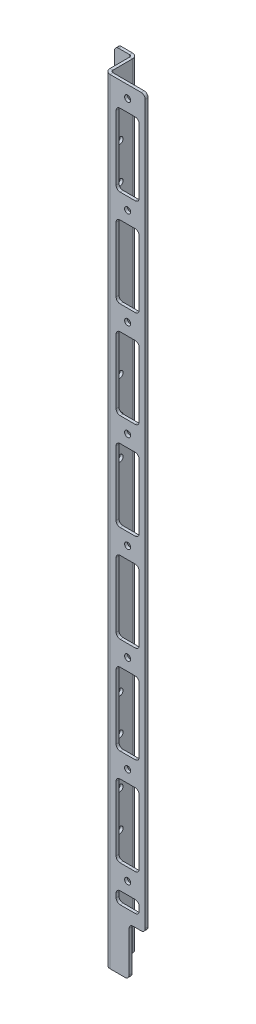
ISO-10303-21;
HEADER;
FILE_DESCRIPTION(('STEP AP214'),'2;1');
FILE_NAME('part.step','',(''),(''),'','','');
FILE_SCHEMA(('AUTOMOTIVE_DESIGN { 1 0 10303 214 1 1 1 1 }'));
ENDSEC;
DATA;
#1=APPLICATION_CONTEXT('core data for automotive mechanical design processes');
#2=APPLICATION_PROTOCOL_DEFINITION('international standard','automotive_design',2000,#1);
#3=PRODUCT_CONTEXT('',#1,'mechanical');
#4=PRODUCT('Part','Part','',(#3));
#5=PRODUCT_RELATED_PRODUCT_CATEGORY('part','',(#4));
#6=PRODUCT_DEFINITION_FORMATION('','',#4);
#7=PRODUCT_DEFINITION_CONTEXT('part definition',#1,'design');
#8=PRODUCT_DEFINITION('design','',#6,#7);
#9=PRODUCT_DEFINITION_SHAPE('','',#8);
#10=(LENGTH_UNIT() NAMED_UNIT(*) SI_UNIT(.MILLI.,.METRE.));
#11=(NAMED_UNIT(*) PLANE_ANGLE_UNIT() SI_UNIT($,.RADIAN.));
#12=(NAMED_UNIT(*) SI_UNIT($,.STERADIAN.) SOLID_ANGLE_UNIT());
#13=UNCERTAINTY_MEASURE_WITH_UNIT(LENGTH_MEASURE(1.E-05),#10,'distance_accuracy_value','');
#14=(GEOMETRIC_REPRESENTATION_CONTEXT(3) GLOBAL_UNCERTAINTY_ASSIGNED_CONTEXT((#13)) GLOBAL_UNIT_ASSIGNED_CONTEXT((#10,
#11,#12)) REPRESENTATION_CONTEXT('',''));
#15=CARTESIAN_POINT('',(0.,0.,0.));
#16=DIRECTION('',(0.,0.,1.));
#17=DIRECTION('',(1.,0.,0.));
#18=AXIS2_PLACEMENT_3D('',#15,#16,#17);
#19=CARTESIAN_POINT('',(-27.2034,0.,3.8099999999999));
#20=DIRECTION('',(1.,0.,0.));
#21=DIRECTION('',(0.,0.,1.));
#22=AXIS2_PLACEMENT_3D('',#19,#20,#21);
#23=PLANE('',#22);
#24=DIRECTION('',(0.,-1.,0.));
#25=VECTOR('',#24,1.);
#26=CARTESIAN_POINT('',(-27.2034,0.,3.8099999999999));
#27=LINE('',#26,#25);
#28=CARTESIAN_POINT('',(-27.2034,1212.85,3.8099999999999));
#29=VERTEX_POINT('',#28);
#30=CARTESIAN_POINT('',(-27.2034,50.8,3.80999999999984));
#31=VERTEX_POINT('',#30);
#32=EDGE_CURVE('E671',#29,#31,#27,.T.);
#33=ORIENTED_EDGE('',*,*,#32,.T.);
#34=DIRECTION('',(0.,0.,1.));
#35=VECTOR('',#34,1.);
#36=CARTESIAN_POINT('',(-27.2034,50.8,3.80999999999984));
#37=LINE('',#36,#35);
#38=CARTESIAN_POINT('',(-27.2034,50.8,8.35659999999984));
#39=VERTEX_POINT('',#38);
#40=EDGE_CURVE('E663',#31,#39,#37,.T.);
#41=ORIENTED_EDGE('',*,*,#40,.T.);
#42=DIRECTION('',(0.,1.,0.));
#43=VECTOR('',#42,1.);
#44=CARTESIAN_POINT('',(-27.2034,0.,8.3565999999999));
#45=LINE('',#44,#43);
#46=CARTESIAN_POINT('',(-27.2034,1212.85,8.3565999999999));
#47=VERTEX_POINT('',#46);
#48=EDGE_CURVE('E680',#47,#39,#45,.F.);
#49=ORIENTED_EDGE('',*,*,#48,.F.);
#50=DIRECTION('',(0.,0.,1.));
#51=VECTOR('',#50,1.);
#52=CARTESIAN_POINT('',(-27.2034,1212.85,3.8099999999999));
#53=LINE('',#52,#51);
#54=EDGE_CURVE('E1447',#29,#47,#53,.T.);
#55=ORIENTED_EDGE('',*,*,#54,.F.);
#56=EDGE_LOOP('',(#33,#41,#49,#55));
#57=FACE_BOUND('',#56,.T.);
#58=ADVANCED_FACE('F45',(#57),#23,.F.);
#59=CARTESIAN_POINT('',(0.,1219.2,0.));
#60=DIRECTION('',(-1.,0.,0.));
#61=DIRECTION('',(0.,0.,-1.));
#62=AXIS2_PLACEMENT_3D('',#59,#60,#61);
#63=PLANE('',#62);
#64=CARTESIAN_POINT('',(0.,741.680000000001,31.75));
#65=DIRECTION('',(-1.,0.,0.));
#66=DIRECTION('',(0.,0.,1.));
#67=AXIS2_PLACEMENT_3D('',#64,#65,#66);
#68=CIRCLE('',#67,5.10540000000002);
#69=CARTESIAN_POINT('',(0.,741.680000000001,36.8554));
#70=VERTEX_POINT('',#69);
#71=EDGE_CURVE('E1044',#70,#70,#68,.T.);
#72=ORIENTED_EDGE('',*,*,#71,.F.);
#73=EDGE_LOOP('',(#72));
#74=FACE_BOUND('',#73,.T.);
#75=CARTESIAN_POINT('',(0.,798.830000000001,31.75));
#76=DIRECTION('',(-1.,0.,0.));
#77=DIRECTION('',(0.,0.,1.));
#78=AXIS2_PLACEMENT_3D('',#75,#76,#77);
#79=CIRCLE('',#78,5.10540000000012);
#80=CARTESIAN_POINT('',(0.,798.830000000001,36.8554000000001));
#81=VERTEX_POINT('',#80);
#82=EDGE_CURVE('E1393',#81,#81,#79,.T.);
#83=ORIENTED_EDGE('',*,*,#82,.F.);
#84=EDGE_LOOP('',(#83));
#85=FACE_BOUND('',#84,.T.);
#86=CARTESIAN_POINT('',(0.,308.610000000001,31.75));
#87=DIRECTION('',(-1.,0.,0.));
#88=DIRECTION('',(0.,0.,1.));
#89=AXIS2_PLACEMENT_3D('',#86,#87,#88);
#90=CIRCLE('',#89,5.10540000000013);
#91=CARTESIAN_POINT('',(0.,308.610000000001,36.8554000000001));
#92=VERTEX_POINT('',#91);
#93=EDGE_CURVE('E1387',#92,#92,#90,.T.);
#94=ORIENTED_EDGE('',*,*,#93,.F.);
#95=EDGE_LOOP('',(#94));
#96=FACE_BOUND('',#95,.T.);
#97=CARTESIAN_POINT('',(0.,365.760000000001,31.75));
#98=DIRECTION('',(-1.,0.,0.));
#99=DIRECTION('',(0.,0.,1.));
#100=AXIS2_PLACEMENT_3D('',#97,#98,#99);
#101=CIRCLE('',#100,5.10540000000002);
#102=CARTESIAN_POINT('',(0.,365.760000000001,36.8554));
#103=VERTEX_POINT('',#102);
#104=EDGE_CURVE('E1383',#103,#103,#101,.T.);
#105=ORIENTED_EDGE('',*,*,#104,.F.);
#106=EDGE_LOOP('',(#105));
#107=FACE_BOUND('',#106,.T.);
#108=CARTESIAN_POINT('',(0.,234.950000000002,31.75));
#109=DIRECTION('',(-1.,0.,0.));
#110=DIRECTION('',(0.,0.,1.));
#111=AXIS2_PLACEMENT_3D('',#108,#109,#110);
#112=CIRCLE('',#111,5.10540000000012);
#113=CARTESIAN_POINT('',(0.,234.950000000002,36.8554000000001));
#114=VERTEX_POINT('',#113);
#115=EDGE_CURVE('E1386',#114,#114,#112,.T.);
#116=ORIENTED_EDGE('',*,*,#115,.F.);
#117=EDGE_LOOP('',(#116));
#118=FACE_BOUND('',#117,.T.);
#119=CARTESIAN_POINT('',(0.,177.800000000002,31.75));
#120=DIRECTION('',(-1.,0.,0.));
#121=DIRECTION('',(0.,0.,1.));
#122=AXIS2_PLACEMENT_3D('',#119,#120,#121);
#123=CIRCLE('',#122,5.10540000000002);
#124=CARTESIAN_POINT('',(0.,177.800000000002,36.8554));
#125=VERTEX_POINT('',#124);
#126=EDGE_CURVE('E1411',#125,#125,#123,.T.);
#127=ORIENTED_EDGE('',*,*,#126,.F.);
#128=EDGE_LOOP('',(#127));
#129=FACE_BOUND('',#128,.T.);
#130=CARTESIAN_POINT('',(0.,120.650000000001,31.75));
#131=DIRECTION('',(-1.,0.,0.));
#132=DIRECTION('',(0.,0.,1.));
#133=AXIS2_PLACEMENT_3D('',#130,#131,#132);
#134=CIRCLE('',#133,5.10540000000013);
#135=CARTESIAN_POINT('',(0.,120.650000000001,36.8554000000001));
#136=VERTEX_POINT('',#135);
#137=EDGE_CURVE('E1408',#136,#136,#134,.T.);
#138=ORIENTED_EDGE('',*,*,#137,.F.);
#139=EDGE_LOOP('',(#138));
#140=FACE_BOUND('',#139,.T.);
#141=CARTESIAN_POINT('',(0.,422.910000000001,31.75));
#142=DIRECTION('',(-1.,0.,0.));
#143=DIRECTION('',(0.,0.,1.));
#144=AXIS2_PLACEMENT_3D('',#141,#142,#143);
#145=CIRCLE('',#144,5.10540000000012);
#146=CARTESIAN_POINT('',(0.,422.910000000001,36.8554000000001));
#147=VERTEX_POINT('',#146);
#148=EDGE_CURVE('E1377',#147,#147,#145,.T.);
#149=ORIENTED_EDGE('',*,*,#148,.F.);
#150=EDGE_LOOP('',(#149));
#151=FACE_BOUND('',#150,.T.);
#152=CARTESIAN_POINT('',(0.,684.530000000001,31.75));
#153=DIRECTION('',(-1.,0.,0.));
#154=DIRECTION('',(0.,0.,1.));
#155=AXIS2_PLACEMENT_3D('',#152,#153,#154);
#156=CIRCLE('',#155,5.10540000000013);
#157=CARTESIAN_POINT('',(0.,684.530000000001,36.8554000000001));
#158=VERTEX_POINT('',#157);
#159=EDGE_CURVE('E1371',#158,#158,#156,.T.);
#160=ORIENTED_EDGE('',*,*,#159,.F.);
#161=EDGE_LOOP('',(#160));
#162=FACE_BOUND('',#161,.T.);
#163=CARTESIAN_POINT('',(0.,1060.45,31.75));
#164=DIRECTION('',(-1.,0.,0.));
#165=DIRECTION('',(0.,0.,1.));
#166=AXIS2_PLACEMENT_3D('',#163,#164,#165);
#167=CIRCLE('',#166,5.10540000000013);
#168=CARTESIAN_POINT('',(0.,1060.45,36.8554000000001));
#169=VERTEX_POINT('',#168);
#170=EDGE_CURVE('E1362',#169,#169,#167,.T.);
#171=ORIENTED_EDGE('',*,*,#170,.F.);
#172=EDGE_LOOP('',(#171));
#173=FACE_BOUND('',#172,.T.);
#174=CARTESIAN_POINT('',(0.,1117.6,31.75));
#175=DIRECTION('',(-1.,0.,0.));
#176=DIRECTION('',(0.,0.,1.));
#177=AXIS2_PLACEMENT_3D('',#174,#175,#176);
#178=CIRCLE('',#177,5.10540000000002);
#179=CARTESIAN_POINT('',(0.,1117.6,36.8554));
#180=VERTEX_POINT('',#179);
#181=EDGE_CURVE('E1356',#180,#180,#178,.T.);
#182=ORIENTED_EDGE('',*,*,#181,.F.);
#183=EDGE_LOOP('',(#182));
#184=FACE_BOUND('',#183,.T.);
#185=CARTESIAN_POINT('',(0.,1174.75,31.75));
#186=DIRECTION('',(-1.,0.,0.));
#187=DIRECTION('',(0.,0.,1.));
#188=AXIS2_PLACEMENT_3D('',#185,#186,#187);
#189=CIRCLE('',#188,5.10540000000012);
#190=CARTESIAN_POINT('',(0.,1174.75,36.8554000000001));
#191=VERTEX_POINT('',#190);
#192=EDGE_CURVE('E1075',#191,#191,#189,.T.);
#193=ORIENTED_EDGE('',*,*,#192,.F.);
#194=EDGE_LOOP('',(#193));
#195=FACE_BOUND('',#194,.T.);
#196=DIRECTION('',(0.,0.,1.));
#197=VECTOR('',#196,1.);
#198=CARTESIAN_POINT('',(0.,0.,0.));
#199=LINE('',#198,#197);
#200=CARTESIAN_POINT('',(0.,0.,11.938));
#201=VERTEX_POINT('',#200);
#202=CARTESIAN_POINT('',(0.,0.,42.672));
#203=VERTEX_POINT('',#202);
#204=EDGE_CURVE('E1030',#201,#203,#199,.T.);
#205=ORIENTED_EDGE('',*,*,#204,.T.);
#206=DIRECTION('',(0.,-1.,0.));
#207=VECTOR('',#206,1.);
#208=CARTESIAN_POINT('',(0.,1219.2,42.672));
#209=LINE('',#208,#207);
#210=CARTESIAN_POINT('',(0.,1219.2,42.672));
#211=VERTEX_POINT('',#210);
#212=EDGE_CURVE('E1045',#211,#203,#209,.T.);
#213=ORIENTED_EDGE('',*,*,#212,.F.);
#214=DIRECTION('',(0.,0.,1.));
#215=VECTOR('',#214,1.);
#216=CARTESIAN_POINT('',(0.,1219.2,0.));
#217=LINE('',#216,#215);
#218=CARTESIAN_POINT('',(0.,1219.2,11.938));
#219=VERTEX_POINT('',#218);
#220=EDGE_CURVE('E1049',#219,#211,#217,.T.);
#221=ORIENTED_EDGE('',*,*,#220,.F.);
#222=DIRECTION('',(0.,1.,0.));
#223=VECTOR('',#222,1.);
#224=CARTESIAN_POINT('',(0.,1219.2,11.938));
#225=LINE('',#224,#223);
#226=EDGE_CURVE('E710',#219,#201,#225,.F.);
#227=ORIENTED_EDGE('',*,*,#226,.T.);
#228=EDGE_LOOP('',(#205,#213,#221,#227));
#229=FACE_BOUND('',#228,.T.);
#230=ADVANCED_FACE('F1555',(#74,#85,#96,#107,#118,#129,#140,#151,#162,#173,#184,#195,#229),#63,.T.);
#231=CARTESIAN_POINT('',(4.5466,1219.2,0.));
#232=DIRECTION('',(-1.,0.,0.));
#233=DIRECTION('',(0.,0.,-1.));
#234=AXIS2_PLACEMENT_3D('',#231,#232,#233);
#235=PLANE('',#234);
#236=CARTESIAN_POINT('',(4.5466,1174.75,31.75));
#237=DIRECTION('',(-1.,0.,0.));
#238=DIRECTION('',(0.,0.,1.));
#239=AXIS2_PLACEMENT_3D('',#236,#237,#238);
#240=CIRCLE('',#239,5.10540000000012);
#241=CARTESIAN_POINT('',(4.5466,1174.75,36.8554000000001));
#242=VERTEX_POINT('',#241);
#243=EDGE_CURVE('E1324',#242,#242,#240,.T.);
#244=ORIENTED_EDGE('',*,*,#243,.T.);
#245=EDGE_LOOP('',(#244));
#246=FACE_BOUND('',#245,.T.);
#247=CARTESIAN_POINT('',(4.5466,1117.6,31.75));
#248=DIRECTION('',(-1.,0.,0.));
#249=DIRECTION('',(0.,0.,1.));
#250=AXIS2_PLACEMENT_3D('',#247,#248,#249);
#251=CIRCLE('',#250,5.10540000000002);
#252=CARTESIAN_POINT('',(4.5466,1117.6,36.8554));
#253=VERTEX_POINT('',#252);
#254=EDGE_CURVE('E1359',#253,#253,#251,.T.);
#255=ORIENTED_EDGE('',*,*,#254,.T.);
#256=EDGE_LOOP('',(#255));
#257=FACE_BOUND('',#256,.T.);
#258=CARTESIAN_POINT('',(4.5466,1060.45,31.75));
#259=DIRECTION('',(-1.,0.,0.));
#260=DIRECTION('',(0.,0.,1.));
#261=AXIS2_PLACEMENT_3D('',#258,#259,#260);
#262=CIRCLE('',#261,5.10540000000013);
#263=CARTESIAN_POINT('',(4.5466,1060.45,36.8554000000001));
#264=VERTEX_POINT('',#263);
#265=EDGE_CURVE('E1365',#264,#264,#262,.T.);
#266=ORIENTED_EDGE('',*,*,#265,.T.);
#267=EDGE_LOOP('',(#266));
#268=FACE_BOUND('',#267,.T.);
#269=CARTESIAN_POINT('',(4.5466,684.530000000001,31.75));
#270=DIRECTION('',(-1.,0.,0.));
#271=DIRECTION('',(0.,0.,1.));
#272=AXIS2_PLACEMENT_3D('',#269,#270,#271);
#273=CIRCLE('',#272,5.10540000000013);
#274=CARTESIAN_POINT('',(4.5466,684.530000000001,36.8554000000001));
#275=VERTEX_POINT('',#274);
#276=EDGE_CURVE('E1368',#275,#275,#273,.T.);
#277=ORIENTED_EDGE('',*,*,#276,.T.);
#278=EDGE_LOOP('',(#277));
#279=FACE_BOUND('',#278,.T.);
#280=CARTESIAN_POINT('',(4.5466,422.910000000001,31.75));
#281=DIRECTION('',(-1.,0.,0.));
#282=DIRECTION('',(0.,0.,1.));
#283=AXIS2_PLACEMENT_3D('',#280,#281,#282);
#284=CIRCLE('',#283,5.10540000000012);
#285=CARTESIAN_POINT('',(4.5466,422.910000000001,36.8554000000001));
#286=VERTEX_POINT('',#285);
#287=EDGE_CURVE('E1374',#286,#286,#284,.T.);
#288=ORIENTED_EDGE('',*,*,#287,.T.);
#289=EDGE_LOOP('',(#288));
#290=FACE_BOUND('',#289,.T.);
#291=CARTESIAN_POINT('',(4.5466,120.650000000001,31.75));
#292=DIRECTION('',(-1.,0.,0.));
#293=DIRECTION('',(0.,0.,1.));
#294=AXIS2_PLACEMENT_3D('',#291,#292,#293);
#295=CIRCLE('',#294,5.10540000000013);
#296=CARTESIAN_POINT('',(4.5466,120.650000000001,36.8554000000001));
#297=VERTEX_POINT('',#296);
#298=EDGE_CURVE('E1404',#297,#297,#295,.T.);
#299=ORIENTED_EDGE('',*,*,#298,.T.);
#300=EDGE_LOOP('',(#299));
#301=FACE_BOUND('',#300,.T.);
#302=CARTESIAN_POINT('',(4.5466,177.800000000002,31.75));
#303=DIRECTION('',(-1.,0.,0.));
#304=DIRECTION('',(0.,0.,1.));
#305=AXIS2_PLACEMENT_3D('',#302,#303,#304);
#306=CIRCLE('',#305,5.10540000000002);
#307=CARTESIAN_POINT('',(4.5466,177.800000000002,36.8554));
#308=VERTEX_POINT('',#307);
#309=EDGE_CURVE('E1407',#308,#308,#306,.T.);
#310=ORIENTED_EDGE('',*,*,#309,.T.);
#311=EDGE_LOOP('',(#310));
#312=FACE_BOUND('',#311,.T.);
#313=CARTESIAN_POINT('',(4.5466,234.950000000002,31.75));
#314=DIRECTION('',(-1.,0.,0.));
#315=DIRECTION('',(0.,0.,1.));
#316=AXIS2_PLACEMENT_3D('',#313,#314,#315);
#317=CIRCLE('',#316,5.10540000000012);
#318=CARTESIAN_POINT('',(4.5466,234.950000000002,36.8554000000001));
#319=VERTEX_POINT('',#318);
#320=EDGE_CURVE('E1382',#319,#319,#317,.T.);
#321=ORIENTED_EDGE('',*,*,#320,.T.);
#322=EDGE_LOOP('',(#321));
#323=FACE_BOUND('',#322,.T.);
#324=CARTESIAN_POINT('',(4.5466,365.760000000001,31.75));
#325=DIRECTION('',(-1.,0.,0.));
#326=DIRECTION('',(0.,0.,1.));
#327=AXIS2_PLACEMENT_3D('',#324,#325,#326);
#328=CIRCLE('',#327,5.10540000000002);
#329=CARTESIAN_POINT('',(4.5466,365.760000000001,36.8554));
#330=VERTEX_POINT('',#329);
#331=EDGE_CURVE('E1378',#330,#330,#328,.T.);
#332=ORIENTED_EDGE('',*,*,#331,.T.);
#333=EDGE_LOOP('',(#332));
#334=FACE_BOUND('',#333,.T.);
#335=CARTESIAN_POINT('',(4.5466,308.610000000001,31.75));
#336=DIRECTION('',(-1.,0.,0.));
#337=DIRECTION('',(0.,0.,1.));
#338=AXIS2_PLACEMENT_3D('',#335,#336,#337);
#339=CIRCLE('',#338,5.10540000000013);
#340=CARTESIAN_POINT('',(4.5466,308.610000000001,36.8554000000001));
#341=VERTEX_POINT('',#340);
#342=EDGE_CURVE('E1381',#341,#341,#339,.T.);
#343=ORIENTED_EDGE('',*,*,#342,.T.);
#344=EDGE_LOOP('',(#343));
#345=FACE_BOUND('',#344,.T.);
#346=CARTESIAN_POINT('',(4.5466,798.830000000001,31.75));
#347=DIRECTION('',(-1.,0.,0.));
#348=DIRECTION('',(0.,0.,1.));
#349=AXIS2_PLACEMENT_3D('',#346,#347,#348);
#350=CIRCLE('',#349,5.10540000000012);
#351=CARTESIAN_POINT('',(4.5466,798.830000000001,36.8554000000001));
#352=VERTEX_POINT('',#351);
#353=EDGE_CURVE('E1390',#352,#352,#350,.T.);
#354=ORIENTED_EDGE('',*,*,#353,.T.);
#355=EDGE_LOOP('',(#354));
#356=FACE_BOUND('',#355,.T.);
#357=CARTESIAN_POINT('',(4.5466,741.680000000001,31.75));
#358=DIRECTION('',(-1.,0.,0.));
#359=DIRECTION('',(0.,0.,1.));
#360=AXIS2_PLACEMENT_3D('',#357,#358,#359);
#361=CIRCLE('',#360,5.10540000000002);
#362=CARTESIAN_POINT('',(4.5466,741.680000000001,36.8554));
#363=VERTEX_POINT('',#362);
#364=EDGE_CURVE('E1396',#363,#363,#361,.T.);
#365=ORIENTED_EDGE('',*,*,#364,.T.);
#366=EDGE_LOOP('',(#365));
#367=FACE_BOUND('',#366,.T.);
#368=DIRECTION('',(0.,1.,0.));
#369=VECTOR('',#368,1.);
#370=CARTESIAN_POINT('',(4.54660000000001,1219.2,11.938));
#371=LINE('',#370,#369);
#372=CARTESIAN_POINT('',(4.54660000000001,1219.2,11.938));
#373=VERTEX_POINT('',#372);
#374=CARTESIAN_POINT('',(4.5466,0.,11.938));
#375=VERTEX_POINT('',#374);
#376=EDGE_CURVE('E698',#373,#375,#371,.F.);
#377=ORIENTED_EDGE('',*,*,#376,.F.);
#378=DIRECTION('',(0.,0.,1.));
#379=VECTOR('',#378,1.);
#380=CARTESIAN_POINT('',(4.5466,1219.2,0.));
#381=LINE('',#380,#379);
#382=CARTESIAN_POINT('',(4.5466,1219.2,42.672));
#383=VERTEX_POINT('',#382);
#384=EDGE_CURVE('E1025',#373,#383,#381,.T.);
#385=ORIENTED_EDGE('',*,*,#384,.T.);
#386=DIRECTION('',(0.,-1.,0.));
#387=VECTOR('',#386,1.);
#388=CARTESIAN_POINT('',(4.5466,1219.2,42.672));
#389=LINE('',#388,#387);
#390=CARTESIAN_POINT('',(4.5466,0.,42.672));
#391=VERTEX_POINT('',#390);
#392=EDGE_CURVE('E1050',#383,#391,#389,.T.);
#393=ORIENTED_EDGE('',*,*,#392,.T.);
#394=DIRECTION('',(0.,0.,1.));
#395=VECTOR('',#394,1.);
#396=CARTESIAN_POINT('',(4.5466,0.,0.));
#397=LINE('',#396,#395);
#398=EDGE_CURVE('E1048',#375,#391,#397,.T.);
#399=ORIENTED_EDGE('',*,*,#398,.F.);
#400=EDGE_LOOP('',(#377,#385,#393,#399));
#401=FACE_BOUND('',#400,.T.);
#402=ADVANCED_FACE('F1579',(#246,#257,#268,#279,#290,#301,#312,#323,#334,#345,#356,#367,#401),
#235,.F.);
#403=CARTESIAN_POINT('',(8.128,1219.2,42.672));
#404=DIRECTION('',(0.,1.,0.));
#405=DIRECTION('',(1.,0.,0.));
#406=AXIS2_PLACEMENT_3D('',#403,#404,#405);
#407=PLANE('',#406);
#408=ORIENTED_EDGE('',*,*,#220,.T.);
#409=DIRECTION('',(-1.,0.,0.));
#410=VECTOR('',#409,1.);
#411=CARTESIAN_POINT('',(4.5466,1219.2,42.672));
#412=LINE('',#411,#410);
#413=EDGE_CURVE('E1021',#383,#211,#412,.T.);
#414=ORIENTED_EDGE('',*,*,#413,.F.);
#415=ORIENTED_EDGE('',*,*,#384,.F.);
#416=DIRECTION('',(1.,0.,0.));
#417=VECTOR('',#416,1.);
#418=CARTESIAN_POINT('',(0.,1219.2,11.938));
#419=LINE('',#418,#417);
#420=EDGE_CURVE('E705',#219,#373,#419,.T.);
#421=ORIENTED_EDGE('',*,*,#420,.F.);
#422=EDGE_LOOP('',(#408,#414,#415,#421));
#423=FACE_BOUND('',#422,.T.);
#424=ADVANCED_FACE('F1548',(#423),#407,.T.);
#425=CARTESIAN_POINT('',(0.,1219.2,46.2534));
#426=DIRECTION('',(0.,0.,1.));
#427=DIRECTION('',(-1.,0.,0.));
#428=AXIS2_PLACEMENT_3D('',#425,#426,#427);
#429=PLANE('',#428);
#430=CARTESIAN_POINT('',(35.814,133.35,46.2534));
#431=DIRECTION('',(0.,0.,-1.));
#432=DIRECTION('',(-1.,0.,0.));
#433=AXIS2_PLACEMENT_3D('',#430,#431,#432);
#434=CIRCLE('',#433,4.76250000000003);
#435=CARTESIAN_POINT('',(31.0515,133.35,46.2534));
#436=VERTEX_POINT('',#435);
#437=EDGE_CURVE('E720',#436,#436,#434,.F.);
#438=ORIENTED_EDGE('',*,*,#437,.T.);
#439=EDGE_LOOP('',(#438));
#440=FACE_BOUND('',#439,.T.);
#441=CARTESIAN_POINT('',(35.814,285.75,46.2534));
#442=DIRECTION('',(0.,0.,-1.));
#443=DIRECTION('',(-1.,0.,0.));
#444=AXIS2_PLACEMENT_3D('',#441,#442,#443);
#445=CIRCLE('',#444,4.76250000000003);
#446=CARTESIAN_POINT('',(31.0515,285.75,46.2534));
#447=VERTEX_POINT('',#446);
#448=EDGE_CURVE('E728',#447,#447,#445,.F.);
#449=ORIENTED_EDGE('',*,*,#448,.T.);
#450=EDGE_LOOP('',(#449));
#451=FACE_BOUND('',#450,.T.);
#452=CARTESIAN_POINT('',(35.814,438.15,46.2534));
#453=DIRECTION('',(0.,0.,-1.));
#454=DIRECTION('',(-1.,0.,0.));
#455=AXIS2_PLACEMENT_3D('',#452,#453,#454);
#456=CIRCLE('',#455,4.76250000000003);
#457=CARTESIAN_POINT('',(31.0515,438.15,46.2534));
#458=VERTEX_POINT('',#457);
#459=EDGE_CURVE('E734',#458,#458,#456,.F.);
#460=ORIENTED_EDGE('',*,*,#459,.T.);
#461=EDGE_LOOP('',(#460));
#462=FACE_BOUND('',#461,.T.);
#463=CARTESIAN_POINT('',(35.814,590.55,46.2534));
#464=DIRECTION('',(0.,0.,-1.));
#465=DIRECTION('',(-1.,0.,0.));
#466=AXIS2_PLACEMENT_3D('',#463,#464,#465);
#467=CIRCLE('',#466,4.76250000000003);
#468=CARTESIAN_POINT('',(31.0515,590.55,46.2534));
#469=VERTEX_POINT('',#468);
#470=EDGE_CURVE('E740',#469,#469,#467,.F.);
#471=ORIENTED_EDGE('',*,*,#470,.T.);
#472=EDGE_LOOP('',(#471));
#473=FACE_BOUND('',#472,.T.);
#474=CARTESIAN_POINT('',(35.814,742.95,46.2534));
#475=DIRECTION('',(0.,0.,-1.));
#476=DIRECTION('',(-1.,0.,0.));
#477=AXIS2_PLACEMENT_3D('',#474,#475,#476);
#478=CIRCLE('',#477,4.76250000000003);
#479=CARTESIAN_POINT('',(31.0515,742.95,46.2534));
#480=VERTEX_POINT('',#479);
#481=EDGE_CURVE('E746',#480,#480,#478,.F.);
#482=ORIENTED_EDGE('',*,*,#481,.T.);
#483=EDGE_LOOP('',(#482));
#484=FACE_BOUND('',#483,.T.);
#485=CARTESIAN_POINT('',(35.814,895.35,46.2534));
#486=DIRECTION('',(0.,0.,-1.));
#487=DIRECTION('',(-1.,0.,0.));
#488=AXIS2_PLACEMENT_3D('',#485,#486,#487);
#489=CIRCLE('',#488,4.76250000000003);
#490=CARTESIAN_POINT('',(31.0515,895.35,46.2534));
#491=VERTEX_POINT('',#490);
#492=EDGE_CURVE('E752',#491,#491,#489,.F.);
#493=ORIENTED_EDGE('',*,*,#492,.T.);
#494=EDGE_LOOP('',(#493));
#495=FACE_BOUND('',#494,.T.);
#496=CARTESIAN_POINT('',(24.003,101.6,46.2534));
#497=DIRECTION('',(0.,0.,-1.));
#498=DIRECTION('',(-1.,0.,0.));
#499=AXIS2_PLACEMENT_3D('',#496,#497,#498);
#500=CIRCLE('',#499,6.35000000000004);
#501=CARTESIAN_POINT('',(17.653,101.6,46.2534));
#502=VERTEX_POINT('',#501);
#503=CARTESIAN_POINT('',(24.003,95.2499999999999,46.2534));
#504=VERTEX_POINT('',#503);
#505=EDGE_CURVE('E788',#502,#504,#500,.F.);
#506=ORIENTED_EDGE('',*,*,#505,.T.);
#507=DIRECTION('',(1.,0.,0.));
#508=VECTOR('',#507,1.);
#509=CARTESIAN_POINT('',(47.625,95.2499999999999,46.2534));
#510=LINE('',#509,#508);
#511=CARTESIAN_POINT('',(47.625,95.2499999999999,46.2534));
#512=VERTEX_POINT('',#511);
#513=EDGE_CURVE('E781',#504,#512,#510,.T.);
#514=ORIENTED_EDGE('',*,*,#513,.T.);
#515=CARTESIAN_POINT('',(47.625,101.6,46.2534));
#516=DIRECTION('',(0.,0.,-1.));
#517=DIRECTION('',(-1.,0.,0.));
#518=AXIS2_PLACEMENT_3D('',#515,#516,#517);
#519=CIRCLE('',#518,6.35000000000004);
#520=CARTESIAN_POINT('',(53.975,101.6,46.2534));
#521=VERTEX_POINT('',#520);
#522=EDGE_CURVE('E777',#512,#521,#519,.F.);
#523=ORIENTED_EDGE('',*,*,#522,.T.);
#524=DIRECTION('',(0.,1.,0.));
#525=VECTOR('',#524,1.);
#526=CARTESIAN_POINT('',(53.975,107.95,46.2534));
#527=LINE('',#526,#525);
#528=CARTESIAN_POINT('',(53.975,107.95,46.2534));
#529=VERTEX_POINT('',#528);
#530=EDGE_CURVE('E773',#521,#529,#527,.T.);
#531=ORIENTED_EDGE('',*,*,#530,.T.);
#532=CARTESIAN_POINT('',(47.625,107.95,46.2534));
#533=DIRECTION('',(0.,0.,-1.));
#534=DIRECTION('',(-1.,0.,0.));
#535=AXIS2_PLACEMENT_3D('',#532,#533,#534);
#536=CIRCLE('',#535,6.35000000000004);
#537=CARTESIAN_POINT('',(47.625,114.3,46.2534));
#538=VERTEX_POINT('',#537);
#539=EDGE_CURVE('E769',#529,#538,#536,.F.);
#540=ORIENTED_EDGE('',*,*,#539,.T.);
#541=DIRECTION('',(-1.,0.,0.));
#542=VECTOR('',#541,1.);
#543=CARTESIAN_POINT('',(47.625,114.3,46.2534));
#544=LINE('',#543,#542);
#545=CARTESIAN_POINT('',(24.003,114.3,46.2534));
#546=VERTEX_POINT('',#545);
#547=EDGE_CURVE('E765',#538,#546,#544,.T.);
#548=ORIENTED_EDGE('',*,*,#547,.T.);
#549=CARTESIAN_POINT('',(24.003,107.95,46.2534));
#550=DIRECTION('',(0.,0.,-1.));
#551=DIRECTION('',(-1.,0.,0.));
#552=AXIS2_PLACEMENT_3D('',#549,#550,#551);
#553=CIRCLE('',#552,6.35000000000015);
#554=CARTESIAN_POINT('',(17.653,107.95,46.2534));
#555=VERTEX_POINT('',#554);
#556=EDGE_CURVE('E761',#546,#555,#553,.F.);
#557=ORIENTED_EDGE('',*,*,#556,.T.);
#558=DIRECTION('',(0.,-1.,0.));
#559=VECTOR('',#558,1.);
#560=CARTESIAN_POINT('',(17.653,107.95,46.2534));
#561=LINE('',#560,#559);
#562=EDGE_CURVE('E755',#555,#502,#561,.T.);
#563=ORIENTED_EDGE('',*,*,#562,.T.);
#564=EDGE_LOOP('',(#506,#514,#523,#531,#540,#548,#557,#563));
#565=FACE_BOUND('',#564,.T.);
#566=CARTESIAN_POINT('',(35.814,1200.15,46.2534));
#567=DIRECTION('',(0.,0.,-1.));
#568=DIRECTION('',(-1.,0.,0.));
#569=AXIS2_PLACEMENT_3D('',#566,#567,#568);
#570=CIRCLE('',#569,4.76250000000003);
#571=CARTESIAN_POINT('',(31.0515,1200.15,46.2534));
#572=VERTEX_POINT('',#571);
#573=EDGE_CURVE('E1091',#572,#572,#570,.F.);
#574=ORIENTED_EDGE('',*,*,#573,.T.);
#575=EDGE_LOOP('',(#574));
#576=FACE_BOUND('',#575,.T.);
#577=CARTESIAN_POINT('',(35.814,1047.75,46.2534));
#578=DIRECTION('',(0.,0.,-1.));
#579=DIRECTION('',(-1.,0.,0.));
#580=AXIS2_PLACEMENT_3D('',#577,#578,#579);
#581=CIRCLE('',#580,4.76250000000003);
#582=CARTESIAN_POINT('',(31.0515,1047.75,46.2534));
#583=VERTEX_POINT('',#582);
#584=EDGE_CURVE('E1173',#583,#583,#581,.F.);
#585=ORIENTED_EDGE('',*,*,#584,.T.);
#586=EDGE_LOOP('',(#585));
#587=FACE_BOUND('',#586,.T.);
#588=DIRECTION('',(0.,1.,0.));
#589=VECTOR('',#588,1.);
#590=CARTESIAN_POINT('',(53.975,1174.75,46.2534));
#591=LINE('',#590,#589);
#592=CARTESIAN_POINT('',(53.975,1073.15,46.2534));
#593=VERTEX_POINT('',#592);
#594=CARTESIAN_POINT('',(53.975,1174.75,46.2534));
#595=VERTEX_POINT('',#594);
#596=EDGE_CURVE('E1094',#593,#595,#591,.T.);
#597=ORIENTED_EDGE('',*,*,#596,.T.);
#598=CARTESIAN_POINT('',(47.625,1174.75,46.2534));
#599=DIRECTION('',(0.,0.,-1.));
#600=DIRECTION('',(-1.,0.,0.));
#601=AXIS2_PLACEMENT_3D('',#598,#599,#600);
#602=CIRCLE('',#601,6.35000000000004);
#603=CARTESIAN_POINT('',(47.625,1181.1,46.2534));
#604=VERTEX_POINT('',#603);
#605=EDGE_CURVE('E1110',#595,#604,#602,.F.);
#606=ORIENTED_EDGE('',*,*,#605,.T.);
#607=DIRECTION('',(-1.,0.,0.));
#608=VECTOR('',#607,1.);
#609=CARTESIAN_POINT('',(47.625,1181.1,46.2534));
#610=LINE('',#609,#608);
#611=CARTESIAN_POINT('',(24.003,1181.1,46.2534));
#612=VERTEX_POINT('',#611);
#613=EDGE_CURVE('E1106',#604,#612,#610,.T.);
#614=ORIENTED_EDGE('',*,*,#613,.T.);
#615=CARTESIAN_POINT('',(24.003,1174.75,46.2534));
#616=DIRECTION('',(0.,0.,-1.));
#617=DIRECTION('',(-1.,0.,0.));
#618=AXIS2_PLACEMENT_3D('',#615,#616,#617);
#619=CIRCLE('',#618,6.35000000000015);
#620=CARTESIAN_POINT('',(17.653,1174.75,46.2534));
#621=VERTEX_POINT('',#620);
#622=EDGE_CURVE('E1102',#612,#621,#619,.F.);
#623=ORIENTED_EDGE('',*,*,#622,.T.);
#624=DIRECTION('',(0.,-1.,0.));
#625=VECTOR('',#624,1.);
#626=CARTESIAN_POINT('',(17.653,1174.75,46.2534));
#627=LINE('',#626,#625);
#628=CARTESIAN_POINT('',(17.653,1073.15,46.2534));
#629=VERTEX_POINT('',#628);
#630=EDGE_CURVE('E1095',#621,#629,#627,.T.);
#631=ORIENTED_EDGE('',*,*,#630,.T.);
#632=CARTESIAN_POINT('',(24.003,1073.15,46.2534));
#633=DIRECTION('',(0.,0.,-1.));
#634=DIRECTION('',(-1.,0.,0.));
#635=AXIS2_PLACEMENT_3D('',#632,#633,#634);
#636=CIRCLE('',#635,6.35000000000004);
#637=CARTESIAN_POINT('',(24.003,1066.8,46.2534));
#638=VERTEX_POINT('',#637);
#639=EDGE_CURVE('E1188',#629,#638,#636,.F.);
#640=ORIENTED_EDGE('',*,*,#639,.T.);
#641=DIRECTION('',(1.,0.,0.));
#642=VECTOR('',#641,1.);
#643=CARTESIAN_POINT('',(47.6249999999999,1066.8,46.2534));
#644=LINE('',#643,#642);
#645=CARTESIAN_POINT('',(47.6249999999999,1066.8,46.2534));
#646=VERTEX_POINT('',#645);
#647=EDGE_CURVE('E1179',#638,#646,#644,.T.);
#648=ORIENTED_EDGE('',*,*,#647,.T.);
#649=CARTESIAN_POINT('',(47.625,1073.15,46.2534));
#650=DIRECTION('',(0.,0.,-1.));
#651=DIRECTION('',(-1.,0.,0.));
#652=AXIS2_PLACEMENT_3D('',#649,#650,#651);
#653=CIRCLE('',#652,6.35000000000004);
#654=EDGE_CURVE('E1176',#646,#593,#653,.F.);
#655=ORIENTED_EDGE('',*,*,#654,.T.);
#656=EDGE_LOOP('',(#597,#606,#614,#623,#631,#640,#648,#655));
#657=FACE_BOUND('',#656,.T.);
#658=DIRECTION('',(0.,1.,0.));
#659=VECTOR('',#658,1.);
#660=CARTESIAN_POINT('',(53.975,260.35,46.2534));
#661=LINE('',#660,#659);
#662=CARTESIAN_POINT('',(53.975,158.75,46.2534));
#663=VERTEX_POINT('',#662);
#664=CARTESIAN_POINT('',(53.975,260.35,46.2534));
#665=VERTEX_POINT('',#664);
#666=EDGE_CURVE('E837',#663,#665,#661,.T.);
#667=ORIENTED_EDGE('',*,*,#666,.T.);
#668=CARTESIAN_POINT('',(47.625,260.35,46.2534));
#669=DIRECTION('',(0.,0.,-1.));
#670=DIRECTION('',(-1.,0.,0.));
#671=AXIS2_PLACEMENT_3D('',#668,#669,#670);
#672=CIRCLE('',#671,6.35000000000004);
#673=CARTESIAN_POINT('',(47.625,266.7,46.2534));
#674=VERTEX_POINT('',#673);
#675=EDGE_CURVE('E833',#665,#674,#672,.F.);
#676=ORIENTED_EDGE('',*,*,#675,.T.);
#677=DIRECTION('',(-1.,0.,0.));
#678=VECTOR('',#677,1.);
#679=CARTESIAN_POINT('',(47.625,266.7,46.2534));
#680=LINE('',#679,#678);
#681=CARTESIAN_POINT('',(24.003,266.7,46.2534));
#682=VERTEX_POINT('',#681);
#683=EDGE_CURVE('E829',#674,#682,#680,.T.);
#684=ORIENTED_EDGE('',*,*,#683,.T.);
#685=CARTESIAN_POINT('',(24.003,260.35,46.2534));
#686=DIRECTION('',(0.,0.,-1.));
#687=DIRECTION('',(-1.,0.,0.));
#688=AXIS2_PLACEMENT_3D('',#685,#686,#687);
#689=CIRCLE('',#688,6.35000000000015);
#690=CARTESIAN_POINT('',(17.653,260.35,46.2534));
#691=VERTEX_POINT('',#690);
#692=EDGE_CURVE('E825',#682,#691,#689,.F.);
#693=ORIENTED_EDGE('',*,*,#692,.T.);
#694=DIRECTION('',(0.,-1.,0.));
#695=VECTOR('',#694,1.);
#696=CARTESIAN_POINT('',(17.653,260.35,46.2534));
#697=LINE('',#696,#695);
#698=CARTESIAN_POINT('',(17.653,158.75,46.2534));
#699=VERTEX_POINT('',#698);
#700=EDGE_CURVE('E805',#691,#699,#697,.T.);
#701=ORIENTED_EDGE('',*,*,#700,.T.);
#702=CARTESIAN_POINT('',(24.003,158.75,46.2534));
#703=DIRECTION('',(0.,0.,-1.));
#704=DIRECTION('',(-1.,0.,0.));
#705=AXIS2_PLACEMENT_3D('',#702,#703,#704);
#706=CIRCLE('',#705,6.35000000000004);
#707=CARTESIAN_POINT('',(24.003,152.4,46.2534));
#708=VERTEX_POINT('',#707);
#709=EDGE_CURVE('E1213',#699,#708,#706,.F.);
#710=ORIENTED_EDGE('',*,*,#709,.T.);
#711=DIRECTION('',(1.,0.,0.));
#712=VECTOR('',#711,1.);
#713=CARTESIAN_POINT('',(47.6249999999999,152.4,46.2534));
#714=LINE('',#713,#712);
#715=CARTESIAN_POINT('',(47.6249999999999,152.4,46.2534));
#716=VERTEX_POINT('',#715);
#717=EDGE_CURVE('E1204',#708,#716,#714,.T.);
#718=ORIENTED_EDGE('',*,*,#717,.T.);
#719=CARTESIAN_POINT('',(47.625,158.75,46.2534));
#720=DIRECTION('',(0.,0.,-1.));
#721=DIRECTION('',(-1.,0.,0.));
#722=AXIS2_PLACEMENT_3D('',#719,#720,#721);
#723=CIRCLE('',#722,6.35000000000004);
#724=EDGE_CURVE('E1218',#716,#663,#723,.F.);
#725=ORIENTED_EDGE('',*,*,#724,.T.);
#726=EDGE_LOOP('',(#667,#676,#684,#693,#701,#710,#718,#725));
#727=FACE_BOUND('',#726,.T.);
#728=DIRECTION('',(0.,1.,0.));
#729=VECTOR('',#728,1.);
#730=CARTESIAN_POINT('',(53.975,412.75,46.2534));
#731=LINE('',#730,#729);
#732=CARTESIAN_POINT('',(53.975,311.15,46.2534));
#733=VERTEX_POINT('',#732);
#734=CARTESIAN_POINT('',(53.975,412.75,46.2534));
#735=VERTEX_POINT('',#734);
#736=EDGE_CURVE('E876',#733,#735,#731,.T.);
#737=ORIENTED_EDGE('',*,*,#736,.T.);
#738=CARTESIAN_POINT('',(47.625,412.75,46.2534));
#739=DIRECTION('',(0.,0.,-1.));
#740=DIRECTION('',(-1.,0.,0.));
#741=AXIS2_PLACEMENT_3D('',#738,#739,#740);
#742=CIRCLE('',#741,6.35000000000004);
#743=CARTESIAN_POINT('',(47.625,419.1,46.2534));
#744=VERTEX_POINT('',#743);
#745=EDGE_CURVE('E872',#735,#744,#742,.F.);
#746=ORIENTED_EDGE('',*,*,#745,.T.);
#747=DIRECTION('',(-1.,0.,0.));
#748=VECTOR('',#747,1.);
#749=CARTESIAN_POINT('',(47.625,419.1,46.2534));
#750=LINE('',#749,#748);
#751=CARTESIAN_POINT('',(24.003,419.1,46.2534));
#752=VERTEX_POINT('',#751);
#753=EDGE_CURVE('E868',#744,#752,#750,.T.);
#754=ORIENTED_EDGE('',*,*,#753,.T.);
#755=CARTESIAN_POINT('',(24.003,412.75,46.2534));
#756=DIRECTION('',(0.,0.,-1.));
#757=DIRECTION('',(-1.,0.,0.));
#758=AXIS2_PLACEMENT_3D('',#755,#756,#757);
#759=CIRCLE('',#758,6.35000000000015);
#760=CARTESIAN_POINT('',(17.653,412.75,46.2534));
#761=VERTEX_POINT('',#760);
#762=EDGE_CURVE('E864',#752,#761,#759,.F.);
#763=ORIENTED_EDGE('',*,*,#762,.T.);
#764=DIRECTION('',(0.,-1.,0.));
#765=VECTOR('',#764,1.);
#766=CARTESIAN_POINT('',(17.653,412.75,46.2534));
#767=LINE('',#766,#765);
#768=CARTESIAN_POINT('',(17.653,311.15,46.2534));
#769=VERTEX_POINT('',#768);
#770=EDGE_CURVE('E850',#761,#769,#767,.T.);
#771=ORIENTED_EDGE('',*,*,#770,.T.);
#772=CARTESIAN_POINT('',(24.003,311.15,46.2534));
#773=DIRECTION('',(0.,0.,-1.));
#774=DIRECTION('',(-1.,0.,0.));
#775=AXIS2_PLACEMENT_3D('',#772,#773,#774);
#776=CIRCLE('',#775,6.35000000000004);
#777=CARTESIAN_POINT('',(24.003,304.8,46.2534));
#778=VERTEX_POINT('',#777);
#779=EDGE_CURVE('E1240',#769,#778,#776,.F.);
#780=ORIENTED_EDGE('',*,*,#779,.T.);
#781=DIRECTION('',(1.,0.,0.));
#782=VECTOR('',#781,1.);
#783=CARTESIAN_POINT('',(47.6249999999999,304.8,46.2534));
#784=LINE('',#783,#782);
#785=CARTESIAN_POINT('',(47.6249999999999,304.8,46.2534));
#786=VERTEX_POINT('',#785);
#787=EDGE_CURVE('E1231',#778,#786,#784,.T.);
#788=ORIENTED_EDGE('',*,*,#787,.T.);
#789=CARTESIAN_POINT('',(47.625,311.15,46.2534));
#790=DIRECTION('',(0.,0.,-1.));
#791=DIRECTION('',(-1.,0.,0.));
#792=AXIS2_PLACEMENT_3D('',#789,#790,#791);
#793=CIRCLE('',#792,6.35000000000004);
#794=EDGE_CURVE('E1223',#786,#733,#793,.F.);
#795=ORIENTED_EDGE('',*,*,#794,.T.);
#796=EDGE_LOOP('',(#737,#746,#754,#763,#771,#780,#788,#795));
#797=FACE_BOUND('',#796,.T.);
#798=DIRECTION('',(0.,1.,0.));
#799=VECTOR('',#798,1.);
#800=CARTESIAN_POINT('',(53.975,565.15,46.2534));
#801=LINE('',#800,#799);
#802=CARTESIAN_POINT('',(53.975,463.55,46.2534));
#803=VERTEX_POINT('',#802);
#804=CARTESIAN_POINT('',(53.975,565.15,46.2534));
#805=VERTEX_POINT('',#804);
#806=EDGE_CURVE('E915',#803,#805,#801,.T.);
#807=ORIENTED_EDGE('',*,*,#806,.T.);
#808=CARTESIAN_POINT('',(47.625,565.15,46.2534));
#809=DIRECTION('',(0.,0.,-1.));
#810=DIRECTION('',(-1.,0.,0.));
#811=AXIS2_PLACEMENT_3D('',#808,#809,#810);
#812=CIRCLE('',#811,6.35000000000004);
#813=CARTESIAN_POINT('',(47.625,571.5,46.2534));
#814=VERTEX_POINT('',#813);
#815=EDGE_CURVE('E911',#805,#814,#812,.F.);
#816=ORIENTED_EDGE('',*,*,#815,.T.);
#817=DIRECTION('',(-1.,0.,0.));
#818=VECTOR('',#817,1.);
#819=CARTESIAN_POINT('',(47.625,571.5,46.2534));
#820=LINE('',#819,#818);
#821=CARTESIAN_POINT('',(24.003,571.5,46.2534));
#822=VERTEX_POINT('',#821);
#823=EDGE_CURVE('E907',#814,#822,#820,.T.);
#824=ORIENTED_EDGE('',*,*,#823,.T.);
#825=CARTESIAN_POINT('',(24.003,565.15,46.2534));
#826=DIRECTION('',(0.,0.,-1.));
#827=DIRECTION('',(-1.,0.,0.));
#828=AXIS2_PLACEMENT_3D('',#825,#826,#827);
#829=CIRCLE('',#828,6.35000000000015);
#830=CARTESIAN_POINT('',(17.653,565.15,46.2534));
#831=VERTEX_POINT('',#830);
#832=EDGE_CURVE('E903',#822,#831,#829,.F.);
#833=ORIENTED_EDGE('',*,*,#832,.T.);
#834=DIRECTION('',(0.,-1.,0.));
#835=VECTOR('',#834,1.);
#836=CARTESIAN_POINT('',(17.653,565.15,46.2534));
#837=LINE('',#836,#835);
#838=CARTESIAN_POINT('',(17.653,463.55,46.2534));
#839=VERTEX_POINT('',#838);
#840=EDGE_CURVE('E889',#831,#839,#837,.T.);
#841=ORIENTED_EDGE('',*,*,#840,.T.);
#842=CARTESIAN_POINT('',(24.003,463.55,46.2534));
#843=DIRECTION('',(0.,0.,-1.));
#844=DIRECTION('',(-1.,0.,0.));
#845=AXIS2_PLACEMENT_3D('',#842,#843,#844);
#846=CIRCLE('',#845,6.35000000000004);
#847=CARTESIAN_POINT('',(24.003,457.2,46.2534));
#848=VERTEX_POINT('',#847);
#849=EDGE_CURVE('E1265',#839,#848,#846,.F.);
#850=ORIENTED_EDGE('',*,*,#849,.T.);
#851=DIRECTION('',(1.,0.,0.));
#852=VECTOR('',#851,1.);
#853=CARTESIAN_POINT('',(47.6249999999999,457.2,46.2534));
#854=LINE('',#853,#852);
#855=CARTESIAN_POINT('',(47.6249999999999,457.2,46.2534));
#856=VERTEX_POINT('',#855);
#857=EDGE_CURVE('E1256',#848,#856,#854,.T.);
#858=ORIENTED_EDGE('',*,*,#857,.T.);
#859=CARTESIAN_POINT('',(47.625,463.55,46.2534));
#860=DIRECTION('',(0.,0.,-1.));
#861=DIRECTION('',(-1.,0.,0.));
#862=AXIS2_PLACEMENT_3D('',#859,#860,#861);
#863=CIRCLE('',#862,6.35000000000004);
#864=EDGE_CURVE('E1249',#856,#803,#863,.F.);
#865=ORIENTED_EDGE('',*,*,#864,.T.);
#866=EDGE_LOOP('',(#807,#816,#824,#833,#841,#850,#858,#865));
#867=FACE_BOUND('',#866,.T.);
#868=DIRECTION('',(0.,1.,0.));
#869=VECTOR('',#868,1.);
#870=CARTESIAN_POINT('',(53.975,717.55,46.2534));
#871=LINE('',#870,#869);
#872=CARTESIAN_POINT('',(53.975,615.95,46.2534));
#873=VERTEX_POINT('',#872);
#874=CARTESIAN_POINT('',(53.975,717.55,46.2534));
#875=VERTEX_POINT('',#874);
#876=EDGE_CURVE('E954',#873,#875,#871,.T.);
#877=ORIENTED_EDGE('',*,*,#876,.T.);
#878=CARTESIAN_POINT('',(47.625,717.55,46.2534));
#879=DIRECTION('',(0.,0.,-1.));
#880=DIRECTION('',(-1.,0.,0.));
#881=AXIS2_PLACEMENT_3D('',#878,#879,#880);
#882=CIRCLE('',#881,6.35000000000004);
#883=CARTESIAN_POINT('',(47.625,723.9,46.2534));
#884=VERTEX_POINT('',#883);
#885=EDGE_CURVE('E950',#875,#884,#882,.F.);
#886=ORIENTED_EDGE('',*,*,#885,.T.);
#887=DIRECTION('',(-1.,0.,0.));
#888=VECTOR('',#887,1.);
#889=CARTESIAN_POINT('',(47.625,723.9,46.2534));
#890=LINE('',#889,#888);
#891=CARTESIAN_POINT('',(24.003,723.9,46.2534));
#892=VERTEX_POINT('',#891);
#893=EDGE_CURVE('E946',#884,#892,#890,.T.);
#894=ORIENTED_EDGE('',*,*,#893,.T.);
#895=CARTESIAN_POINT('',(24.003,717.55,46.2534));
#896=DIRECTION('',(0.,0.,-1.));
#897=DIRECTION('',(-1.,0.,0.));
#898=AXIS2_PLACEMENT_3D('',#895,#896,#897);
#899=CIRCLE('',#898,6.35000000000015);
#900=CARTESIAN_POINT('',(17.653,717.55,46.2534));
#901=VERTEX_POINT('',#900);
#902=EDGE_CURVE('E942',#892,#901,#899,.F.);
#903=ORIENTED_EDGE('',*,*,#902,.T.);
#904=DIRECTION('',(0.,-1.,0.));
#905=VECTOR('',#904,1.);
#906=CARTESIAN_POINT('',(17.653,717.55,46.2534));
#907=LINE('',#906,#905);
#908=CARTESIAN_POINT('',(17.653,615.95,46.2534));
#909=VERTEX_POINT('',#908);
#910=EDGE_CURVE('E928',#901,#909,#907,.T.);
#911=ORIENTED_EDGE('',*,*,#910,.T.);
#912=CARTESIAN_POINT('',(24.003,615.95,46.2534));
#913=DIRECTION('',(0.,0.,-1.));
#914=DIRECTION('',(-1.,0.,0.));
#915=AXIS2_PLACEMENT_3D('',#912,#913,#914);
#916=CIRCLE('',#915,6.35000000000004);
#917=CARTESIAN_POINT('',(24.003,609.6,46.2534));
#918=VERTEX_POINT('',#917);
#919=EDGE_CURVE('E1290',#909,#918,#916,.F.);
#920=ORIENTED_EDGE('',*,*,#919,.T.);
#921=DIRECTION('',(1.,0.,0.));
#922=VECTOR('',#921,1.);
#923=CARTESIAN_POINT('',(47.6249999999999,609.6,46.2534));
#924=LINE('',#923,#922);
#925=CARTESIAN_POINT('',(47.6249999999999,609.6,46.2534));
#926=VERTEX_POINT('',#925);
#927=EDGE_CURVE('E1281',#918,#926,#924,.T.);
#928=ORIENTED_EDGE('',*,*,#927,.T.);
#929=CARTESIAN_POINT('',(47.625,615.95,46.2534));
#930=DIRECTION('',(0.,0.,-1.));
#931=DIRECTION('',(-1.,0.,0.));
#932=AXIS2_PLACEMENT_3D('',#929,#930,#931);
#933=CIRCLE('',#932,6.35000000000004);
#934=EDGE_CURVE('E1274',#926,#873,#933,.F.);
#935=ORIENTED_EDGE('',*,*,#934,.T.);
#936=EDGE_LOOP('',(#877,#886,#894,#903,#911,#920,#928,#935));
#937=FACE_BOUND('',#936,.T.);
#938=DIRECTION('',(0.,1.,0.));
#939=VECTOR('',#938,1.);
#940=CARTESIAN_POINT('',(53.975,869.95,46.2534));
#941=LINE('',#940,#939);
#942=CARTESIAN_POINT('',(53.975,768.35,46.2534));
#943=VERTEX_POINT('',#942);
#944=CARTESIAN_POINT('',(53.975,869.95,46.2534));
#945=VERTEX_POINT('',#944);
#946=EDGE_CURVE('E993',#943,#945,#941,.T.);
#947=ORIENTED_EDGE('',*,*,#946,.T.);
#948=CARTESIAN_POINT('',(47.625,869.95,46.2534));
#949=DIRECTION('',(0.,0.,-1.));
#950=DIRECTION('',(-1.,0.,0.));
#951=AXIS2_PLACEMENT_3D('',#948,#949,#950);
#952=CIRCLE('',#951,6.35000000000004);
#953=CARTESIAN_POINT('',(47.625,876.3,46.2534));
#954=VERTEX_POINT('',#953);
#955=EDGE_CURVE('E989',#945,#954,#952,.F.);
#956=ORIENTED_EDGE('',*,*,#955,.T.);
#957=DIRECTION('',(-1.,0.,0.));
#958=VECTOR('',#957,1.);
#959=CARTESIAN_POINT('',(47.625,876.3,46.2534));
#960=LINE('',#959,#958);
#961=CARTESIAN_POINT('',(24.003,876.3,46.2534));
#962=VERTEX_POINT('',#961);
#963=EDGE_CURVE('E985',#954,#962,#960,.T.);
#964=ORIENTED_EDGE('',*,*,#963,.T.);
#965=CARTESIAN_POINT('',(24.003,869.95,46.2534));
#966=DIRECTION('',(0.,0.,-1.));
#967=DIRECTION('',(-1.,0.,0.));
#968=AXIS2_PLACEMENT_3D('',#965,#966,#967);
#969=CIRCLE('',#968,6.35000000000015);
#970=CARTESIAN_POINT('',(17.653,869.95,46.2534));
#971=VERTEX_POINT('',#970);
#972=EDGE_CURVE('E981',#962,#971,#969,.F.);
#973=ORIENTED_EDGE('',*,*,#972,.T.);
#974=DIRECTION('',(0.,-1.,0.));
#975=VECTOR('',#974,1.);
#976=CARTESIAN_POINT('',(17.653,869.95,46.2534));
#977=LINE('',#976,#975);
#978=CARTESIAN_POINT('',(17.653,768.35,46.2534));
#979=VERTEX_POINT('',#978);
#980=EDGE_CURVE('E967',#971,#979,#977,.T.);
#981=ORIENTED_EDGE('',*,*,#980,.T.);
#982=CARTESIAN_POINT('',(24.003,768.35,46.2534));
#983=DIRECTION('',(0.,0.,-1.));
#984=DIRECTION('',(-1.,0.,0.));
#985=AXIS2_PLACEMENT_3D('',#982,#983,#984);
#986=CIRCLE('',#985,6.35000000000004);
#987=CARTESIAN_POINT('',(24.003,762.,46.2534));
#988=VERTEX_POINT('',#987);
#989=EDGE_CURVE('E1315',#979,#988,#986,.F.);
#990=ORIENTED_EDGE('',*,*,#989,.T.);
#991=DIRECTION('',(1.,0.,0.));
#992=VECTOR('',#991,1.);
#993=CARTESIAN_POINT('',(47.6249999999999,762.,46.2534));
#994=LINE('',#993,#992);
#995=CARTESIAN_POINT('',(47.6249999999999,762.,46.2534));
#996=VERTEX_POINT('',#995);
#997=EDGE_CURVE('E1306',#988,#996,#994,.T.);
#998=ORIENTED_EDGE('',*,*,#997,.T.);
#999=CARTESIAN_POINT('',(47.625,768.35,46.2534));
#1000=DIRECTION('',(0.,0.,-1.));
#1001=DIRECTION('',(-1.,0.,0.));
#1002=AXIS2_PLACEMENT_3D('',#999,#1000,#1001);
#1003=CIRCLE('',#1002,6.35000000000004);
#1004=EDGE_CURVE('E1299',#996,#943,#1003,.F.);
#1005=ORIENTED_EDGE('',*,*,#1004,.T.);
#1006=EDGE_LOOP('',(#947,#956,#964,#973,#981,#990,#998,#1005));
#1007=FACE_BOUND('',#1006,.T.);
#1008=DIRECTION('',(0.,1.,0.));
#1009=VECTOR('',#1008,1.);
#1010=CARTESIAN_POINT('',(53.975,1022.35,46.2534));
#1011=LINE('',#1010,#1009);
#1012=CARTESIAN_POINT('',(53.975,920.75,46.2534));
#1013=VERTEX_POINT('',#1012);
#1014=CARTESIAN_POINT('',(53.975,1022.35,46.2534));
#1015=VERTEX_POINT('',#1014);
#1016=EDGE_CURVE('E1125',#1013,#1015,#1011,.T.);
#1017=ORIENTED_EDGE('',*,*,#1016,.T.);
#1018=CARTESIAN_POINT('',(47.625,1022.35,46.2534));
#1019=DIRECTION('',(0.,0.,-1.));
#1020=DIRECTION('',(-1.,0.,0.));
#1021=AXIS2_PLACEMENT_3D('',#1018,#1019,#1020);
#1022=CIRCLE('',#1021,6.35000000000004);
#1023=CARTESIAN_POINT('',(47.625,1028.7,46.2534));
#1024=VERTEX_POINT('',#1023);
#1025=EDGE_CURVE('E1137',#1015,#1024,#1022,.F.);
#1026=ORIENTED_EDGE('',*,*,#1025,.T.);
#1027=DIRECTION('',(-1.,0.,0.));
#1028=VECTOR('',#1027,1.);
#1029=CARTESIAN_POINT('',(47.625,1028.7,46.2534));
#1030=LINE('',#1029,#1028);
#1031=CARTESIAN_POINT('',(24.003,1028.7,46.2534));
#1032=VERTEX_POINT('',#1031);
#1033=EDGE_CURVE('E1145',#1024,#1032,#1030,.T.);
#1034=ORIENTED_EDGE('',*,*,#1033,.T.);
#1035=CARTESIAN_POINT('',(24.003,1022.35,46.2534));
#1036=DIRECTION('',(0.,0.,-1.));
#1037=DIRECTION('',(-1.,0.,0.));
#1038=AXIS2_PLACEMENT_3D('',#1035,#1036,#1037);
#1039=CIRCLE('',#1038,6.35000000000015);
#1040=CARTESIAN_POINT('',(17.653,1022.35,46.2534));
#1041=VERTEX_POINT('',#1040);
#1042=EDGE_CURVE('E1153',#1032,#1041,#1039,.F.);
#1043=ORIENTED_EDGE('',*,*,#1042,.T.);
#1044=DIRECTION('',(0.,-1.,0.));
#1045=VECTOR('',#1044,1.);
#1046=CARTESIAN_POINT('',(17.653,1022.35,46.2534));
#1047=LINE('',#1046,#1045);
#1048=CARTESIAN_POINT('',(17.653,920.75,46.2534));
#1049=VERTEX_POINT('',#1048);
#1050=EDGE_CURVE('E1161',#1041,#1049,#1047,.T.);
#1051=ORIENTED_EDGE('',*,*,#1050,.T.);
#1052=CARTESIAN_POINT('',(24.003,920.75,46.2534));
#1053=DIRECTION('',(0.,0.,-1.));
#1054=DIRECTION('',(-1.,0.,0.));
#1055=AXIS2_PLACEMENT_3D('',#1052,#1053,#1054);
#1056=CIRCLE('',#1055,6.35000000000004);
#1057=CARTESIAN_POINT('',(24.003,914.4,46.2534));
#1058=VERTEX_POINT('',#1057);
#1059=EDGE_CURVE('E1339',#1049,#1058,#1056,.F.);
#1060=ORIENTED_EDGE('',*,*,#1059,.T.);
#1061=DIRECTION('',(1.,0.,0.));
#1062=VECTOR('',#1061,1.);
#1063=CARTESIAN_POINT('',(47.6249999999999,914.4,46.2534));
#1064=LINE('',#1063,#1062);
#1065=CARTESIAN_POINT('',(47.6249999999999,914.4,46.2534));
#1066=VERTEX_POINT('',#1065);
#1067=EDGE_CURVE('E1331',#1058,#1066,#1064,.T.);
#1068=ORIENTED_EDGE('',*,*,#1067,.T.);
#1069=CARTESIAN_POINT('',(47.625,920.75,46.2534));
#1070=DIRECTION('',(0.,0.,-1.));
#1071=DIRECTION('',(-1.,0.,0.));
#1072=AXIS2_PLACEMENT_3D('',#1069,#1070,#1071);
#1073=CIRCLE('',#1072,6.35000000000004);
#1074=EDGE_CURVE('E1197',#1066,#1013,#1073,.F.);
#1075=ORIENTED_EDGE('',*,*,#1074,.T.);
#1076=EDGE_LOOP('',(#1017,#1026,#1034,#1043,#1051,#1060,#1068,#1075));
#1077=FACE_BOUND('',#1076,.T.);
#1078=DIRECTION('',(0.,-1.,0.));
#1079=VECTOR('',#1078,1.);
#1080=CARTESIAN_POINT('',(63.5,1219.2,46.2534));
#1081=LINE('',#1080,#1079);
#1082=CARTESIAN_POINT('',(63.5,1212.85,46.2534));
#1083=VERTEX_POINT('',#1082);
#1084=CARTESIAN_POINT('',(63.5,82.5500000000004,46.2534));
#1085=VERTEX_POINT('',#1084);
#1086=EDGE_CURVE('E1029',#1083,#1085,#1081,.T.);
#1087=ORIENTED_EDGE('',*,*,#1086,.T.);
#1088=CARTESIAN_POINT('',(57.15,82.5499999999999,46.2534));
#1089=DIRECTION('',(0.,0.,-1.));
#1090=DIRECTION('',(-1.,0.,0.));
#1091=AXIS2_PLACEMENT_3D('',#1088,#1089,#1090);
#1092=CIRCLE('',#1091,6.35);
#1093=CARTESIAN_POINT('',(57.15,76.2,46.2534));
#1094=VERTEX_POINT('',#1093);
#1095=EDGE_CURVE('E1460',#1094,#1085,#1092,.F.);
#1096=ORIENTED_EDGE('',*,*,#1095,.F.);
#1097=DIRECTION('',(1.,0.,0.));
#1098=VECTOR('',#1097,1.);
#1099=CARTESIAN_POINT('',(0.,76.2,46.2534));
#1100=LINE('',#1099,#1098);
#1101=CARTESIAN_POINT('',(44.45,76.2,46.2534));
#1102=VERTEX_POINT('',#1101);
#1103=EDGE_CURVE('E1058',#1102,#1094,#1100,.T.);
#1104=ORIENTED_EDGE('',*,*,#1103,.F.);
#1105=CARTESIAN_POINT('',(44.45,69.85,46.2534));
#1106=DIRECTION('',(0.,0.,-1.));
#1107=DIRECTION('',(-1.,0.,0.));
#1108=AXIS2_PLACEMENT_3D('',#1105,#1106,#1107);
#1109=CIRCLE('',#1108,6.35);
#1110=CARTESIAN_POINT('',(38.1,69.85,46.2534));
#1111=VERTEX_POINT('',#1110);
#1112=EDGE_CURVE('E11',#1111,#1102,#1109,.T.);
#1113=ORIENTED_EDGE('',*,*,#1112,.F.);
#1114=DIRECTION('',(0.,1.,0.));
#1115=VECTOR('',#1114,1.);
#1116=CARTESIAN_POINT('',(38.1000000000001,1219.2,46.2534));
#1117=LINE('',#1116,#1115);
#1118=CARTESIAN_POINT('',(38.1,6.35000000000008,46.2534));
#1119=VERTEX_POINT('',#1118);
#1120=EDGE_CURVE('E717',#1119,#1111,#1117,.T.);
#1121=ORIENTED_EDGE('',*,*,#1120,.F.);
#1122=CARTESIAN_POINT('',(31.75,6.35,46.2534));
#1123=DIRECTION('',(0.,0.,-1.));
#1124=DIRECTION('',(-1.,0.,0.));
#1125=AXIS2_PLACEMENT_3D('',#1122,#1123,#1124);
#1126=CIRCLE('',#1125,6.35);
#1127=CARTESIAN_POINT('',(31.75,0.,46.2534));
#1128=VERTEX_POINT('',#1127);
#1129=EDGE_CURVE('E1457',#1128,#1119,#1126,.F.);
#1130=ORIENTED_EDGE('',*,*,#1129,.F.);
#1131=DIRECTION('',(1.,0.,0.));
#1132=VECTOR('',#1131,1.);
#1133=CARTESIAN_POINT('',(0.,0.,46.2534));
#1134=LINE('',#1133,#1132);
#1135=CARTESIAN_POINT('',(8.128,0.,46.2534));
#1136=VERTEX_POINT('',#1135);
#1137=EDGE_CURVE('E1057',#1136,#1128,#1134,.T.);
#1138=ORIENTED_EDGE('',*,*,#1137,.F.);
#1139=DIRECTION('',(0.,-1.,0.));
#1140=VECTOR('',#1139,1.);
#1141=CARTESIAN_POINT('',(8.128,1219.2,46.2534));
#1142=LINE('',#1141,#1140);
#1143=CARTESIAN_POINT('',(8.128,1219.2,46.2534));
#1144=VERTEX_POINT('',#1143);
#1145=EDGE_CURVE('E1054',#1144,#1136,#1142,.T.);
#1146=ORIENTED_EDGE('',*,*,#1145,.F.);
#1147=DIRECTION('',(1.,0.,0.));
#1148=VECTOR('',#1147,1.);
#1149=CARTESIAN_POINT('',(0.,1219.2,46.2534));
#1150=LINE('',#1149,#1148);
#1151=CARTESIAN_POINT('',(57.15,1219.2,46.2534));
#1152=VERTEX_POINT('',#1151);
#1153=EDGE_CURVE('E1020',#1144,#1152,#1150,.T.);
#1154=ORIENTED_EDGE('',*,*,#1153,.T.);
#1155=CARTESIAN_POINT('',(57.15,1212.85,46.2534));
#1156=DIRECTION('',(0.,0.,-1.));
#1157=DIRECTION('',(-1.,0.,0.));
#1158=AXIS2_PLACEMENT_3D('',#1155,#1156,#1157);
#1159=CIRCLE('',#1158,6.35);
#1160=EDGE_CURVE('E1463',#1083,#1152,#1159,.F.);
#1161=ORIENTED_EDGE('',*,*,#1160,.F.);
#1162=EDGE_LOOP('',(#1087,#1096,#1104,#1113,#1121,#1130,#1138,#1146,#1154,#1161));
#1163=FACE_BOUND('',#1162,.T.);
#1164=ADVANCED_FACE('F1510',(#440,#451,#462,#473,#484,#495,#565,#576,#587,#657,#727,#797,#867,
#937,#1007,#1077,#1163),#429,.F.);
#1165=CARTESIAN_POINT('',(0.,1219.2,50.8));
#1166=DIRECTION('',(0.,0.,1.));
#1167=DIRECTION('',(-1.,0.,0.));
#1168=AXIS2_PLACEMENT_3D('',#1165,#1166,#1167);
#1169=PLANE('',#1168);
#1170=CARTESIAN_POINT('',(47.625,920.75,50.8));
#1171=DIRECTION('',(0.,0.,-1.));
#1172=DIRECTION('',(-1.,0.,0.));
#1173=AXIS2_PLACEMENT_3D('',#1170,#1171,#1172);
#1174=CIRCLE('',#1173,6.35000000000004);
#1175=CARTESIAN_POINT('',(53.975,920.75,50.8));
#1176=VERTEX_POINT('',#1175);
#1177=CARTESIAN_POINT('',(47.6249999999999,914.4,50.8));
#1178=VERTEX_POINT('',#1177);
#1179=EDGE_CURVE('E1343',#1176,#1178,#1174,.T.);
#1180=ORIENTED_EDGE('',*,*,#1179,.T.);
#1181=DIRECTION('',(-1.,0.,0.));
#1182=VECTOR('',#1181,1.);
#1183=CARTESIAN_POINT('',(47.6249999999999,914.4,50.8));
#1184=LINE('',#1183,#1182);
#1185=CARTESIAN_POINT('',(24.003,914.4,50.8));
#1186=VERTEX_POINT('',#1185);
#1187=EDGE_CURVE('E1228',#1178,#1186,#1184,.T.);
#1188=ORIENTED_EDGE('',*,*,#1187,.T.);
#1189=CARTESIAN_POINT('',(24.003,920.75,50.8));
#1190=DIRECTION('',(0.,0.,-1.));
#1191=DIRECTION('',(-1.,0.,0.));
#1192=AXIS2_PLACEMENT_3D('',#1189,#1190,#1191);
#1193=CIRCLE('',#1192,6.35000000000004);
#1194=CARTESIAN_POINT('',(17.653,920.75,50.8));
#1195=VERTEX_POINT('',#1194);
#1196=EDGE_CURVE('E1335',#1186,#1195,#1193,.T.);
#1197=ORIENTED_EDGE('',*,*,#1196,.T.);
#1198=DIRECTION('',(0.,1.,0.));
#1199=VECTOR('',#1198,1.);
#1200=CARTESIAN_POINT('',(17.653,1022.35,50.8));
#1201=LINE('',#1200,#1199);
#1202=CARTESIAN_POINT('',(17.6529999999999,1022.35,50.8));
#1203=VERTEX_POINT('',#1202);
#1204=EDGE_CURVE('E1166',#1195,#1203,#1201,.T.);
#1205=ORIENTED_EDGE('',*,*,#1204,.T.);
#1206=CARTESIAN_POINT('',(24.003,1022.35,50.8));
#1207=DIRECTION('',(0.,0.,-1.));
#1208=DIRECTION('',(1.,0.,0.));
#1209=AXIS2_PLACEMENT_3D('',#1206,#1207,#1208);
#1210=CIRCLE('',#1209,6.35000000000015);
#1211=CARTESIAN_POINT('',(24.003,1028.7,50.8));
#1212=VERTEX_POINT('',#1211);
#1213=EDGE_CURVE('E1158',#1203,#1212,#1210,.T.);
#1214=ORIENTED_EDGE('',*,*,#1213,.T.);
#1215=DIRECTION('',(1.,0.,0.));
#1216=VECTOR('',#1215,1.);
#1217=CARTESIAN_POINT('',(47.625,1028.7,50.8));
#1218=LINE('',#1217,#1216);
#1219=CARTESIAN_POINT('',(47.625,1028.7,50.8));
#1220=VERTEX_POINT('',#1219);
#1221=EDGE_CURVE('E1150',#1212,#1220,#1218,.T.);
#1222=ORIENTED_EDGE('',*,*,#1221,.T.);
#1223=CARTESIAN_POINT('',(47.625,1022.35,50.8));
#1224=DIRECTION('',(0.,0.,-1.));
#1225=DIRECTION('',(-1.,0.,0.));
#1226=AXIS2_PLACEMENT_3D('',#1223,#1224,#1225);
#1227=CIRCLE('',#1226,6.35000000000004);
#1228=CARTESIAN_POINT('',(53.975,1022.35,50.8));
#1229=VERTEX_POINT('',#1228);
#1230=EDGE_CURVE('E1142',#1220,#1229,#1227,.T.);
#1231=ORIENTED_EDGE('',*,*,#1230,.T.);
#1232=DIRECTION('',(0.,-1.,0.));
#1233=VECTOR('',#1232,1.);
#1234=CARTESIAN_POINT('',(53.975,1022.35,50.8));
#1235=LINE('',#1234,#1233);
#1236=EDGE_CURVE('E1134',#1229,#1176,#1235,.T.);
#1237=ORIENTED_EDGE('',*,*,#1236,.T.);
#1238=EDGE_LOOP('',(#1180,#1188,#1197,#1205,#1214,#1222,#1231,#1237));
#1239=FACE_BOUND('',#1238,.T.);
#1240=CARTESIAN_POINT('',(47.625,768.35,50.8));
#1241=DIRECTION('',(0.,0.,-1.));
#1242=DIRECTION('',(-1.,0.,0.));
#1243=AXIS2_PLACEMENT_3D('',#1240,#1241,#1242);
#1244=CIRCLE('',#1243,6.35000000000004);
#1245=CARTESIAN_POINT('',(53.975,768.35,50.8));
#1246=VERTEX_POINT('',#1245);
#1247=CARTESIAN_POINT('',(47.6249999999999,762.,50.8));
#1248=VERTEX_POINT('',#1247);
#1249=EDGE_CURVE('E1319',#1246,#1248,#1244,.T.);
#1250=ORIENTED_EDGE('',*,*,#1249,.T.);
#1251=DIRECTION('',(-1.,0.,0.));
#1252=VECTOR('',#1251,1.);
#1253=CARTESIAN_POINT('',(47.6249999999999,762.,50.8));
#1254=LINE('',#1253,#1252);
#1255=CARTESIAN_POINT('',(24.003,762.,50.8));
#1256=VERTEX_POINT('',#1255);
#1257=EDGE_CURVE('E1312',#1248,#1256,#1254,.T.);
#1258=ORIENTED_EDGE('',*,*,#1257,.T.);
#1259=CARTESIAN_POINT('',(24.003,768.35,50.8));
#1260=DIRECTION('',(0.,0.,-1.));
#1261=DIRECTION('',(-1.,0.,0.));
#1262=AXIS2_PLACEMENT_3D('',#1259,#1260,#1261);
#1263=CIRCLE('',#1262,6.35000000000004);
#1264=CARTESIAN_POINT('',(17.653,768.35,50.8));
#1265=VERTEX_POINT('',#1264);
#1266=EDGE_CURVE('E1310',#1256,#1265,#1263,.T.);
#1267=ORIENTED_EDGE('',*,*,#1266,.T.);
#1268=DIRECTION('',(0.,1.,0.));
#1269=VECTOR('',#1268,1.);
#1270=CARTESIAN_POINT('',(17.653,869.95,50.8));
#1271=LINE('',#1270,#1269);
#1272=CARTESIAN_POINT('',(17.6529999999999,869.95,50.8));
#1273=VERTEX_POINT('',#1272);
#1274=EDGE_CURVE('E994',#1265,#1273,#1271,.T.);
#1275=ORIENTED_EDGE('',*,*,#1274,.T.);
#1276=CARTESIAN_POINT('',(24.003,869.95,50.8));
#1277=DIRECTION('',(0.,0.,-1.));
#1278=DIRECTION('',(1.,0.,0.));
#1279=AXIS2_PLACEMENT_3D('',#1276,#1277,#1278);
#1280=CIRCLE('',#1279,6.35000000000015);
#1281=CARTESIAN_POINT('',(24.003,876.3,50.8));
#1282=VERTEX_POINT('',#1281);
#1283=EDGE_CURVE('E980',#1273,#1282,#1280,.T.);
#1284=ORIENTED_EDGE('',*,*,#1283,.T.);
#1285=DIRECTION('',(1.,0.,0.));
#1286=VECTOR('',#1285,1.);
#1287=CARTESIAN_POINT('',(47.625,876.3,50.8));
#1288=LINE('',#1287,#1286);
#1289=CARTESIAN_POINT('',(47.625,876.3,50.8));
#1290=VERTEX_POINT('',#1289);
#1291=EDGE_CURVE('E984',#1282,#1290,#1288,.T.);
#1292=ORIENTED_EDGE('',*,*,#1291,.T.);
#1293=CARTESIAN_POINT('',(47.625,869.95,50.8));
#1294=DIRECTION('',(0.,0.,-1.));
#1295=DIRECTION('',(-1.,0.,0.));
#1296=AXIS2_PLACEMENT_3D('',#1293,#1294,#1295);
#1297=CIRCLE('',#1296,6.35000000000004);
#1298=CARTESIAN_POINT('',(53.975,869.95,50.8));
#1299=VERTEX_POINT('',#1298);
#1300=EDGE_CURVE('E988',#1290,#1299,#1297,.T.);
#1301=ORIENTED_EDGE('',*,*,#1300,.T.);
#1302=DIRECTION('',(0.,-1.,0.));
#1303=VECTOR('',#1302,1.);
#1304=CARTESIAN_POINT('',(53.975,869.95,50.8));
#1305=LINE('',#1304,#1303);
#1306=EDGE_CURVE('E992',#1299,#1246,#1305,.T.);
#1307=ORIENTED_EDGE('',*,*,#1306,.T.);
#1308=EDGE_LOOP('',(#1250,#1258,#1267,#1275,#1284,#1292,#1301,#1307));
#1309=FACE_BOUND('',#1308,.T.);
#1310=CARTESIAN_POINT('',(47.625,615.95,50.8));
#1311=DIRECTION('',(0.,0.,-1.));
#1312=DIRECTION('',(-1.,0.,0.));
#1313=AXIS2_PLACEMENT_3D('',#1310,#1311,#1312);
#1314=CIRCLE('',#1313,6.35000000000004);
#1315=CARTESIAN_POINT('',(53.975,615.95,50.8));
#1316=VERTEX_POINT('',#1315);
#1317=CARTESIAN_POINT('',(47.6249999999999,609.6,50.8));
#1318=VERTEX_POINT('',#1317);
#1319=EDGE_CURVE('E1294',#1316,#1318,#1314,.T.);
#1320=ORIENTED_EDGE('',*,*,#1319,.T.);
#1321=DIRECTION('',(-1.,0.,0.));
#1322=VECTOR('',#1321,1.);
#1323=CARTESIAN_POINT('',(47.6249999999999,609.6,50.8));
#1324=LINE('',#1323,#1322);
#1325=CARTESIAN_POINT('',(24.003,609.6,50.8));
#1326=VERTEX_POINT('',#1325);
#1327=EDGE_CURVE('E1287',#1318,#1326,#1324,.T.);
#1328=ORIENTED_EDGE('',*,*,#1327,.T.);
#1329=CARTESIAN_POINT('',(24.003,615.95,50.8));
#1330=DIRECTION('',(0.,0.,-1.));
#1331=DIRECTION('',(-1.,0.,0.));
#1332=AXIS2_PLACEMENT_3D('',#1329,#1330,#1331);
#1333=CIRCLE('',#1332,6.35000000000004);
#1334=CARTESIAN_POINT('',(17.653,615.95,50.8));
#1335=VERTEX_POINT('',#1334);
#1336=EDGE_CURVE('E1285',#1326,#1335,#1333,.T.);
#1337=ORIENTED_EDGE('',*,*,#1336,.T.);
#1338=DIRECTION('',(0.,1.,0.));
#1339=VECTOR('',#1338,1.);
#1340=CARTESIAN_POINT('',(17.653,717.55,50.8));
#1341=LINE('',#1340,#1339);
#1342=CARTESIAN_POINT('',(17.6529999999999,717.55,50.8));
#1343=VERTEX_POINT('',#1342);
#1344=EDGE_CURVE('E955',#1335,#1343,#1341,.T.);
#1345=ORIENTED_EDGE('',*,*,#1344,.T.);
#1346=CARTESIAN_POINT('',(24.003,717.55,50.8));
#1347=DIRECTION('',(0.,0.,-1.));
#1348=DIRECTION('',(1.,0.,0.));
#1349=AXIS2_PLACEMENT_3D('',#1346,#1347,#1348);
#1350=CIRCLE('',#1349,6.35000000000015);
#1351=CARTESIAN_POINT('',(24.003,723.9,50.8));
#1352=VERTEX_POINT('',#1351);
#1353=EDGE_CURVE('E941',#1343,#1352,#1350,.T.);
#1354=ORIENTED_EDGE('',*,*,#1353,.T.);
#1355=DIRECTION('',(1.,0.,0.));
#1356=VECTOR('',#1355,1.);
#1357=CARTESIAN_POINT('',(47.625,723.9,50.8));
#1358=LINE('',#1357,#1356);
#1359=CARTESIAN_POINT('',(47.625,723.9,50.8));
#1360=VERTEX_POINT('',#1359);
#1361=EDGE_CURVE('E945',#1352,#1360,#1358,.T.);
#1362=ORIENTED_EDGE('',*,*,#1361,.T.);
#1363=CARTESIAN_POINT('',(47.625,717.55,50.8));
#1364=DIRECTION('',(0.,0.,-1.));
#1365=DIRECTION('',(-1.,0.,0.));
#1366=AXIS2_PLACEMENT_3D('',#1363,#1364,#1365);
#1367=CIRCLE('',#1366,6.35000000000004);
#1368=CARTESIAN_POINT('',(53.975,717.55,50.8));
#1369=VERTEX_POINT('',#1368);
#1370=EDGE_CURVE('E949',#1360,#1369,#1367,.T.);
#1371=ORIENTED_EDGE('',*,*,#1370,.T.);
#1372=DIRECTION('',(0.,-1.,0.));
#1373=VECTOR('',#1372,1.);
#1374=CARTESIAN_POINT('',(53.975,717.55,50.8));
#1375=LINE('',#1374,#1373);
#1376=EDGE_CURVE('E953',#1369,#1316,#1375,.T.);
#1377=ORIENTED_EDGE('',*,*,#1376,.T.);
#1378=EDGE_LOOP('',(#1320,#1328,#1337,#1345,#1354,#1362,#1371,#1377));
#1379=FACE_BOUND('',#1378,.T.);
#1380=CARTESIAN_POINT('',(47.625,463.55,50.8));
#1381=DIRECTION('',(0.,0.,-1.));
#1382=DIRECTION('',(-1.,0.,0.));
#1383=AXIS2_PLACEMENT_3D('',#1380,#1381,#1382);
#1384=CIRCLE('',#1383,6.35000000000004);
#1385=CARTESIAN_POINT('',(53.975,463.55,50.8));
#1386=VERTEX_POINT('',#1385);
#1387=CARTESIAN_POINT('',(47.6249999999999,457.2,50.8));
#1388=VERTEX_POINT('',#1387);
#1389=EDGE_CURVE('E1269',#1386,#1388,#1384,.T.);
#1390=ORIENTED_EDGE('',*,*,#1389,.T.);
#1391=DIRECTION('',(-1.,0.,0.));
#1392=VECTOR('',#1391,1.);
#1393=CARTESIAN_POINT('',(47.6249999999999,457.2,50.8));
#1394=LINE('',#1393,#1392);
#1395=CARTESIAN_POINT('',(24.003,457.2,50.8));
#1396=VERTEX_POINT('',#1395);
#1397=EDGE_CURVE('E1262',#1388,#1396,#1394,.T.);
#1398=ORIENTED_EDGE('',*,*,#1397,.T.);
#1399=CARTESIAN_POINT('',(24.003,463.55,50.8));
#1400=DIRECTION('',(0.,0.,-1.));
#1401=DIRECTION('',(-1.,0.,0.));
#1402=AXIS2_PLACEMENT_3D('',#1399,#1400,#1401);
#1403=CIRCLE('',#1402,6.35000000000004);
#1404=CARTESIAN_POINT('',(17.653,463.55,50.8));
#1405=VERTEX_POINT('',#1404);
#1406=EDGE_CURVE('E1260',#1396,#1405,#1403,.T.);
#1407=ORIENTED_EDGE('',*,*,#1406,.T.);
#1408=DIRECTION('',(0.,1.,0.));
#1409=VECTOR('',#1408,1.);
#1410=CARTESIAN_POINT('',(17.653,565.15,50.8));
#1411=LINE('',#1410,#1409);
#1412=CARTESIAN_POINT('',(17.6529999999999,565.15,50.8));
#1413=VERTEX_POINT('',#1412);
#1414=EDGE_CURVE('E916',#1405,#1413,#1411,.T.);
#1415=ORIENTED_EDGE('',*,*,#1414,.T.);
#1416=CARTESIAN_POINT('',(24.003,565.15,50.8));
#1417=DIRECTION('',(0.,0.,-1.));
#1418=DIRECTION('',(1.,0.,0.));
#1419=AXIS2_PLACEMENT_3D('',#1416,#1417,#1418);
#1420=CIRCLE('',#1419,6.35000000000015);
#1421=CARTESIAN_POINT('',(24.003,571.5,50.8));
#1422=VERTEX_POINT('',#1421);
#1423=EDGE_CURVE('E902',#1413,#1422,#1420,.T.);
#1424=ORIENTED_EDGE('',*,*,#1423,.T.);
#1425=DIRECTION('',(1.,0.,0.));
#1426=VECTOR('',#1425,1.);
#1427=CARTESIAN_POINT('',(47.625,571.5,50.8));
#1428=LINE('',#1427,#1426);
#1429=CARTESIAN_POINT('',(47.625,571.5,50.8));
#1430=VERTEX_POINT('',#1429);
#1431=EDGE_CURVE('E906',#1422,#1430,#1428,.T.);
#1432=ORIENTED_EDGE('',*,*,#1431,.T.);
#1433=CARTESIAN_POINT('',(47.625,565.15,50.8));
#1434=DIRECTION('',(0.,0.,-1.));
#1435=DIRECTION('',(-1.,0.,0.));
#1436=AXIS2_PLACEMENT_3D('',#1433,#1434,#1435);
#1437=CIRCLE('',#1436,6.35000000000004);
#1438=CARTESIAN_POINT('',(53.975,565.15,50.8));
#1439=VERTEX_POINT('',#1438);
#1440=EDGE_CURVE('E910',#1430,#1439,#1437,.T.);
#1441=ORIENTED_EDGE('',*,*,#1440,.T.);
#1442=DIRECTION('',(0.,-1.,0.));
#1443=VECTOR('',#1442,1.);
#1444=CARTESIAN_POINT('',(53.975,565.15,50.8));
#1445=LINE('',#1444,#1443);
#1446=EDGE_CURVE('E914',#1439,#1386,#1445,.T.);
#1447=ORIENTED_EDGE('',*,*,#1446,.T.);
#1448=EDGE_LOOP('',(#1390,#1398,#1407,#1415,#1424,#1432,#1441,#1447));
#1449=FACE_BOUND('',#1448,.T.);
#1450=CARTESIAN_POINT('',(47.625,311.15,50.8));
#1451=DIRECTION('',(0.,0.,-1.));
#1452=DIRECTION('',(-1.,0.,0.));
#1453=AXIS2_PLACEMENT_3D('',#1450,#1451,#1452);
#1454=CIRCLE('',#1453,6.35000000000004);
#1455=CARTESIAN_POINT('',(53.975,311.15,50.8));
#1456=VERTEX_POINT('',#1455);
#1457=CARTESIAN_POINT('',(47.6249999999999,304.8,50.8));
#1458=VERTEX_POINT('',#1457);
#1459=EDGE_CURVE('E1244',#1456,#1458,#1454,.T.);
#1460=ORIENTED_EDGE('',*,*,#1459,.T.);
#1461=DIRECTION('',(-1.,0.,0.));
#1462=VECTOR('',#1461,1.);
#1463=CARTESIAN_POINT('',(47.6249999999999,304.8,50.8));
#1464=LINE('',#1463,#1462);
#1465=CARTESIAN_POINT('',(24.003,304.8,50.8));
#1466=VERTEX_POINT('',#1465);
#1467=EDGE_CURVE('E1237',#1458,#1466,#1464,.T.);
#1468=ORIENTED_EDGE('',*,*,#1467,.T.);
#1469=CARTESIAN_POINT('',(24.003,311.15,50.8));
#1470=DIRECTION('',(0.,0.,-1.));
#1471=DIRECTION('',(-1.,0.,0.));
#1472=AXIS2_PLACEMENT_3D('',#1469,#1470,#1471);
#1473=CIRCLE('',#1472,6.35000000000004);
#1474=CARTESIAN_POINT('',(17.653,311.15,50.8));
#1475=VERTEX_POINT('',#1474);
#1476=EDGE_CURVE('E1235',#1466,#1475,#1473,.T.);
#1477=ORIENTED_EDGE('',*,*,#1476,.T.);
#1478=DIRECTION('',(0.,1.,0.));
#1479=VECTOR('',#1478,1.);
#1480=CARTESIAN_POINT('',(17.653,412.75,50.8));
#1481=LINE('',#1480,#1479);
#1482=CARTESIAN_POINT('',(17.6529999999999,412.75,50.8));
#1483=VERTEX_POINT('',#1482);
#1484=EDGE_CURVE('E877',#1475,#1483,#1481,.T.);
#1485=ORIENTED_EDGE('',*,*,#1484,.T.);
#1486=CARTESIAN_POINT('',(24.003,412.75,50.8));
#1487=DIRECTION('',(0.,0.,-1.));
#1488=DIRECTION('',(1.,0.,0.));
#1489=AXIS2_PLACEMENT_3D('',#1486,#1487,#1488);
#1490=CIRCLE('',#1489,6.35000000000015);
#1491=CARTESIAN_POINT('',(24.003,419.1,50.8));
#1492=VERTEX_POINT('',#1491);
#1493=EDGE_CURVE('E863',#1483,#1492,#1490,.T.);
#1494=ORIENTED_EDGE('',*,*,#1493,.T.);
#1495=DIRECTION('',(1.,0.,0.));
#1496=VECTOR('',#1495,1.);
#1497=CARTESIAN_POINT('',(47.625,419.1,50.8));
#1498=LINE('',#1497,#1496);
#1499=CARTESIAN_POINT('',(47.625,419.1,50.8));
#1500=VERTEX_POINT('',#1499);
#1501=EDGE_CURVE('E867',#1492,#1500,#1498,.T.);
#1502=ORIENTED_EDGE('',*,*,#1501,.T.);
#1503=CARTESIAN_POINT('',(47.625,412.75,50.8));
#1504=DIRECTION('',(0.,0.,-1.));
#1505=DIRECTION('',(-1.,0.,0.));
#1506=AXIS2_PLACEMENT_3D('',#1503,#1504,#1505);
#1507=CIRCLE('',#1506,6.35000000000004);
#1508=CARTESIAN_POINT('',(53.975,412.75,50.8));
#1509=VERTEX_POINT('',#1508);
#1510=EDGE_CURVE('E871',#1500,#1509,#1507,.T.);
#1511=ORIENTED_EDGE('',*,*,#1510,.T.);
#1512=DIRECTION('',(0.,-1.,0.));
#1513=VECTOR('',#1512,1.);
#1514=CARTESIAN_POINT('',(53.975,412.75,50.8));
#1515=LINE('',#1514,#1513);
#1516=EDGE_CURVE('E875',#1509,#1456,#1515,.T.);
#1517=ORIENTED_EDGE('',*,*,#1516,.T.);
#1518=EDGE_LOOP('',(#1460,#1468,#1477,#1485,#1494,#1502,#1511,#1517));
#1519=FACE_BOUND('',#1518,.T.);
#1520=CARTESIAN_POINT('',(47.625,158.75,50.8));
#1521=DIRECTION('',(0.,0.,-1.));
#1522=DIRECTION('',(-1.,0.,0.));
#1523=AXIS2_PLACEMENT_3D('',#1520,#1521,#1522);
#1524=CIRCLE('',#1523,6.35000000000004);
#1525=CARTESIAN_POINT('',(53.975,158.75,50.8));
#1526=VERTEX_POINT('',#1525);
#1527=CARTESIAN_POINT('',(47.6249999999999,152.4,50.8));
#1528=VERTEX_POINT('',#1527);
#1529=EDGE_CURVE('E1217',#1526,#1528,#1524,.T.);
#1530=ORIENTED_EDGE('',*,*,#1529,.T.);
#1531=DIRECTION('',(-1.,0.,0.));
#1532=VECTOR('',#1531,1.);
#1533=CARTESIAN_POINT('',(47.6249999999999,152.4,50.8));
#1534=LINE('',#1533,#1532);
#1535=CARTESIAN_POINT('',(24.003,152.4,50.8));
#1536=VERTEX_POINT('',#1535);
#1537=EDGE_CURVE('E1210',#1528,#1536,#1534,.T.);
#1538=ORIENTED_EDGE('',*,*,#1537,.T.);
#1539=CARTESIAN_POINT('',(24.003,158.75,50.8));
#1540=DIRECTION('',(0.,0.,-1.));
#1541=DIRECTION('',(-1.,0.,0.));
#1542=AXIS2_PLACEMENT_3D('',#1539,#1540,#1541);
#1543=CIRCLE('',#1542,6.35000000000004);
#1544=CARTESIAN_POINT('',(17.653,158.75,50.8));
#1545=VERTEX_POINT('',#1544);
#1546=EDGE_CURVE('E1208',#1536,#1545,#1543,.T.);
#1547=ORIENTED_EDGE('',*,*,#1546,.T.);
#1548=DIRECTION('',(0.,1.,0.));
#1549=VECTOR('',#1548,1.);
#1550=CARTESIAN_POINT('',(17.653,260.35,50.8));
#1551=LINE('',#1550,#1549);
#1552=CARTESIAN_POINT('',(17.6529999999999,260.35,50.8));
#1553=VERTEX_POINT('',#1552);
#1554=EDGE_CURVE('E838',#1545,#1553,#1551,.T.);
#1555=ORIENTED_EDGE('',*,*,#1554,.T.);
#1556=CARTESIAN_POINT('',(24.003,260.35,50.8));
#1557=DIRECTION('',(0.,0.,-1.));
#1558=DIRECTION('',(1.,0.,0.));
#1559=AXIS2_PLACEMENT_3D('',#1556,#1557,#1558);
#1560=CIRCLE('',#1559,6.35000000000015);
#1561=CARTESIAN_POINT('',(24.003,266.7,50.8));
#1562=VERTEX_POINT('',#1561);
#1563=EDGE_CURVE('E824',#1553,#1562,#1560,.T.);
#1564=ORIENTED_EDGE('',*,*,#1563,.T.);
#1565=DIRECTION('',(1.,0.,0.));
#1566=VECTOR('',#1565,1.);
#1567=CARTESIAN_POINT('',(47.625,266.7,50.8));
#1568=LINE('',#1567,#1566);
#1569=CARTESIAN_POINT('',(47.625,266.7,50.8));
#1570=VERTEX_POINT('',#1569);
#1571=EDGE_CURVE('E828',#1562,#1570,#1568,.T.);
#1572=ORIENTED_EDGE('',*,*,#1571,.T.);
#1573=CARTESIAN_POINT('',(47.625,260.35,50.8));
#1574=DIRECTION('',(0.,0.,-1.));
#1575=DIRECTION('',(-1.,0.,0.));
#1576=AXIS2_PLACEMENT_3D('',#1573,#1574,#1575);
#1577=CIRCLE('',#1576,6.35000000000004);
#1578=CARTESIAN_POINT('',(53.975,260.35,50.8));
#1579=VERTEX_POINT('',#1578);
#1580=EDGE_CURVE('E832',#1570,#1579,#1577,.T.);
#1581=ORIENTED_EDGE('',*,*,#1580,.T.);
#1582=DIRECTION('',(0.,-1.,0.));
#1583=VECTOR('',#1582,1.);
#1584=CARTESIAN_POINT('',(53.975,260.35,50.8));
#1585=LINE('',#1584,#1583);
#1586=EDGE_CURVE('E836',#1579,#1526,#1585,.T.);
#1587=ORIENTED_EDGE('',*,*,#1586,.T.);
#1588=EDGE_LOOP('',(#1530,#1538,#1547,#1555,#1564,#1572,#1581,#1587));
#1589=FACE_BOUND('',#1588,.T.);
#1590=CARTESIAN_POINT('',(47.625,1073.15,50.8));
#1591=DIRECTION('',(0.,0.,-1.));
#1592=DIRECTION('',(-1.,0.,0.));
#1593=AXIS2_PLACEMENT_3D('',#1590,#1591,#1592);
#1594=CIRCLE('',#1593,6.35000000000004);
#1595=CARTESIAN_POINT('',(53.975,1073.15,50.8));
#1596=VERTEX_POINT('',#1595);
#1597=CARTESIAN_POINT('',(47.6249999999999,1066.8,50.8));
#1598=VERTEX_POINT('',#1597);
#1599=EDGE_CURVE('E1192',#1596,#1598,#1594,.T.);
#1600=ORIENTED_EDGE('',*,*,#1599,.T.);
#1601=DIRECTION('',(-1.,0.,0.));
#1602=VECTOR('',#1601,1.);
#1603=CARTESIAN_POINT('',(47.6249999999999,1066.8,50.8));
#1604=LINE('',#1603,#1602);
#1605=CARTESIAN_POINT('',(24.003,1066.8,50.8));
#1606=VERTEX_POINT('',#1605);
#1607=EDGE_CURVE('E1185',#1598,#1606,#1604,.T.);
#1608=ORIENTED_EDGE('',*,*,#1607,.T.);
#1609=CARTESIAN_POINT('',(24.003,1073.15,50.8));
#1610=DIRECTION('',(0.,0.,-1.));
#1611=DIRECTION('',(-1.,0.,0.));
#1612=AXIS2_PLACEMENT_3D('',#1609,#1610,#1611);
#1613=CIRCLE('',#1612,6.35000000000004);
#1614=CARTESIAN_POINT('',(17.653,1073.15,50.8));
#1615=VERTEX_POINT('',#1614);
#1616=EDGE_CURVE('E1183',#1606,#1615,#1613,.T.);
#1617=ORIENTED_EDGE('',*,*,#1616,.T.);
#1618=DIRECTION('',(0.,1.,0.));
#1619=VECTOR('',#1618,1.);
#1620=CARTESIAN_POINT('',(17.653,1174.75,50.8));
#1621=LINE('',#1620,#1619);
#1622=CARTESIAN_POINT('',(17.6529999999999,1174.75,50.8));
#1623=VERTEX_POINT('',#1622);
#1624=EDGE_CURVE('E1122',#1615,#1623,#1621,.T.);
#1625=ORIENTED_EDGE('',*,*,#1624,.T.);
#1626=CARTESIAN_POINT('',(24.003,1174.75,50.8));
#1627=DIRECTION('',(0.,0.,-1.));
#1628=DIRECTION('',(1.,0.,0.));
#1629=AXIS2_PLACEMENT_3D('',#1626,#1627,#1628);
#1630=CIRCLE('',#1629,6.35000000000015);
#1631=CARTESIAN_POINT('',(24.003,1181.1,50.8));
#1632=VERTEX_POINT('',#1631);
#1633=EDGE_CURVE('E1099',#1623,#1632,#1630,.T.);
#1634=ORIENTED_EDGE('',*,*,#1633,.T.);
#1635=DIRECTION('',(1.,0.,0.));
#1636=VECTOR('',#1635,1.);
#1637=CARTESIAN_POINT('',(47.625,1181.1,50.8));
#1638=LINE('',#1637,#1636);
#1639=CARTESIAN_POINT('',(47.625,1181.1,50.8));
#1640=VERTEX_POINT('',#1639);
#1641=EDGE_CURVE('E1105',#1632,#1640,#1638,.T.);
#1642=ORIENTED_EDGE('',*,*,#1641,.T.);
#1643=CARTESIAN_POINT('',(47.625,1174.75,50.8));
#1644=DIRECTION('',(0.,0.,-1.));
#1645=DIRECTION('',(-1.,0.,0.));
#1646=AXIS2_PLACEMENT_3D('',#1643,#1644,#1645);
#1647=CIRCLE('',#1646,6.35000000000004);
#1648=CARTESIAN_POINT('',(53.975,1174.75,50.8));
#1649=VERTEX_POINT('',#1648);
#1650=EDGE_CURVE('E1109',#1640,#1649,#1647,.T.);
#1651=ORIENTED_EDGE('',*,*,#1650,.T.);
#1652=DIRECTION('',(0.,-1.,0.));
#1653=VECTOR('',#1652,1.);
#1654=CARTESIAN_POINT('',(53.975,1174.75,50.8));
#1655=LINE('',#1654,#1653);
#1656=EDGE_CURVE('E1113',#1649,#1596,#1655,.T.);
#1657=ORIENTED_EDGE('',*,*,#1656,.T.);
#1658=EDGE_LOOP('',(#1600,#1608,#1617,#1625,#1634,#1642,#1651,#1657));
#1659=FACE_BOUND('',#1658,.T.);
#1660=CARTESIAN_POINT('',(35.814,1047.75,50.8));
#1661=DIRECTION('',(0.,0.,-1.));
#1662=DIRECTION('',(-1.,0.,0.));
#1663=AXIS2_PLACEMENT_3D('',#1660,#1661,#1662);
#1664=CIRCLE('',#1663,4.76250000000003);
#1665=CARTESIAN_POINT('',(31.0515,1047.75,50.8));
#1666=VERTEX_POINT('',#1665);
#1667=EDGE_CURVE('E1169',#1666,#1666,#1664,.T.);
#1668=ORIENTED_EDGE('',*,*,#1667,.T.);
#1669=EDGE_LOOP('',(#1668));
#1670=FACE_BOUND('',#1669,.T.);
#1671=CARTESIAN_POINT('',(35.814,1200.15,50.8));
#1672=DIRECTION('',(0.,0.,-1.));
#1673=DIRECTION('',(-1.,0.,0.));
#1674=AXIS2_PLACEMENT_3D('',#1671,#1672,#1673);
#1675=CIRCLE('',#1674,4.76250000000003);
#1676=CARTESIAN_POINT('',(31.0515,1200.15,50.8));
#1677=VERTEX_POINT('',#1676);
#1678=EDGE_CURVE('E1088',#1677,#1677,#1675,.T.);
#1679=ORIENTED_EDGE('',*,*,#1678,.T.);
#1680=EDGE_LOOP('',(#1679));
#1681=FACE_BOUND('',#1680,.T.);
#1682=CARTESIAN_POINT('',(24.003,101.6,50.8));
#1683=DIRECTION('',(0.,0.,-1.));
#1684=DIRECTION('',(-1.,0.,0.));
#1685=AXIS2_PLACEMENT_3D('',#1682,#1683,#1684);
#1686=CIRCLE('',#1685,6.35000000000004);
#1687=CARTESIAN_POINT('',(24.003,95.2499999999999,50.8));
#1688=VERTEX_POINT('',#1687);
#1689=CARTESIAN_POINT('',(17.653,101.6,50.8));
#1690=VERTEX_POINT('',#1689);
#1691=EDGE_CURVE('E787',#1688,#1690,#1686,.T.);
#1692=ORIENTED_EDGE('',*,*,#1691,.T.);
#1693=DIRECTION('',(0.,1.,0.));
#1694=VECTOR('',#1693,1.);
#1695=CARTESIAN_POINT('',(17.653,107.95,50.8));
#1696=LINE('',#1695,#1694);
#1697=CARTESIAN_POINT('',(17.6529999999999,107.95,50.8));
#1698=VERTEX_POINT('',#1697);
#1699=EDGE_CURVE('E784',#1690,#1698,#1696,.T.);
#1700=ORIENTED_EDGE('',*,*,#1699,.T.);
#1701=CARTESIAN_POINT('',(24.003,107.95,50.8));
#1702=DIRECTION('',(0.,0.,-1.));
#1703=DIRECTION('',(1.,0.,0.));
#1704=AXIS2_PLACEMENT_3D('',#1701,#1702,#1703);
#1705=CIRCLE('',#1704,6.35000000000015);
#1706=CARTESIAN_POINT('',(24.003,114.3,50.8));
#1707=VERTEX_POINT('',#1706);
#1708=EDGE_CURVE('E760',#1698,#1707,#1705,.T.);
#1709=ORIENTED_EDGE('',*,*,#1708,.T.);
#1710=DIRECTION('',(1.,0.,0.));
#1711=VECTOR('',#1710,1.);
#1712=CARTESIAN_POINT('',(47.625,114.3,50.8));
#1713=LINE('',#1712,#1711);
#1714=CARTESIAN_POINT('',(47.625,114.3,50.8));
#1715=VERTEX_POINT('',#1714);
#1716=EDGE_CURVE('E764',#1707,#1715,#1713,.T.);
#1717=ORIENTED_EDGE('',*,*,#1716,.T.);
#1718=CARTESIAN_POINT('',(47.625,107.95,50.8));
#1719=DIRECTION('',(0.,0.,-1.));
#1720=DIRECTION('',(-1.,0.,0.));
#1721=AXIS2_PLACEMENT_3D('',#1718,#1719,#1720);
#1722=CIRCLE('',#1721,6.35000000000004);
#1723=CARTESIAN_POINT('',(53.975,107.95,50.8));
#1724=VERTEX_POINT('',#1723);
#1725=EDGE_CURVE('E768',#1715,#1724,#1722,.T.);
#1726=ORIENTED_EDGE('',*,*,#1725,.T.);
#1727=DIRECTION('',(0.,-1.,0.));
#1728=VECTOR('',#1727,1.);
#1729=CARTESIAN_POINT('',(53.975,107.95,50.8));
#1730=LINE('',#1729,#1728);
#1731=CARTESIAN_POINT('',(53.975,101.6,50.8));
#1732=VERTEX_POINT('',#1731);
#1733=EDGE_CURVE('E772',#1724,#1732,#1730,.T.);
#1734=ORIENTED_EDGE('',*,*,#1733,.T.);
#1735=CARTESIAN_POINT('',(47.625,101.6,50.8));
#1736=DIRECTION('',(0.,0.,-1.));
#1737=DIRECTION('',(-1.,0.,0.));
#1738=AXIS2_PLACEMENT_3D('',#1735,#1736,#1737);
#1739=CIRCLE('',#1738,6.35000000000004);
#1740=CARTESIAN_POINT('',(47.625,95.2499999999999,50.8));
#1741=VERTEX_POINT('',#1740);
#1742=EDGE_CURVE('E776',#1732,#1741,#1739,.T.);
#1743=ORIENTED_EDGE('',*,*,#1742,.T.);
#1744=DIRECTION('',(-1.,0.,0.));
#1745=VECTOR('',#1744,1.);
#1746=CARTESIAN_POINT('',(47.625,95.2499999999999,50.8));
#1747=LINE('',#1746,#1745);
#1748=EDGE_CURVE('E780',#1741,#1688,#1747,.T.);
#1749=ORIENTED_EDGE('',*,*,#1748,.T.);
#1750=EDGE_LOOP('',(#1692,#1700,#1709,#1717,#1726,#1734,#1743,#1749));
#1751=FACE_BOUND('',#1750,.T.);
#1752=CARTESIAN_POINT('',(35.814,895.35,50.8));
#1753=DIRECTION('',(0.,0.,-1.));
#1754=DIRECTION('',(-1.,0.,0.));
#1755=AXIS2_PLACEMENT_3D('',#1752,#1753,#1754);
#1756=CIRCLE('',#1755,4.76250000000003);
#1757=CARTESIAN_POINT('',(31.0515,895.35,50.8));
#1758=VERTEX_POINT('',#1757);
#1759=EDGE_CURVE('E749',#1758,#1758,#1756,.T.);
#1760=ORIENTED_EDGE('',*,*,#1759,.T.);
#1761=EDGE_LOOP('',(#1760));
#1762=FACE_BOUND('',#1761,.T.);
#1763=CARTESIAN_POINT('',(35.814,742.95,50.8));
#1764=DIRECTION('',(0.,0.,-1.));
#1765=DIRECTION('',(-1.,0.,0.));
#1766=AXIS2_PLACEMENT_3D('',#1763,#1764,#1765);
#1767=CIRCLE('',#1766,4.76250000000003);
#1768=CARTESIAN_POINT('',(31.0515,742.95,50.8));
#1769=VERTEX_POINT('',#1768);
#1770=EDGE_CURVE('E743',#1769,#1769,#1767,.T.);
#1771=ORIENTED_EDGE('',*,*,#1770,.T.);
#1772=EDGE_LOOP('',(#1771));
#1773=FACE_BOUND('',#1772,.T.);
#1774=CARTESIAN_POINT('',(35.814,590.55,50.8));
#1775=DIRECTION('',(0.,0.,-1.));
#1776=DIRECTION('',(-1.,0.,0.));
#1777=AXIS2_PLACEMENT_3D('',#1774,#1775,#1776);
#1778=CIRCLE('',#1777,4.76250000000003);
#1779=CARTESIAN_POINT('',(31.0515,590.55,50.8));
#1780=VERTEX_POINT('',#1779);
#1781=EDGE_CURVE('E737',#1780,#1780,#1778,.T.);
#1782=ORIENTED_EDGE('',*,*,#1781,.T.);
#1783=EDGE_LOOP('',(#1782));
#1784=FACE_BOUND('',#1783,.T.);
#1785=CARTESIAN_POINT('',(35.814,438.15,50.8));
#1786=DIRECTION('',(0.,0.,-1.));
#1787=DIRECTION('',(-1.,0.,0.));
#1788=AXIS2_PLACEMENT_3D('',#1785,#1786,#1787);
#1789=CIRCLE('',#1788,4.76250000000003);
#1790=CARTESIAN_POINT('',(31.0515,438.15,50.8));
#1791=VERTEX_POINT('',#1790);
#1792=EDGE_CURVE('E731',#1791,#1791,#1789,.T.);
#1793=ORIENTED_EDGE('',*,*,#1792,.T.);
#1794=EDGE_LOOP('',(#1793));
#1795=FACE_BOUND('',#1794,.T.);
#1796=CARTESIAN_POINT('',(35.814,285.75,50.8));
#1797=DIRECTION('',(0.,0.,-1.));
#1798=DIRECTION('',(-1.,0.,0.));
#1799=AXIS2_PLACEMENT_3D('',#1796,#1797,#1798);
#1800=CIRCLE('',#1799,4.76250000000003);
#1801=CARTESIAN_POINT('',(31.0515,285.75,50.8));
#1802=VERTEX_POINT('',#1801);
#1803=EDGE_CURVE('E723',#1802,#1802,#1800,.T.);
#1804=ORIENTED_EDGE('',*,*,#1803,.T.);
#1805=EDGE_LOOP('',(#1804));
#1806=FACE_BOUND('',#1805,.T.);
#1807=CARTESIAN_POINT('',(35.814,133.35,50.8));
#1808=DIRECTION('',(0.,0.,-1.));
#1809=DIRECTION('',(-1.,0.,0.));
#1810=AXIS2_PLACEMENT_3D('',#1807,#1808,#1809);
#1811=CIRCLE('',#1810,4.76250000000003);
#1812=CARTESIAN_POINT('',(31.0515,133.35,50.8));
#1813=VERTEX_POINT('',#1812);
#1814=EDGE_CURVE('E724',#1813,#1813,#1811,.T.);
#1815=ORIENTED_EDGE('',*,*,#1814,.T.);
#1816=EDGE_LOOP('',(#1815));
#1817=FACE_BOUND('',#1816,.T.);
#1818=DIRECTION('',(1.,0.,0.));
#1819=VECTOR('',#1818,1.);
#1820=CARTESIAN_POINT('',(0.,1219.2,50.8));
#1821=LINE('',#1820,#1819);
#1822=CARTESIAN_POINT('',(8.128,1219.2,50.8));
#1823=VERTEX_POINT('',#1822);
#1824=CARTESIAN_POINT('',(57.15,1219.2,50.8));
#1825=VERTEX_POINT('',#1824);
#1826=EDGE_CURVE('E1040',#1823,#1825,#1821,.T.);
#1827=ORIENTED_EDGE('',*,*,#1826,.F.);
#1828=DIRECTION('',(0.,-1.,0.));
#1829=VECTOR('',#1828,1.);
#1830=CARTESIAN_POINT('',(8.128,1219.2,50.8));
#1831=LINE('',#1830,#1829);
#1832=CARTESIAN_POINT('',(8.128,0.,50.8));
#1833=VERTEX_POINT('',#1832);
#1834=EDGE_CURVE('E1041',#1823,#1833,#1831,.T.);
#1835=ORIENTED_EDGE('',*,*,#1834,.T.);
#1836=DIRECTION('',(1.,0.,0.));
#1837=VECTOR('',#1836,1.);
#1838=CARTESIAN_POINT('',(0.,0.,50.8));
#1839=LINE('',#1838,#1837);
#1840=CARTESIAN_POINT('',(31.75,0.,50.8));
#1841=VERTEX_POINT('',#1840);
#1842=EDGE_CURVE('E727',#1833,#1841,#1839,.T.);
#1843=ORIENTED_EDGE('',*,*,#1842,.T.);
#1844=CARTESIAN_POINT('',(31.75,6.35,50.8));
#1845=DIRECTION('',(0.,0.,-1.));
#1846=DIRECTION('',(-1.,0.,0.));
#1847=AXIS2_PLACEMENT_3D('',#1844,#1845,#1846);
#1848=CIRCLE('',#1847,6.35);
#1849=CARTESIAN_POINT('',(38.1,6.35,50.8));
#1850=VERTEX_POINT('',#1849);
#1851=EDGE_CURVE('E1468',#1850,#1841,#1848,.T.);
#1852=ORIENTED_EDGE('',*,*,#1851,.F.);
#1853=DIRECTION('',(0.,1.,0.));
#1854=VECTOR('',#1853,1.);
#1855=CARTESIAN_POINT('',(38.1,0.,50.8));
#1856=LINE('',#1855,#1854);
#1857=CARTESIAN_POINT('',(38.1,69.85,50.8));
#1858=VERTEX_POINT('',#1857);
#1859=EDGE_CURVE('E1085',#1850,#1858,#1856,.T.);
#1860=ORIENTED_EDGE('',*,*,#1859,.T.);
#1861=CARTESIAN_POINT('',(44.45,69.85,50.8));
#1862=DIRECTION('',(0.,0.,-1.));
#1863=DIRECTION('',(-1.,0.,0.));
#1864=AXIS2_PLACEMENT_3D('',#1861,#1862,#1863);
#1865=CIRCLE('',#1864,6.35);
#1866=CARTESIAN_POINT('',(44.45,76.2,50.8));
#1867=VERTEX_POINT('',#1866);
#1868=EDGE_CURVE('E53',#1867,#1858,#1865,.F.);
#1869=ORIENTED_EDGE('',*,*,#1868,.F.);
#1870=DIRECTION('',(1.,0.,0.));
#1871=VECTOR('',#1870,1.);
#1872=CARTESIAN_POINT('',(63.5,76.2,50.8));
#1873=LINE('',#1872,#1871);
#1874=CARTESIAN_POINT('',(57.15,76.2,50.8));
#1875=VERTEX_POINT('',#1874);
#1876=EDGE_CURVE('E1024',#1867,#1875,#1873,.T.);
#1877=ORIENTED_EDGE('',*,*,#1876,.T.);
#1878=CARTESIAN_POINT('',(57.15,82.5499999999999,50.8));
#1879=DIRECTION('',(0.,0.,-1.));
#1880=DIRECTION('',(-1.,0.,0.));
#1881=AXIS2_PLACEMENT_3D('',#1878,#1879,#1880);
#1882=CIRCLE('',#1881,6.35);
#1883=CARTESIAN_POINT('',(63.5,82.5500000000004,50.8));
#1884=VERTEX_POINT('',#1883);
#1885=EDGE_CURVE('E1471',#1884,#1875,#1882,.T.);
#1886=ORIENTED_EDGE('',*,*,#1885,.F.);
#1887=DIRECTION('',(0.,-1.,0.));
#1888=VECTOR('',#1887,1.);
#1889=CARTESIAN_POINT('',(63.5,1219.2,50.8));
#1890=LINE('',#1889,#1888);
#1891=CARTESIAN_POINT('',(63.5,1212.85,50.8));
#1892=VERTEX_POINT('',#1891);
#1893=EDGE_CURVE('E1034',#1892,#1884,#1890,.T.);
#1894=ORIENTED_EDGE('',*,*,#1893,.F.);
#1895=CARTESIAN_POINT('',(57.15,1212.85,50.8));
#1896=DIRECTION('',(0.,0.,-1.));
#1897=DIRECTION('',(-1.,0.,0.));
#1898=AXIS2_PLACEMENT_3D('',#1895,#1896,#1897);
#1899=CIRCLE('',#1898,6.35);
#1900=EDGE_CURVE('E1474',#1825,#1892,#1899,.T.);
#1901=ORIENTED_EDGE('',*,*,#1900,.F.);
#1902=EDGE_LOOP('',(#1827,#1835,#1843,#1852,#1860,#1869,#1877,#1886,#1894,#1901));
#1903=FACE_BOUND('',#1902,.T.);
#1904=ADVANCED_FACE('F1502',(#1239,#1309,#1379,#1449,#1519,#1589,#1659,#1670,#1681,#1751,#1762,
#1773,#1784,#1795,#1806,#1817,#1903),#1169,.T.);
#1905=CARTESIAN_POINT('',(8.128,0.,42.672));
#1906=DIRECTION('',(0.,1.,0.));
#1907=DIRECTION('',(1.,0.,0.));
#1908=AXIS2_PLACEMENT_3D('',#1905,#1906,#1907);
#1909=PLANE('',#1908);
#1910=ORIENTED_EDGE('',*,*,#1842,.F.);
#1911=DIRECTION('',(0.,0.,1.));
#1912=VECTOR('',#1911,1.);
#1913=CARTESIAN_POINT('',(8.128,0.,46.2534));
#1914=LINE('',#1913,#1912);
#1915=EDGE_CURVE('E1031',#1136,#1833,#1914,.T.);
#1916=ORIENTED_EDGE('',*,*,#1915,.F.);
#1917=ORIENTED_EDGE('',*,*,#1137,.T.);
#1918=DIRECTION('',(0.,0.,1.));
#1919=VECTOR('',#1918,1.);
#1920=CARTESIAN_POINT('',(31.75,0.,42.672));
#1921=LINE('',#1920,#1919);
#1922=EDGE_CURVE('E1477',#1841,#1128,#1921,.F.);
#1923=ORIENTED_EDGE('',*,*,#1922,.F.);
#1924=EDGE_LOOP('',(#1910,#1916,#1917,#1923));
#1925=FACE_BOUND('',#1924,.T.);
#1926=ADVANCED_FACE('F1537',(#1925),#1909,.F.);
#1927=CARTESIAN_POINT('',(35.814,133.35,-0.001000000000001));
#1928=DIRECTION('',(0.,0.,1.));
#1929=DIRECTION('',(-1.,0.,0.));
#1930=AXIS2_PLACEMENT_3D('',#1927,#1928,#1929);
#1931=CYLINDRICAL_SURFACE('',#1930,4.76250000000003);
#1932=ORIENTED_EDGE('',*,*,#1814,.F.);
#1933=EDGE_LOOP('',(#1932));
#1934=FACE_BOUND('',#1933,.T.);
#1935=ORIENTED_EDGE('',*,*,#437,.F.);
#1936=EDGE_LOOP('',(#1935));
#1937=FACE_BOUND('',#1936,.T.);
#1938=ADVANCED_FACE('F1904',(#1934,#1937),#1931,.F.);
#1939=CARTESIAN_POINT('',(35.814,285.75,-0.001000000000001));
#1940=DIRECTION('',(0.,0.,1.));
#1941=DIRECTION('',(-1.,0.,0.));
#1942=AXIS2_PLACEMENT_3D('',#1939,#1940,#1941);
#1943=CYLINDRICAL_SURFACE('',#1942,4.76250000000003);
#1944=ORIENTED_EDGE('',*,*,#1803,.F.);
#1945=EDGE_LOOP('',(#1944));
#1946=FACE_BOUND('',#1945,.T.);
#1947=ORIENTED_EDGE('',*,*,#448,.F.);
#1948=EDGE_LOOP('',(#1947));
#1949=FACE_BOUND('',#1948,.T.);
#1950=ADVANCED_FACE('F2000',(#1946,#1949),#1943,.F.);
#1951=CARTESIAN_POINT('',(35.814,438.15,-0.001000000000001));
#1952=DIRECTION('',(0.,0.,1.));
#1953=DIRECTION('',(-1.,0.,0.));
#1954=AXIS2_PLACEMENT_3D('',#1951,#1952,#1953);
#1955=CYLINDRICAL_SURFACE('',#1954,4.76250000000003);
#1956=ORIENTED_EDGE('',*,*,#1792,.F.);
#1957=EDGE_LOOP('',(#1956));
#1958=FACE_BOUND('',#1957,.T.);
#1959=ORIENTED_EDGE('',*,*,#459,.F.);
#1960=EDGE_LOOP('',(#1959));
#1961=FACE_BOUND('',#1960,.T.);
#1962=ADVANCED_FACE('F2005',(#1958,#1961),#1955,.F.);
#1963=CARTESIAN_POINT('',(35.814,590.55,-0.001000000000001));
#1964=DIRECTION('',(0.,0.,1.));
#1965=DIRECTION('',(-1.,0.,0.));
#1966=AXIS2_PLACEMENT_3D('',#1963,#1964,#1965);
#1967=CYLINDRICAL_SURFACE('',#1966,4.76250000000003);
#1968=ORIENTED_EDGE('',*,*,#1781,.F.);
#1969=EDGE_LOOP('',(#1968));
#1970=FACE_BOUND('',#1969,.T.);
#1971=ORIENTED_EDGE('',*,*,#470,.F.);
#1972=EDGE_LOOP('',(#1971));
#1973=FACE_BOUND('',#1972,.T.);
#1974=ADVANCED_FACE('F2013',(#1970,#1973),#1967,.F.);
#1975=CARTESIAN_POINT('',(35.814,742.95,-0.001000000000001));
#1976=DIRECTION('',(0.,0.,1.));
#1977=DIRECTION('',(-1.,0.,0.));
#1978=AXIS2_PLACEMENT_3D('',#1975,#1976,#1977);
#1979=CYLINDRICAL_SURFACE('',#1978,4.76250000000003);
#1980=ORIENTED_EDGE('',*,*,#1770,.F.);
#1981=EDGE_LOOP('',(#1980));
#1982=FACE_BOUND('',#1981,.T.);
#1983=ORIENTED_EDGE('',*,*,#481,.F.);
#1984=EDGE_LOOP('',(#1983));
#1985=FACE_BOUND('',#1984,.T.);
#1986=ADVANCED_FACE('F2017',(#1982,#1985),#1979,.F.);
#1987=CARTESIAN_POINT('',(35.814,895.35,-0.001000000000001));
#1988=DIRECTION('',(0.,0.,1.));
#1989=DIRECTION('',(-1.,0.,0.));
#1990=AXIS2_PLACEMENT_3D('',#1987,#1988,#1989);
#1991=CYLINDRICAL_SURFACE('',#1990,4.76250000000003);
#1992=ORIENTED_EDGE('',*,*,#1759,.F.);
#1993=EDGE_LOOP('',(#1992));
#1994=FACE_BOUND('',#1993,.T.);
#1995=ORIENTED_EDGE('',*,*,#492,.F.);
#1996=EDGE_LOOP('',(#1995));
#1997=FACE_BOUND('',#1996,.T.);
#1998=ADVANCED_FACE('F2021',(#1994,#1997),#1991,.F.);
#1999=CARTESIAN_POINT('',(17.653,107.95,-0.001000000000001));
#2000=DIRECTION('',(-1.,0.,0.));
#2001=DIRECTION('',(0.,0.,-1.));
#2002=AXIS2_PLACEMENT_3D('',#1999,#2000,#2001);
#2003=PLANE('',#2002);
#2004=ORIENTED_EDGE('',*,*,#562,.F.);
#2005=DIRECTION('',(0.,0.,1.));
#2006=VECTOR('',#2005,1.);
#2007=CARTESIAN_POINT('',(17.6529999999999,107.95,-0.001000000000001));
#2008=LINE('',#2007,#2006);
#2009=EDGE_CURVE('E758',#555,#1698,#2008,.T.);
#2010=ORIENTED_EDGE('',*,*,#2009,.T.);
#2011=ORIENTED_EDGE('',*,*,#1699,.F.);
#2012=DIRECTION('',(0.,0.,1.));
#2013=VECTOR('',#2012,1.);
#2014=CARTESIAN_POINT('',(17.653,101.6,-0.001000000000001));
#2015=LINE('',#2014,#2013);
#2016=EDGE_CURVE('E782',#502,#1690,#2015,.T.);
#2017=ORIENTED_EDGE('',*,*,#2016,.F.);
#2018=EDGE_LOOP('',(#2004,#2010,#2011,#2017));
#2019=FACE_BOUND('',#2018,.T.);
#2020=ADVANCED_FACE('F2025',(#2019),#2003,.F.);
#2021=CARTESIAN_POINT('',(24.003,107.95,-0.001000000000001));
#2022=DIRECTION('',(0.,0.,1.));
#2023=DIRECTION('',(-1.,0.,0.));
#2024=AXIS2_PLACEMENT_3D('',#2021,#2022,#2023);
#2025=CYLINDRICAL_SURFACE('',#2024,6.35000000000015);
#2026=ORIENTED_EDGE('',*,*,#556,.F.);
#2027=DIRECTION('',(0.,0.,1.));
#2028=VECTOR('',#2027,1.);
#2029=CARTESIAN_POINT('',(24.003,114.3,-0.001000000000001));
#2030=LINE('',#2029,#2028);
#2031=EDGE_CURVE('E762',#546,#1707,#2030,.T.);
#2032=ORIENTED_EDGE('',*,*,#2031,.T.);
#2033=ORIENTED_EDGE('',*,*,#1708,.F.);
#2034=ORIENTED_EDGE('',*,*,#2009,.F.);
#2035=EDGE_LOOP('',(#2026,#2032,#2033,#2034));
#2036=FACE_BOUND('',#2035,.T.);
#2037=ADVANCED_FACE('F2029',(#2036),#2025,.F.);
#2038=CARTESIAN_POINT('',(47.625,114.3,-0.001000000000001));
#2039=DIRECTION('',(0.,1.,0.));
#2040=DIRECTION('',(-1.,0.,0.));
#2041=AXIS2_PLACEMENT_3D('',#2038,#2039,#2040);
#2042=PLANE('',#2041);
#2043=ORIENTED_EDGE('',*,*,#547,.F.);
#2044=DIRECTION('',(0.,0.,1.));
#2045=VECTOR('',#2044,1.);
#2046=CARTESIAN_POINT('',(47.625,114.3,-0.001000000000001));
#2047=LINE('',#2046,#2045);
#2048=EDGE_CURVE('E766',#538,#1715,#2047,.T.);
#2049=ORIENTED_EDGE('',*,*,#2048,.T.);
#2050=ORIENTED_EDGE('',*,*,#1716,.F.);
#2051=ORIENTED_EDGE('',*,*,#2031,.F.);
#2052=EDGE_LOOP('',(#2043,#2049,#2050,#2051));
#2053=FACE_BOUND('',#2052,.T.);
#2054=ADVANCED_FACE('F2033',(#2053),#2042,.F.);
#2055=CARTESIAN_POINT('',(47.625,107.95,-0.001000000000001));
#2056=DIRECTION('',(0.,0.,1.));
#2057=DIRECTION('',(-1.,0.,0.));
#2058=AXIS2_PLACEMENT_3D('',#2055,#2056,#2057);
#2059=CYLINDRICAL_SURFACE('',#2058,6.35000000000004);
#2060=ORIENTED_EDGE('',*,*,#539,.F.);
#2061=DIRECTION('',(0.,0.,1.));
#2062=VECTOR('',#2061,1.);
#2063=CARTESIAN_POINT('',(53.975,107.95,-0.001000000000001));
#2064=LINE('',#2063,#2062);
#2065=EDGE_CURVE('E770',#529,#1724,#2064,.T.);
#2066=ORIENTED_EDGE('',*,*,#2065,.T.);
#2067=ORIENTED_EDGE('',*,*,#1725,.F.);
#2068=ORIENTED_EDGE('',*,*,#2048,.F.);
#2069=EDGE_LOOP('',(#2060,#2066,#2067,#2068));
#2070=FACE_BOUND('',#2069,.T.);
#2071=ADVANCED_FACE('F2037',(#2070),#2059,.F.);
#2072=CARTESIAN_POINT('',(53.975,107.95,-0.001000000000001));
#2073=DIRECTION('',(1.,0.,0.));
#2074=DIRECTION('',(0.,0.,1.));
#2075=AXIS2_PLACEMENT_3D('',#2072,#2073,#2074);
#2076=PLANE('',#2075);
#2077=ORIENTED_EDGE('',*,*,#530,.F.);
#2078=DIRECTION('',(0.,0.,1.));
#2079=VECTOR('',#2078,1.);
#2080=CARTESIAN_POINT('',(53.975,101.6,-0.001000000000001));
#2081=LINE('',#2080,#2079);
#2082=EDGE_CURVE('E774',#521,#1732,#2081,.T.);
#2083=ORIENTED_EDGE('',*,*,#2082,.T.);
#2084=ORIENTED_EDGE('',*,*,#1733,.F.);
#2085=ORIENTED_EDGE('',*,*,#2065,.F.);
#2086=EDGE_LOOP('',(#2077,#2083,#2084,#2085));
#2087=FACE_BOUND('',#2086,.T.);
#2088=ADVANCED_FACE('F2041',(#2087),#2076,.F.);
#2089=CARTESIAN_POINT('',(47.625,101.6,-0.001000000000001));
#2090=DIRECTION('',(0.,0.,1.));
#2091=DIRECTION('',(-1.,0.,0.));
#2092=AXIS2_PLACEMENT_3D('',#2089,#2090,#2091);
#2093=CYLINDRICAL_SURFACE('',#2092,6.35000000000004);
#2094=ORIENTED_EDGE('',*,*,#522,.F.);
#2095=DIRECTION('',(0.,0.,1.));
#2096=VECTOR('',#2095,1.);
#2097=CARTESIAN_POINT('',(47.625,95.2499999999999,-0.001000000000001));
#2098=LINE('',#2097,#2096);
#2099=EDGE_CURVE('E778',#512,#1741,#2098,.T.);
#2100=ORIENTED_EDGE('',*,*,#2099,.T.);
#2101=ORIENTED_EDGE('',*,*,#1742,.F.);
#2102=ORIENTED_EDGE('',*,*,#2082,.F.);
#2103=EDGE_LOOP('',(#2094,#2100,#2101,#2102));
#2104=FACE_BOUND('',#2103,.T.);
#2105=ADVANCED_FACE('F2045',(#2104),#2093,.F.);
#2106=CARTESIAN_POINT('',(47.625,95.2499999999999,-0.001000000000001));
#2107=DIRECTION('',(0.,-1.,0.));
#2108=DIRECTION('',(0.,0.,1.));
#2109=AXIS2_PLACEMENT_3D('',#2106,#2107,#2108);
#2110=PLANE('',#2109);
#2111=ORIENTED_EDGE('',*,*,#513,.F.);
#2112=DIRECTION('',(0.,0.,1.));
#2113=VECTOR('',#2112,1.);
#2114=CARTESIAN_POINT('',(24.003,95.2499999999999,-0.001000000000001));
#2115=LINE('',#2114,#2113);
#2116=EDGE_CURVE('E785',#504,#1688,#2115,.T.);
#2117=ORIENTED_EDGE('',*,*,#2116,.T.);
#2118=ORIENTED_EDGE('',*,*,#1748,.F.);
#2119=ORIENTED_EDGE('',*,*,#2099,.F.);
#2120=EDGE_LOOP('',(#2111,#2117,#2118,#2119));
#2121=FACE_BOUND('',#2120,.T.);
#2122=ADVANCED_FACE('F2049',(#2121),#2110,.F.);
#2123=CARTESIAN_POINT('',(24.003,101.6,-0.001000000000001));
#2124=DIRECTION('',(0.,0.,1.));
#2125=DIRECTION('',(-1.,0.,0.));
#2126=AXIS2_PLACEMENT_3D('',#2123,#2124,#2125);
#2127=CYLINDRICAL_SURFACE('',#2126,6.35000000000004);
#2128=ORIENTED_EDGE('',*,*,#505,.F.);
#2129=ORIENTED_EDGE('',*,*,#2016,.T.);
#2130=ORIENTED_EDGE('',*,*,#1691,.F.);
#2131=ORIENTED_EDGE('',*,*,#2116,.F.);
#2132=EDGE_LOOP('',(#2128,#2129,#2130,#2131));
#2133=FACE_BOUND('',#2132,.T.);
#2134=ADVANCED_FACE('F2053',(#2133),#2127,.F.);
#2135=CARTESIAN_POINT('',(17.653,260.35,-0.001000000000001));
#2136=DIRECTION('',(-1.,0.,0.));
#2137=DIRECTION('',(0.,0.,-1.));
#2138=AXIS2_PLACEMENT_3D('',#2135,#2136,#2137);
#2139=PLANE('',#2138);
#2140=ORIENTED_EDGE('',*,*,#700,.F.);
#2141=DIRECTION('',(0.,0.,1.));
#2142=VECTOR('',#2141,1.);
#2143=CARTESIAN_POINT('',(17.6529999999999,260.35,-0.001000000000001));
#2144=LINE('',#2143,#2142);
#2145=EDGE_CURVE('E822',#691,#1553,#2144,.T.);
#2146=ORIENTED_EDGE('',*,*,#2145,.T.);
#2147=ORIENTED_EDGE('',*,*,#1554,.F.);
#2148=DIRECTION('',(0.,0.,1.));
#2149=VECTOR('',#2148,1.);
#2150=CARTESIAN_POINT('',(17.653,158.75,-0.001000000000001));
#2151=LINE('',#2150,#2149);
#2152=EDGE_CURVE('E841',#699,#1545,#2151,.T.);
#2153=ORIENTED_EDGE('',*,*,#2152,.F.);
#2154=EDGE_LOOP('',(#2140,#2146,#2147,#2153));
#2155=FACE_BOUND('',#2154,.T.);
#2156=ADVANCED_FACE('F2057',(#2155),#2139,.F.);
#2157=CARTESIAN_POINT('',(24.003,260.35,-0.001000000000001));
#2158=DIRECTION('',(0.,0.,1.));
#2159=DIRECTION('',(-1.,0.,0.));
#2160=AXIS2_PLACEMENT_3D('',#2157,#2158,#2159);
#2161=CYLINDRICAL_SURFACE('',#2160,6.35000000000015);
#2162=ORIENTED_EDGE('',*,*,#692,.F.);
#2163=DIRECTION('',(0.,0.,1.));
#2164=VECTOR('',#2163,1.);
#2165=CARTESIAN_POINT('',(24.003,266.7,-0.001000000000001));
#2166=LINE('',#2165,#2164);
#2167=EDGE_CURVE('E826',#682,#1562,#2166,.T.);
#2168=ORIENTED_EDGE('',*,*,#2167,.T.);
#2169=ORIENTED_EDGE('',*,*,#1563,.F.);
#2170=ORIENTED_EDGE('',*,*,#2145,.F.);
#2171=EDGE_LOOP('',(#2162,#2168,#2169,#2170));
#2172=FACE_BOUND('',#2171,.T.);
#2173=ADVANCED_FACE('F2061',(#2172),#2161,.F.);
#2174=CARTESIAN_POINT('',(47.625,266.7,-0.001000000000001));
#2175=DIRECTION('',(0.,1.,0.));
#2176=DIRECTION('',(-1.,0.,0.));
#2177=AXIS2_PLACEMENT_3D('',#2174,#2175,#2176);
#2178=PLANE('',#2177);
#2179=ORIENTED_EDGE('',*,*,#683,.F.);
#2180=DIRECTION('',(0.,0.,1.));
#2181=VECTOR('',#2180,1.);
#2182=CARTESIAN_POINT('',(47.625,266.7,-0.001000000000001));
#2183=LINE('',#2182,#2181);
#2184=EDGE_CURVE('E830',#674,#1570,#2183,.T.);
#2185=ORIENTED_EDGE('',*,*,#2184,.T.);
#2186=ORIENTED_EDGE('',*,*,#1571,.F.);
#2187=ORIENTED_EDGE('',*,*,#2167,.F.);
#2188=EDGE_LOOP('',(#2179,#2185,#2186,#2187));
#2189=FACE_BOUND('',#2188,.T.);
#2190=ADVANCED_FACE('F2065',(#2189),#2178,.F.);
#2191=CARTESIAN_POINT('',(47.625,260.35,-0.001000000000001));
#2192=DIRECTION('',(0.,0.,1.));
#2193=DIRECTION('',(-1.,0.,0.));
#2194=AXIS2_PLACEMENT_3D('',#2191,#2192,#2193);
#2195=CYLINDRICAL_SURFACE('',#2194,6.35000000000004);
#2196=ORIENTED_EDGE('',*,*,#675,.F.);
#2197=DIRECTION('',(0.,0.,1.));
#2198=VECTOR('',#2197,1.);
#2199=CARTESIAN_POINT('',(53.975,260.35,-0.001000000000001));
#2200=LINE('',#2199,#2198);
#2201=EDGE_CURVE('E834',#665,#1579,#2200,.T.);
#2202=ORIENTED_EDGE('',*,*,#2201,.T.);
#2203=ORIENTED_EDGE('',*,*,#1580,.F.);
#2204=ORIENTED_EDGE('',*,*,#2184,.F.);
#2205=EDGE_LOOP('',(#2196,#2202,#2203,#2204));
#2206=FACE_BOUND('',#2205,.T.);
#2207=ADVANCED_FACE('F2069',(#2206),#2195,.F.);
#2208=CARTESIAN_POINT('',(53.975,260.35,-0.001000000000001));
#2209=DIRECTION('',(1.,0.,0.));
#2210=DIRECTION('',(0.,0.,1.));
#2211=AXIS2_PLACEMENT_3D('',#2208,#2209,#2210);
#2212=PLANE('',#2211);
#2213=ORIENTED_EDGE('',*,*,#666,.F.);
#2214=DIRECTION('',(0.,0.,1.));
#2215=VECTOR('',#2214,1.);
#2216=CARTESIAN_POINT('',(53.975,158.75,-0.001000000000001));
#2217=LINE('',#2216,#2215);
#2218=EDGE_CURVE('E1215',#663,#1526,#2217,.T.);
#2219=ORIENTED_EDGE('',*,*,#2218,.T.);
#2220=ORIENTED_EDGE('',*,*,#1586,.F.);
#2221=ORIENTED_EDGE('',*,*,#2201,.F.);
#2222=EDGE_LOOP('',(#2213,#2219,#2220,#2221));
#2223=FACE_BOUND('',#2222,.T.);
#2224=ADVANCED_FACE('F2073',(#2223),#2212,.F.);
#2225=CARTESIAN_POINT('',(17.653,412.75,-0.001000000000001));
#2226=DIRECTION('',(-1.,0.,0.));
#2227=DIRECTION('',(0.,0.,-1.));
#2228=AXIS2_PLACEMENT_3D('',#2225,#2226,#2227);
#2229=PLANE('',#2228);
#2230=ORIENTED_EDGE('',*,*,#770,.F.);
#2231=DIRECTION('',(0.,0.,1.));
#2232=VECTOR('',#2231,1.);
#2233=CARTESIAN_POINT('',(17.6529999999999,412.75,-0.001000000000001));
#2234=LINE('',#2233,#2232);
#2235=EDGE_CURVE('E861',#761,#1483,#2234,.T.);
#2236=ORIENTED_EDGE('',*,*,#2235,.T.);
#2237=ORIENTED_EDGE('',*,*,#1484,.F.);
#2238=DIRECTION('',(0.,0.,1.));
#2239=VECTOR('',#2238,1.);
#2240=CARTESIAN_POINT('',(17.653,311.15,-0.001000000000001));
#2241=LINE('',#2240,#2239);
#2242=EDGE_CURVE('E880',#769,#1475,#2241,.T.);
#2243=ORIENTED_EDGE('',*,*,#2242,.F.);
#2244=EDGE_LOOP('',(#2230,#2236,#2237,#2243));
#2245=FACE_BOUND('',#2244,.T.);
#2246=ADVANCED_FACE('F2077',(#2245),#2229,.F.);
#2247=CARTESIAN_POINT('',(24.003,412.75,-0.001000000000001));
#2248=DIRECTION('',(0.,0.,1.));
#2249=DIRECTION('',(-1.,0.,0.));
#2250=AXIS2_PLACEMENT_3D('',#2247,#2248,#2249);
#2251=CYLINDRICAL_SURFACE('',#2250,6.35000000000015);
#2252=ORIENTED_EDGE('',*,*,#762,.F.);
#2253=DIRECTION('',(0.,0.,1.));
#2254=VECTOR('',#2253,1.);
#2255=CARTESIAN_POINT('',(24.003,419.1,-0.001000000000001));
#2256=LINE('',#2255,#2254);
#2257=EDGE_CURVE('E865',#752,#1492,#2256,.T.);
#2258=ORIENTED_EDGE('',*,*,#2257,.T.);
#2259=ORIENTED_EDGE('',*,*,#1493,.F.);
#2260=ORIENTED_EDGE('',*,*,#2235,.F.);
#2261=EDGE_LOOP('',(#2252,#2258,#2259,#2260));
#2262=FACE_BOUND('',#2261,.T.);
#2263=ADVANCED_FACE('F2081',(#2262),#2251,.F.);
#2264=CARTESIAN_POINT('',(47.625,419.1,-0.001000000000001));
#2265=DIRECTION('',(0.,1.,0.));
#2266=DIRECTION('',(-1.,0.,0.));
#2267=AXIS2_PLACEMENT_3D('',#2264,#2265,#2266);
#2268=PLANE('',#2267);
#2269=ORIENTED_EDGE('',*,*,#753,.F.);
#2270=DIRECTION('',(0.,0.,1.));
#2271=VECTOR('',#2270,1.);
#2272=CARTESIAN_POINT('',(47.625,419.1,-0.001000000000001));
#2273=LINE('',#2272,#2271);
#2274=EDGE_CURVE('E869',#744,#1500,#2273,.T.);
#2275=ORIENTED_EDGE('',*,*,#2274,.T.);
#2276=ORIENTED_EDGE('',*,*,#1501,.F.);
#2277=ORIENTED_EDGE('',*,*,#2257,.F.);
#2278=EDGE_LOOP('',(#2269,#2275,#2276,#2277));
#2279=FACE_BOUND('',#2278,.T.);
#2280=ADVANCED_FACE('F2085',(#2279),#2268,.F.);
#2281=CARTESIAN_POINT('',(47.625,412.75,-0.001000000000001));
#2282=DIRECTION('',(0.,0.,1.));
#2283=DIRECTION('',(-1.,0.,0.));
#2284=AXIS2_PLACEMENT_3D('',#2281,#2282,#2283);
#2285=CYLINDRICAL_SURFACE('',#2284,6.35000000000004);
#2286=ORIENTED_EDGE('',*,*,#745,.F.);
#2287=DIRECTION('',(0.,0.,1.));
#2288=VECTOR('',#2287,1.);
#2289=CARTESIAN_POINT('',(53.975,412.75,-0.001000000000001));
#2290=LINE('',#2289,#2288);
#2291=EDGE_CURVE('E873',#735,#1509,#2290,.T.);
#2292=ORIENTED_EDGE('',*,*,#2291,.T.);
#2293=ORIENTED_EDGE('',*,*,#1510,.F.);
#2294=ORIENTED_EDGE('',*,*,#2274,.F.);
#2295=EDGE_LOOP('',(#2286,#2292,#2293,#2294));
#2296=FACE_BOUND('',#2295,.T.);
#2297=ADVANCED_FACE('F2089',(#2296),#2285,.F.);
#2298=CARTESIAN_POINT('',(53.975,412.75,-0.001000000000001));
#2299=DIRECTION('',(1.,0.,0.));
#2300=DIRECTION('',(0.,0.,1.));
#2301=AXIS2_PLACEMENT_3D('',#2298,#2299,#2300);
#2302=PLANE('',#2301);
#2303=ORIENTED_EDGE('',*,*,#736,.F.);
#2304=DIRECTION('',(0.,0.,1.));
#2305=VECTOR('',#2304,1.);
#2306=CARTESIAN_POINT('',(53.975,311.15,-0.001000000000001));
#2307=LINE('',#2306,#2305);
#2308=EDGE_CURVE('E1242',#733,#1456,#2307,.T.);
#2309=ORIENTED_EDGE('',*,*,#2308,.T.);
#2310=ORIENTED_EDGE('',*,*,#1516,.F.);
#2311=ORIENTED_EDGE('',*,*,#2291,.F.);
#2312=EDGE_LOOP('',(#2303,#2309,#2310,#2311));
#2313=FACE_BOUND('',#2312,.T.);
#2314=ADVANCED_FACE('F2093',(#2313),#2302,.F.);
#2315=CARTESIAN_POINT('',(17.653,565.15,-0.001000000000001));
#2316=DIRECTION('',(-1.,0.,0.));
#2317=DIRECTION('',(0.,0.,-1.));
#2318=AXIS2_PLACEMENT_3D('',#2315,#2316,#2317);
#2319=PLANE('',#2318);
#2320=ORIENTED_EDGE('',*,*,#840,.F.);
#2321=DIRECTION('',(0.,0.,1.));
#2322=VECTOR('',#2321,1.);
#2323=CARTESIAN_POINT('',(17.6529999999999,565.15,-0.001000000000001));
#2324=LINE('',#2323,#2322);
#2325=EDGE_CURVE('E900',#831,#1413,#2324,.T.);
#2326=ORIENTED_EDGE('',*,*,#2325,.T.);
#2327=ORIENTED_EDGE('',*,*,#1414,.F.);
#2328=DIRECTION('',(0.,0.,1.));
#2329=VECTOR('',#2328,1.);
#2330=CARTESIAN_POINT('',(17.653,463.55,-0.001000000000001));
#2331=LINE('',#2330,#2329);
#2332=EDGE_CURVE('E919',#839,#1405,#2331,.T.);
#2333=ORIENTED_EDGE('',*,*,#2332,.F.);
#2334=EDGE_LOOP('',(#2320,#2326,#2327,#2333));
#2335=FACE_BOUND('',#2334,.T.);
#2336=ADVANCED_FACE('F2097',(#2335),#2319,.F.);
#2337=CARTESIAN_POINT('',(24.003,565.15,-0.001000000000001));
#2338=DIRECTION('',(0.,0.,1.));
#2339=DIRECTION('',(-1.,0.,0.));
#2340=AXIS2_PLACEMENT_3D('',#2337,#2338,#2339);
#2341=CYLINDRICAL_SURFACE('',#2340,6.35000000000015);
#2342=ORIENTED_EDGE('',*,*,#832,.F.);
#2343=DIRECTION('',(0.,0.,1.));
#2344=VECTOR('',#2343,1.);
#2345=CARTESIAN_POINT('',(24.003,571.5,-0.001000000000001));
#2346=LINE('',#2345,#2344);
#2347=EDGE_CURVE('E904',#822,#1422,#2346,.T.);
#2348=ORIENTED_EDGE('',*,*,#2347,.T.);
#2349=ORIENTED_EDGE('',*,*,#1423,.F.);
#2350=ORIENTED_EDGE('',*,*,#2325,.F.);
#2351=EDGE_LOOP('',(#2342,#2348,#2349,#2350));
#2352=FACE_BOUND('',#2351,.T.);
#2353=ADVANCED_FACE('F2101',(#2352),#2341,.F.);
#2354=CARTESIAN_POINT('',(47.625,571.5,-0.001000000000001));
#2355=DIRECTION('',(0.,1.,0.));
#2356=DIRECTION('',(-1.,0.,0.));
#2357=AXIS2_PLACEMENT_3D('',#2354,#2355,#2356);
#2358=PLANE('',#2357);
#2359=ORIENTED_EDGE('',*,*,#823,.F.);
#2360=DIRECTION('',(0.,0.,1.));
#2361=VECTOR('',#2360,1.);
#2362=CARTESIAN_POINT('',(47.625,571.5,-0.001000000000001));
#2363=LINE('',#2362,#2361);
#2364=EDGE_CURVE('E908',#814,#1430,#2363,.T.);
#2365=ORIENTED_EDGE('',*,*,#2364,.T.);
#2366=ORIENTED_EDGE('',*,*,#1431,.F.);
#2367=ORIENTED_EDGE('',*,*,#2347,.F.);
#2368=EDGE_LOOP('',(#2359,#2365,#2366,#2367));
#2369=FACE_BOUND('',#2368,.T.);
#2370=ADVANCED_FACE('F2105',(#2369),#2358,.F.);
#2371=CARTESIAN_POINT('',(47.625,565.15,-0.001000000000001));
#2372=DIRECTION('',(0.,0.,1.));
#2373=DIRECTION('',(-1.,0.,0.));
#2374=AXIS2_PLACEMENT_3D('',#2371,#2372,#2373);
#2375=CYLINDRICAL_SURFACE('',#2374,6.35000000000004);
#2376=ORIENTED_EDGE('',*,*,#815,.F.);
#2377=DIRECTION('',(0.,0.,1.));
#2378=VECTOR('',#2377,1.);
#2379=CARTESIAN_POINT('',(53.975,565.15,-0.001000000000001));
#2380=LINE('',#2379,#2378);
#2381=EDGE_CURVE('E912',#805,#1439,#2380,.T.);
#2382=ORIENTED_EDGE('',*,*,#2381,.T.);
#2383=ORIENTED_EDGE('',*,*,#1440,.F.);
#2384=ORIENTED_EDGE('',*,*,#2364,.F.);
#2385=EDGE_LOOP('',(#2376,#2382,#2383,#2384));
#2386=FACE_BOUND('',#2385,.T.);
#2387=ADVANCED_FACE('F2109',(#2386),#2375,.F.);
#2388=CARTESIAN_POINT('',(53.975,565.15,-0.001000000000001));
#2389=DIRECTION('',(1.,0.,0.));
#2390=DIRECTION('',(0.,0.,1.));
#2391=AXIS2_PLACEMENT_3D('',#2388,#2389,#2390);
#2392=PLANE('',#2391);
#2393=ORIENTED_EDGE('',*,*,#806,.F.);
#2394=DIRECTION('',(0.,0.,1.));
#2395=VECTOR('',#2394,1.);
#2396=CARTESIAN_POINT('',(53.975,463.55,-0.001000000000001));
#2397=LINE('',#2396,#2395);
#2398=EDGE_CURVE('E1267',#803,#1386,#2397,.T.);
#2399=ORIENTED_EDGE('',*,*,#2398,.T.);
#2400=ORIENTED_EDGE('',*,*,#1446,.F.);
#2401=ORIENTED_EDGE('',*,*,#2381,.F.);
#2402=EDGE_LOOP('',(#2393,#2399,#2400,#2401));
#2403=FACE_BOUND('',#2402,.T.);
#2404=ADVANCED_FACE('F2113',(#2403),#2392,.F.);
#2405=CARTESIAN_POINT('',(17.653,717.55,-0.001000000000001));
#2406=DIRECTION('',(-1.,0.,0.));
#2407=DIRECTION('',(0.,0.,-1.));
#2408=AXIS2_PLACEMENT_3D('',#2405,#2406,#2407);
#2409=PLANE('',#2408);
#2410=ORIENTED_EDGE('',*,*,#910,.F.);
#2411=DIRECTION('',(0.,0.,1.));
#2412=VECTOR('',#2411,1.);
#2413=CARTESIAN_POINT('',(17.6529999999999,717.55,-0.001000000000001));
#2414=LINE('',#2413,#2412);
#2415=EDGE_CURVE('E939',#901,#1343,#2414,.T.);
#2416=ORIENTED_EDGE('',*,*,#2415,.T.);
#2417=ORIENTED_EDGE('',*,*,#1344,.F.);
#2418=DIRECTION('',(0.,0.,1.));
#2419=VECTOR('',#2418,1.);
#2420=CARTESIAN_POINT('',(17.653,615.95,-0.001000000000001));
#2421=LINE('',#2420,#2419);
#2422=EDGE_CURVE('E958',#909,#1335,#2421,.T.);
#2423=ORIENTED_EDGE('',*,*,#2422,.F.);
#2424=EDGE_LOOP('',(#2410,#2416,#2417,#2423));
#2425=FACE_BOUND('',#2424,.T.);
#2426=ADVANCED_FACE('F2117',(#2425),#2409,.F.);
#2427=CARTESIAN_POINT('',(24.003,717.55,-0.001000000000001));
#2428=DIRECTION('',(0.,0.,1.));
#2429=DIRECTION('',(-1.,0.,0.));
#2430=AXIS2_PLACEMENT_3D('',#2427,#2428,#2429);
#2431=CYLINDRICAL_SURFACE('',#2430,6.35000000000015);
#2432=ORIENTED_EDGE('',*,*,#902,.F.);
#2433=DIRECTION('',(0.,0.,1.));
#2434=VECTOR('',#2433,1.);
#2435=CARTESIAN_POINT('',(24.003,723.9,-0.001000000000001));
#2436=LINE('',#2435,#2434);
#2437=EDGE_CURVE('E943',#892,#1352,#2436,.T.);
#2438=ORIENTED_EDGE('',*,*,#2437,.T.);
#2439=ORIENTED_EDGE('',*,*,#1353,.F.);
#2440=ORIENTED_EDGE('',*,*,#2415,.F.);
#2441=EDGE_LOOP('',(#2432,#2438,#2439,#2440));
#2442=FACE_BOUND('',#2441,.T.);
#2443=ADVANCED_FACE('F2121',(#2442),#2431,.F.);
#2444=CARTESIAN_POINT('',(47.625,723.9,-0.001000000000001));
#2445=DIRECTION('',(0.,1.,0.));
#2446=DIRECTION('',(-1.,0.,0.));
#2447=AXIS2_PLACEMENT_3D('',#2444,#2445,#2446);
#2448=PLANE('',#2447);
#2449=ORIENTED_EDGE('',*,*,#893,.F.);
#2450=DIRECTION('',(0.,0.,1.));
#2451=VECTOR('',#2450,1.);
#2452=CARTESIAN_POINT('',(47.625,723.9,-0.001000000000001));
#2453=LINE('',#2452,#2451);
#2454=EDGE_CURVE('E947',#884,#1360,#2453,.T.);
#2455=ORIENTED_EDGE('',*,*,#2454,.T.);
#2456=ORIENTED_EDGE('',*,*,#1361,.F.);
#2457=ORIENTED_EDGE('',*,*,#2437,.F.);
#2458=EDGE_LOOP('',(#2449,#2455,#2456,#2457));
#2459=FACE_BOUND('',#2458,.T.);
#2460=ADVANCED_FACE('F2125',(#2459),#2448,.F.);
#2461=CARTESIAN_POINT('',(47.625,717.55,-0.001000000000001));
#2462=DIRECTION('',(0.,0.,1.));
#2463=DIRECTION('',(-1.,0.,0.));
#2464=AXIS2_PLACEMENT_3D('',#2461,#2462,#2463);
#2465=CYLINDRICAL_SURFACE('',#2464,6.35000000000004);
#2466=ORIENTED_EDGE('',*,*,#885,.F.);
#2467=DIRECTION('',(0.,0.,1.));
#2468=VECTOR('',#2467,1.);
#2469=CARTESIAN_POINT('',(53.975,717.55,-0.001000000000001));
#2470=LINE('',#2469,#2468);
#2471=EDGE_CURVE('E951',#875,#1369,#2470,.T.);
#2472=ORIENTED_EDGE('',*,*,#2471,.T.);
#2473=ORIENTED_EDGE('',*,*,#1370,.F.);
#2474=ORIENTED_EDGE('',*,*,#2454,.F.);
#2475=EDGE_LOOP('',(#2466,#2472,#2473,#2474));
#2476=FACE_BOUND('',#2475,.T.);
#2477=ADVANCED_FACE('F2129',(#2476),#2465,.F.);
#2478=CARTESIAN_POINT('',(53.975,717.55,-0.001000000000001));
#2479=DIRECTION('',(1.,0.,0.));
#2480=DIRECTION('',(0.,0.,1.));
#2481=AXIS2_PLACEMENT_3D('',#2478,#2479,#2480);
#2482=PLANE('',#2481);
#2483=ORIENTED_EDGE('',*,*,#876,.F.);
#2484=DIRECTION('',(0.,0.,1.));
#2485=VECTOR('',#2484,1.);
#2486=CARTESIAN_POINT('',(53.975,615.95,-0.001000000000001));
#2487=LINE('',#2486,#2485);
#2488=EDGE_CURVE('E1292',#873,#1316,#2487,.T.);
#2489=ORIENTED_EDGE('',*,*,#2488,.T.);
#2490=ORIENTED_EDGE('',*,*,#1376,.F.);
#2491=ORIENTED_EDGE('',*,*,#2471,.F.);
#2492=EDGE_LOOP('',(#2483,#2489,#2490,#2491));
#2493=FACE_BOUND('',#2492,.T.);
#2494=ADVANCED_FACE('F2133',(#2493),#2482,.F.);
#2495=CARTESIAN_POINT('',(17.653,869.95,-0.001000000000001));
#2496=DIRECTION('',(-1.,0.,0.));
#2497=DIRECTION('',(0.,0.,-1.));
#2498=AXIS2_PLACEMENT_3D('',#2495,#2496,#2497);
#2499=PLANE('',#2498);
#2500=ORIENTED_EDGE('',*,*,#980,.F.);
#2501=DIRECTION('',(0.,0.,1.));
#2502=VECTOR('',#2501,1.);
#2503=CARTESIAN_POINT('',(17.6529999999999,869.95,-0.001000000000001));
#2504=LINE('',#2503,#2502);
#2505=EDGE_CURVE('E978',#971,#1273,#2504,.T.);
#2506=ORIENTED_EDGE('',*,*,#2505,.T.);
#2507=ORIENTED_EDGE('',*,*,#1274,.F.);
#2508=DIRECTION('',(0.,0.,1.));
#2509=VECTOR('',#2508,1.);
#2510=CARTESIAN_POINT('',(17.653,768.35,-0.001000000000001));
#2511=LINE('',#2510,#2509);
#2512=EDGE_CURVE('E997',#979,#1265,#2511,.T.);
#2513=ORIENTED_EDGE('',*,*,#2512,.F.);
#2514=EDGE_LOOP('',(#2500,#2506,#2507,#2513));
#2515=FACE_BOUND('',#2514,.T.);
#2516=ADVANCED_FACE('F2137',(#2515),#2499,.F.);
#2517=CARTESIAN_POINT('',(24.003,869.95,-0.001000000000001));
#2518=DIRECTION('',(0.,0.,1.));
#2519=DIRECTION('',(-1.,0.,0.));
#2520=AXIS2_PLACEMENT_3D('',#2517,#2518,#2519);
#2521=CYLINDRICAL_SURFACE('',#2520,6.35000000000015);
#2522=ORIENTED_EDGE('',*,*,#972,.F.);
#2523=DIRECTION('',(0.,0.,1.));
#2524=VECTOR('',#2523,1.);
#2525=CARTESIAN_POINT('',(24.003,876.3,-0.001000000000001));
#2526=LINE('',#2525,#2524);
#2527=EDGE_CURVE('E982',#962,#1282,#2526,.T.);
#2528=ORIENTED_EDGE('',*,*,#2527,.T.);
#2529=ORIENTED_EDGE('',*,*,#1283,.F.);
#2530=ORIENTED_EDGE('',*,*,#2505,.F.);
#2531=EDGE_LOOP('',(#2522,#2528,#2529,#2530));
#2532=FACE_BOUND('',#2531,.T.);
#2533=ADVANCED_FACE('F2141',(#2532),#2521,.F.);
#2534=CARTESIAN_POINT('',(47.625,876.3,-0.001000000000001));
#2535=DIRECTION('',(0.,1.,0.));
#2536=DIRECTION('',(-1.,0.,0.));
#2537=AXIS2_PLACEMENT_3D('',#2534,#2535,#2536);
#2538=PLANE('',#2537);
#2539=ORIENTED_EDGE('',*,*,#963,.F.);
#2540=DIRECTION('',(0.,0.,1.));
#2541=VECTOR('',#2540,1.);
#2542=CARTESIAN_POINT('',(47.625,876.3,-0.001000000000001));
#2543=LINE('',#2542,#2541);
#2544=EDGE_CURVE('E986',#954,#1290,#2543,.T.);
#2545=ORIENTED_EDGE('',*,*,#2544,.T.);
#2546=ORIENTED_EDGE('',*,*,#1291,.F.);
#2547=ORIENTED_EDGE('',*,*,#2527,.F.);
#2548=EDGE_LOOP('',(#2539,#2545,#2546,#2547));
#2549=FACE_BOUND('',#2548,.T.);
#2550=ADVANCED_FACE('F2145',(#2549),#2538,.F.);
#2551=CARTESIAN_POINT('',(47.625,869.95,-0.001000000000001));
#2552=DIRECTION('',(0.,0.,1.));
#2553=DIRECTION('',(-1.,0.,0.));
#2554=AXIS2_PLACEMENT_3D('',#2551,#2552,#2553);
#2555=CYLINDRICAL_SURFACE('',#2554,6.35000000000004);
#2556=ORIENTED_EDGE('',*,*,#955,.F.);
#2557=DIRECTION('',(0.,0.,1.));
#2558=VECTOR('',#2557,1.);
#2559=CARTESIAN_POINT('',(53.975,869.95,-0.001000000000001));
#2560=LINE('',#2559,#2558);
#2561=EDGE_CURVE('E990',#945,#1299,#2560,.T.);
#2562=ORIENTED_EDGE('',*,*,#2561,.T.);
#2563=ORIENTED_EDGE('',*,*,#1300,.F.);
#2564=ORIENTED_EDGE('',*,*,#2544,.F.);
#2565=EDGE_LOOP('',(#2556,#2562,#2563,#2564));
#2566=FACE_BOUND('',#2565,.T.);
#2567=ADVANCED_FACE('F2149',(#2566),#2555,.F.);
#2568=CARTESIAN_POINT('',(53.975,869.95,-0.001000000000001));
#2569=DIRECTION('',(1.,0.,0.));
#2570=DIRECTION('',(0.,0.,1.));
#2571=AXIS2_PLACEMENT_3D('',#2568,#2569,#2570);
#2572=PLANE('',#2571);
#2573=ORIENTED_EDGE('',*,*,#946,.F.);
#2574=DIRECTION('',(0.,0.,1.));
#2575=VECTOR('',#2574,1.);
#2576=CARTESIAN_POINT('',(53.975,768.35,-0.001000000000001));
#2577=LINE('',#2576,#2575);
#2578=EDGE_CURVE('E1317',#943,#1246,#2577,.T.);
#2579=ORIENTED_EDGE('',*,*,#2578,.T.);
#2580=ORIENTED_EDGE('',*,*,#1306,.F.);
#2581=ORIENTED_EDGE('',*,*,#2561,.F.);
#2582=EDGE_LOOP('',(#2573,#2579,#2580,#2581));
#2583=FACE_BOUND('',#2582,.T.);
#2584=ADVANCED_FACE('F2153',(#2583),#2572,.F.);
#2585=CARTESIAN_POINT('',(8.128,1219.2,50.8));
#2586=DIRECTION('',(0.,1.,0.));
#2587=DIRECTION('',(0.,0.,-1.));
#2588=AXIS2_PLACEMENT_3D('',#2585,#2586,#2587);
#2589=PLANE('',#2588);
#2590=DIRECTION('',(0.,0.,-1.));
#2591=VECTOR('',#2590,1.);
#2592=CARTESIAN_POINT('',(8.128,1219.2,50.8));
#2593=LINE('',#2592,#2591);
#2594=EDGE_CURVE('E1017',#1823,#1144,#2593,.T.);
#2595=ORIENTED_EDGE('',*,*,#2594,.T.);
#2596=CARTESIAN_POINT('',(8.128,1219.2,42.672));
#2597=DIRECTION('',(0.,-1.,0.));
#2598=DIRECTION('',(1.,0.,0.));
#2599=AXIS2_PLACEMENT_3D('',#2596,#2597,#2598);
#2600=CIRCLE('',#2599,3.5814);
#2601=EDGE_CURVE('E1006',#383,#1144,#2600,.F.);
#2602=ORIENTED_EDGE('',*,*,#2601,.F.);
#2603=ORIENTED_EDGE('',*,*,#413,.T.);
#2604=CARTESIAN_POINT('',(8.128,1219.2,42.672));
#2605=DIRECTION('',(0.,-1.,0.));
#2606=DIRECTION('',(0.,0.,-1.));
#2607=AXIS2_PLACEMENT_3D('',#2604,#2605,#2606);
#2608=CIRCLE('',#2607,8.128);
#2609=EDGE_CURVE('E1037',#211,#1823,#2608,.F.);
#2610=ORIENTED_EDGE('',*,*,#2609,.T.);
#2611=EDGE_LOOP('',(#2595,#2602,#2603,#2610));
#2612=FACE_BOUND('',#2611,.T.);
#2613=ADVANCED_FACE('F1545',(#2612),#2589,.T.);
#2614=CARTESIAN_POINT('',(4.5466,1219.2,42.672));
#2615=DIRECTION('',(0.,1.,0.));
#2616=DIRECTION('',(0.,0.,-1.));
#2617=AXIS2_PLACEMENT_3D('',#2614,#2615,#2616);
#2618=PLANE('',#2617);
#2619=ORIENTED_EDGE('',*,*,#1153,.F.);
#2620=ORIENTED_EDGE('',*,*,#2594,.F.);
#2621=ORIENTED_EDGE('',*,*,#1826,.T.);
#2622=DIRECTION('',(0.,0.,-1.));
#2623=VECTOR('',#2622,1.);
#2624=CARTESIAN_POINT('',(57.15,1219.2,42.672));
#2625=LINE('',#2624,#2623);
#2626=EDGE_CURVE('E1466',#1152,#1825,#2625,.F.);
#2627=ORIENTED_EDGE('',*,*,#2626,.F.);
#2628=EDGE_LOOP('',(#2619,#2620,#2621,#2627));
#2629=FACE_BOUND('',#2628,.T.);
#2630=ADVANCED_FACE('F1528',(#2629),#2618,.T.);
#2631=CARTESIAN_POINT('',(0.,0.,42.672));
#2632=DIRECTION('',(0.,-1.,0.));
#2633=DIRECTION('',(0.,0.,1.));
#2634=AXIS2_PLACEMENT_3D('',#2631,#2632,#2633);
#2635=PLANE('',#2634);
#2636=DIRECTION('',(1.,0.,0.));
#2637=VECTOR('',#2636,1.);
#2638=CARTESIAN_POINT('',(0.,0.,42.672));
#2639=LINE('',#2638,#2637);
#2640=EDGE_CURVE('E1026',#203,#391,#2639,.T.);
#2641=ORIENTED_EDGE('',*,*,#2640,.T.);
#2642=CARTESIAN_POINT('',(8.128,0.,42.672));
#2643=DIRECTION('',(0.,-1.,0.));
#2644=DIRECTION('',(1.,0.,0.));
#2645=AXIS2_PLACEMENT_3D('',#2642,#2643,#2644);
#2646=CIRCLE('',#2645,3.5814);
#2647=EDGE_CURVE('E1053',#391,#1136,#2646,.F.);
#2648=ORIENTED_EDGE('',*,*,#2647,.T.);
#2649=ORIENTED_EDGE('',*,*,#1915,.T.);
#2650=CARTESIAN_POINT('',(8.128,0.,42.672));
#2651=DIRECTION('',(0.,-1.,0.));
#2652=DIRECTION('',(0.,0.,-1.));
#2653=AXIS2_PLACEMENT_3D('',#2650,#2651,#2652);
#2654=CIRCLE('',#2653,8.128);
#2655=EDGE_CURVE('E1064',#203,#1833,#2654,.F.);
#2656=ORIENTED_EDGE('',*,*,#2655,.F.);
#2657=EDGE_LOOP('',(#2641,#2648,#2649,#2656));
#2658=FACE_BOUND('',#2657,.T.);
#2659=ADVANCED_FACE('F1563',(#2658),#2635,.T.);
#2660=CARTESIAN_POINT('',(8.128,0.,46.2534));
#2661=DIRECTION('',(0.,-1.,0.));
#2662=DIRECTION('',(0.,0.,1.));
#2663=AXIS2_PLACEMENT_3D('',#2660,#2661,#2662);
#2664=PLANE('',#2663);
#2665=DIRECTION('',(1.,0.,0.));
#2666=VECTOR('',#2665,1.);
#2667=CARTESIAN_POINT('',(0.,0.,11.938));
#2668=LINE('',#2667,#2666);
#2669=EDGE_CURVE('E714',#201,#375,#2668,.T.);
#2670=ORIENTED_EDGE('',*,*,#2669,.T.);
#2671=ORIENTED_EDGE('',*,*,#398,.T.);
#2672=ORIENTED_EDGE('',*,*,#2640,.F.);
#2673=ORIENTED_EDGE('',*,*,#204,.F.);
#2674=EDGE_LOOP('',(#2670,#2671,#2672,#2673));
#2675=FACE_BOUND('',#2674,.T.);
#2676=ADVANCED_FACE('F1559',(#2675),#2664,.T.);
#2677=CARTESIAN_POINT('',(63.5,1219.2,50.8));
#2678=DIRECTION('',(1.,0.,0.));
#2679=DIRECTION('',(0.,0.,1.));
#2680=AXIS2_PLACEMENT_3D('',#2677,#2678,#2679);
#2681=PLANE('',#2680);
#2682=ORIENTED_EDGE('',*,*,#1893,.T.);
#2683=DIRECTION('',(0.,0.,1.));
#2684=VECTOR('',#2683,1.);
#2685=CARTESIAN_POINT('',(63.5,82.5499999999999,50.8));
#2686=LINE('',#2685,#2684);
#2687=EDGE_CURVE('E1453',#1085,#1884,#2686,.T.);
#2688=ORIENTED_EDGE('',*,*,#2687,.F.);
#2689=ORIENTED_EDGE('',*,*,#1086,.F.);
#2690=DIRECTION('',(0.,0.,-1.));
#2691=VECTOR('',#2690,1.);
#2692=CARTESIAN_POINT('',(63.5,1212.85,50.8));
#2693=LINE('',#2692,#2691);
#2694=EDGE_CURVE('E1455',#1892,#1083,#2693,.T.);
#2695=ORIENTED_EDGE('',*,*,#2694,.F.);
#2696=EDGE_LOOP('',(#2682,#2688,#2689,#2695));
#2697=FACE_BOUND('',#2696,.T.);
#2698=ADVANCED_FACE('F1521',(#2697),#2681,.T.);
#2699=CARTESIAN_POINT('',(8.128,1219.2,42.672));
#2700=DIRECTION('',(0.,-1.,0.));
#2701=DIRECTION('',(0.,0.,1.));
#2702=AXIS2_PLACEMENT_3D('',#2699,#2700,#2701);
#2703=CYLINDRICAL_SURFACE('',#2702,8.128);
#2704=ORIENTED_EDGE('',*,*,#2655,.T.);
#2705=ORIENTED_EDGE('',*,*,#1834,.F.);
#2706=ORIENTED_EDGE('',*,*,#2609,.F.);
#2707=ORIENTED_EDGE('',*,*,#212,.T.);
#2708=EDGE_LOOP('',(#2704,#2705,#2706,#2707));
#2709=FACE_BOUND('',#2708,.T.);
#2710=ADVANCED_FACE('F1533',(#2709),#2703,.T.);
#2711=CARTESIAN_POINT('',(8.128,1219.2,42.672));
#2712=DIRECTION('',(0.,-1.,0.));
#2713=DIRECTION('',(0.,0.,1.));
#2714=AXIS2_PLACEMENT_3D('',#2711,#2712,#2713);
#2715=CYLINDRICAL_SURFACE('',#2714,3.5814);
#2716=ORIENTED_EDGE('',*,*,#2647,.F.);
#2717=ORIENTED_EDGE('',*,*,#392,.F.);
#2718=ORIENTED_EDGE('',*,*,#2601,.T.);
#2719=ORIENTED_EDGE('',*,*,#1145,.T.);
#2720=EDGE_LOOP('',(#2716,#2717,#2718,#2719));
#2721=FACE_BOUND('',#2720,.T.);
#2722=ADVANCED_FACE('F1542',(#2721),#2715,.F.);
#2723=CARTESIAN_POINT('',(63.5,76.2,0.));
#2724=DIRECTION('',(0.,1.,0.));
#2725=DIRECTION('',(0.,0.,-1.));
#2726=AXIS2_PLACEMENT_3D('',#2723,#2724,#2725);
#2727=PLANE('',#2726);
#2728=ORIENTED_EDGE('',*,*,#1103,.T.);
#2729=DIRECTION('',(0.,0.,1.));
#2730=VECTOR('',#2729,1.);
#2731=CARTESIAN_POINT('',(57.15,76.2,46.2534));
#2732=LINE('',#2731,#2730);
#2733=EDGE_CURVE('E1401',#1875,#1094,#2732,.F.);
#2734=ORIENTED_EDGE('',*,*,#2733,.F.);
#2735=ORIENTED_EDGE('',*,*,#1876,.F.);
#2736=DIRECTION('',(0.,0.,1.));
#2737=VECTOR('',#2736,1.);
#2738=CARTESIAN_POINT('',(44.45,76.2,50.8));
#2739=LINE('',#2738,#2737);
#2740=EDGE_CURVE('E1427',#1102,#1867,#2739,.T.);
#2741=ORIENTED_EDGE('',*,*,#2740,.F.);
#2742=EDGE_LOOP('',(#2728,#2734,#2735,#2741));
#2743=FACE_BOUND('',#2742,.T.);
#2744=ADVANCED_FACE('F1513',(#2743),#2727,.F.);
#2745=CARTESIAN_POINT('',(38.1,0.,0.));
#2746=DIRECTION('',(-1.,0.,0.));
#2747=DIRECTION('',(0.,0.,-1.));
#2748=AXIS2_PLACEMENT_3D('',#2745,#2746,#2747);
#2749=PLANE('',#2748);
#2750=ORIENTED_EDGE('',*,*,#1859,.F.);
#2751=DIRECTION('',(0.,0.,1.));
#2752=VECTOR('',#2751,1.);
#2753=CARTESIAN_POINT('',(38.1,6.35,0.));
#2754=LINE('',#2753,#2752);
#2755=EDGE_CURVE('E1429',#1119,#1850,#2754,.T.);
#2756=ORIENTED_EDGE('',*,*,#2755,.F.);
#2757=ORIENTED_EDGE('',*,*,#1120,.T.);
#2758=DIRECTION('',(0.,0.,1.));
#2759=VECTOR('',#2758,1.);
#2760=CARTESIAN_POINT('',(38.1,69.85,46.2534));
#2761=LINE('',#2760,#2759);
#2762=EDGE_CURVE('E1431',#1858,#1111,#2761,.F.);
#2763=ORIENTED_EDGE('',*,*,#2762,.F.);
#2764=EDGE_LOOP('',(#2750,#2756,#2757,#2763));
#2765=FACE_BOUND('',#2764,.T.);
#2766=ADVANCED_FACE('F1504',(#2765),#2749,.F.);
#2767=CARTESIAN_POINT('',(35.814,1200.15,-0.001000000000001));
#2768=DIRECTION('',(0.,0.,1.));
#2769=DIRECTION('',(-1.,0.,0.));
#2770=AXIS2_PLACEMENT_3D('',#2767,#2768,#2769);
#2771=CYLINDRICAL_SURFACE('',#2770,4.76250000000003);
#2772=ORIENTED_EDGE('',*,*,#1678,.F.);
#2773=EDGE_LOOP('',(#2772));
#2774=FACE_BOUND('',#2773,.T.);
#2775=ORIENTED_EDGE('',*,*,#573,.F.);
#2776=EDGE_LOOP('',(#2775));
#2777=FACE_BOUND('',#2776,.T.);
#2778=ADVANCED_FACE('F1877',(#2774,#2777),#2771,.F.);
#2779=CARTESIAN_POINT('',(53.975,1174.75,-0.001000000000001));
#2780=DIRECTION('',(1.,0.,0.));
#2781=DIRECTION('',(0.,0.,1.));
#2782=AXIS2_PLACEMENT_3D('',#2779,#2780,#2781);
#2783=PLANE('',#2782);
#2784=ORIENTED_EDGE('',*,*,#596,.F.);
#2785=DIRECTION('',(0.,0.,1.));
#2786=VECTOR('',#2785,1.);
#2787=CARTESIAN_POINT('',(53.975,1073.15,-0.001000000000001));
#2788=LINE('',#2787,#2786);
#2789=EDGE_CURVE('E1190',#593,#1596,#2788,.T.);
#2790=ORIENTED_EDGE('',*,*,#2789,.T.);
#2791=ORIENTED_EDGE('',*,*,#1656,.F.);
#2792=DIRECTION('',(0.,0.,1.));
#2793=VECTOR('',#2792,1.);
#2794=CARTESIAN_POINT('',(53.975,1174.75,-0.001000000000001));
#2795=LINE('',#2794,#2793);
#2796=EDGE_CURVE('E1111',#595,#1649,#2795,.T.);
#2797=ORIENTED_EDGE('',*,*,#2796,.F.);
#2798=EDGE_LOOP('',(#2784,#2790,#2791,#2797));
#2799=FACE_BOUND('',#2798,.T.);
#2800=ADVANCED_FACE('F1873',(#2799),#2783,.F.);
#2801=CARTESIAN_POINT('',(47.625,1174.75,-0.001000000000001));
#2802=DIRECTION('',(0.,0.,1.));
#2803=DIRECTION('',(-1.,0.,0.));
#2804=AXIS2_PLACEMENT_3D('',#2801,#2802,#2803);
#2805=CYLINDRICAL_SURFACE('',#2804,6.35000000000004);
#2806=ORIENTED_EDGE('',*,*,#605,.F.);
#2807=ORIENTED_EDGE('',*,*,#2796,.T.);
#2808=ORIENTED_EDGE('',*,*,#1650,.F.);
#2809=DIRECTION('',(0.,0.,1.));
#2810=VECTOR('',#2809,1.);
#2811=CARTESIAN_POINT('',(47.625,1181.1,-0.001000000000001));
#2812=LINE('',#2811,#2810);
#2813=EDGE_CURVE('E1107',#604,#1640,#2812,.T.);
#2814=ORIENTED_EDGE('',*,*,#2813,.F.);
#2815=EDGE_LOOP('',(#2806,#2807,#2808,#2814));
#2816=FACE_BOUND('',#2815,.T.);
#2817=ADVANCED_FACE('F1876',(#2816),#2805,.F.);
#2818=CARTESIAN_POINT('',(47.625,1181.1,-0.001000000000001));
#2819=DIRECTION('',(0.,1.,0.));
#2820=DIRECTION('',(-1.,0.,0.));
#2821=AXIS2_PLACEMENT_3D('',#2818,#2819,#2820);
#2822=PLANE('',#2821);
#2823=ORIENTED_EDGE('',*,*,#613,.F.);
#2824=ORIENTED_EDGE('',*,*,#2813,.T.);
#2825=ORIENTED_EDGE('',*,*,#1641,.F.);
#2826=DIRECTION('',(0.,0.,1.));
#2827=VECTOR('',#2826,1.);
#2828=CARTESIAN_POINT('',(24.003,1181.1,-0.001000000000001));
#2829=LINE('',#2828,#2827);
#2830=EDGE_CURVE('E1103',#612,#1632,#2829,.T.);
#2831=ORIENTED_EDGE('',*,*,#2830,.F.);
#2832=EDGE_LOOP('',(#2823,#2824,#2825,#2831));
#2833=FACE_BOUND('',#2832,.T.);
#2834=ADVANCED_FACE('F1881',(#2833),#2822,.F.);
#2835=CARTESIAN_POINT('',(24.003,1174.75,-0.001000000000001));
#2836=DIRECTION('',(0.,0.,1.));
#2837=DIRECTION('',(-1.,0.,0.));
#2838=AXIS2_PLACEMENT_3D('',#2835,#2836,#2837);
#2839=CYLINDRICAL_SURFACE('',#2838,6.35000000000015);
#2840=ORIENTED_EDGE('',*,*,#622,.F.);
#2841=ORIENTED_EDGE('',*,*,#2830,.T.);
#2842=ORIENTED_EDGE('',*,*,#1633,.F.);
#2843=DIRECTION('',(0.,0.,1.));
#2844=VECTOR('',#2843,1.);
#2845=CARTESIAN_POINT('',(17.6529999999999,1174.75,-0.001000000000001));
#2846=LINE('',#2845,#2844);
#2847=EDGE_CURVE('E1100',#621,#1623,#2846,.T.);
#2848=ORIENTED_EDGE('',*,*,#2847,.F.);
#2849=EDGE_LOOP('',(#2840,#2841,#2842,#2848));
#2850=FACE_BOUND('',#2849,.T.);
#2851=ADVANCED_FACE('F1885',(#2850),#2839,.F.);
#2852=CARTESIAN_POINT('',(17.653,1174.75,-0.001000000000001));
#2853=DIRECTION('',(-1.,0.,0.));
#2854=DIRECTION('',(0.,0.,-1.));
#2855=AXIS2_PLACEMENT_3D('',#2852,#2853,#2854);
#2856=PLANE('',#2855);
#2857=ORIENTED_EDGE('',*,*,#630,.F.);
#2858=ORIENTED_EDGE('',*,*,#2847,.T.);
#2859=ORIENTED_EDGE('',*,*,#1624,.F.);
#2860=DIRECTION('',(0.,0.,1.));
#2861=VECTOR('',#2860,1.);
#2862=CARTESIAN_POINT('',(17.653,1073.15,-0.001000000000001));
#2863=LINE('',#2862,#2861);
#2864=EDGE_CURVE('E1098',#629,#1615,#2863,.T.);
#2865=ORIENTED_EDGE('',*,*,#2864,.F.);
#2866=EDGE_LOOP('',(#2857,#2858,#2859,#2865));
#2867=FACE_BOUND('',#2866,.T.);
#2868=ADVANCED_FACE('F1871',(#2867),#2856,.F.);
#2869=CARTESIAN_POINT('',(53.975,1022.35,-0.001000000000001));
#2870=DIRECTION('',(1.,0.,0.));
#2871=DIRECTION('',(0.,0.,1.));
#2872=AXIS2_PLACEMENT_3D('',#2869,#2870,#2871);
#2873=PLANE('',#2872);
#2874=ORIENTED_EDGE('',*,*,#1016,.F.);
#2875=DIRECTION('',(0.,0.,1.));
#2876=VECTOR('',#2875,1.);
#2877=CARTESIAN_POINT('',(53.975,920.75,-0.001000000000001));
#2878=LINE('',#2877,#2876);
#2879=EDGE_CURVE('E1341',#1013,#1176,#2878,.T.);
#2880=ORIENTED_EDGE('',*,*,#2879,.T.);
#2881=ORIENTED_EDGE('',*,*,#1236,.F.);
#2882=DIRECTION('',(0.,0.,1.));
#2883=VECTOR('',#2882,1.);
#2884=CARTESIAN_POINT('',(53.975,1022.35,-0.001000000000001));
#2885=LINE('',#2884,#2883);
#2886=EDGE_CURVE('E1138',#1015,#1229,#2885,.T.);
#2887=ORIENTED_EDGE('',*,*,#2886,.F.);
#2888=EDGE_LOOP('',(#2874,#2880,#2881,#2887));
#2889=FACE_BOUND('',#2888,.T.);
#2890=ADVANCED_FACE('F1867',(#2889),#2873,.F.);
#2891=CARTESIAN_POINT('',(47.625,1022.35,-0.001000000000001));
#2892=DIRECTION('',(0.,0.,1.));
#2893=DIRECTION('',(-1.,0.,0.));
#2894=AXIS2_PLACEMENT_3D('',#2891,#2892,#2893);
#2895=CYLINDRICAL_SURFACE('',#2894,6.35000000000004);
#2896=ORIENTED_EDGE('',*,*,#1025,.F.);
#2897=ORIENTED_EDGE('',*,*,#2886,.T.);
#2898=ORIENTED_EDGE('',*,*,#1230,.F.);
#2899=DIRECTION('',(0.,0.,1.));
#2900=VECTOR('',#2899,1.);
#2901=CARTESIAN_POINT('',(47.625,1028.7,-0.001000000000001));
#2902=LINE('',#2901,#2900);
#2903=EDGE_CURVE('E1146',#1024,#1220,#2902,.T.);
#2904=ORIENTED_EDGE('',*,*,#2903,.F.);
#2905=EDGE_LOOP('',(#2896,#2897,#2898,#2904));
#2906=FACE_BOUND('',#2905,.T.);
#2907=ADVANCED_FACE('F1863',(#2906),#2895,.F.);
#2908=CARTESIAN_POINT('',(47.625,1028.7,-0.001000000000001));
#2909=DIRECTION('',(0.,1.,0.));
#2910=DIRECTION('',(-1.,0.,0.));
#2911=AXIS2_PLACEMENT_3D('',#2908,#2909,#2910);
#2912=PLANE('',#2911);
#2913=ORIENTED_EDGE('',*,*,#1033,.F.);
#2914=ORIENTED_EDGE('',*,*,#2903,.T.);
#2915=ORIENTED_EDGE('',*,*,#1221,.F.);
#2916=DIRECTION('',(0.,0.,1.));
#2917=VECTOR('',#2916,1.);
#2918=CARTESIAN_POINT('',(24.003,1028.7,-0.001000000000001));
#2919=LINE('',#2918,#2917);
#2920=EDGE_CURVE('E1154',#1032,#1212,#2919,.T.);
#2921=ORIENTED_EDGE('',*,*,#2920,.F.);
#2922=EDGE_LOOP('',(#2913,#2914,#2915,#2921));
#2923=FACE_BOUND('',#2922,.T.);
#2924=ADVANCED_FACE('F1859',(#2923),#2912,.F.);
#2925=CARTESIAN_POINT('',(24.003,1022.35,-0.001000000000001));
#2926=DIRECTION('',(0.,0.,1.));
#2927=DIRECTION('',(-1.,0.,0.));
#2928=AXIS2_PLACEMENT_3D('',#2925,#2926,#2927);
#2929=CYLINDRICAL_SURFACE('',#2928,6.35000000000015);
#2930=ORIENTED_EDGE('',*,*,#1042,.F.);
#2931=ORIENTED_EDGE('',*,*,#2920,.T.);
#2932=ORIENTED_EDGE('',*,*,#1213,.F.);
#2933=DIRECTION('',(0.,0.,1.));
#2934=VECTOR('',#2933,1.);
#2935=CARTESIAN_POINT('',(17.6529999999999,1022.35,-0.001000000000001));
#2936=LINE('',#2935,#2934);
#2937=EDGE_CURVE('E1162',#1041,#1203,#2936,.T.);
#2938=ORIENTED_EDGE('',*,*,#2937,.F.);
#2939=EDGE_LOOP('',(#2930,#2931,#2932,#2938));
#2940=FACE_BOUND('',#2939,.T.);
#2941=ADVANCED_FACE('F1855',(#2940),#2929,.F.);
#2942=CARTESIAN_POINT('',(17.653,1022.35,-0.001000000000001));
#2943=DIRECTION('',(-1.,0.,0.));
#2944=DIRECTION('',(0.,0.,-1.));
#2945=AXIS2_PLACEMENT_3D('',#2942,#2943,#2944);
#2946=PLANE('',#2945);
#2947=ORIENTED_EDGE('',*,*,#1050,.F.);
#2948=ORIENTED_EDGE('',*,*,#2937,.T.);
#2949=ORIENTED_EDGE('',*,*,#1204,.F.);
#2950=DIRECTION('',(0.,0.,1.));
#2951=VECTOR('',#2950,1.);
#2952=CARTESIAN_POINT('',(17.653,920.75,-0.001000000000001));
#2953=LINE('',#2952,#2951);
#2954=EDGE_CURVE('E1170',#1049,#1195,#2953,.T.);
#2955=ORIENTED_EDGE('',*,*,#2954,.F.);
#2956=EDGE_LOOP('',(#2947,#2948,#2949,#2955));
#2957=FACE_BOUND('',#2956,.T.);
#2958=ADVANCED_FACE('F1851',(#2957),#2946,.F.);
#2959=CARTESIAN_POINT('',(35.814,1047.75,-0.001000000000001));
#2960=DIRECTION('',(0.,0.,1.));
#2961=DIRECTION('',(-1.,0.,0.));
#2962=AXIS2_PLACEMENT_3D('',#2959,#2960,#2961);
#2963=CYLINDRICAL_SURFACE('',#2962,4.76250000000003);
#2964=ORIENTED_EDGE('',*,*,#1667,.F.);
#2965=EDGE_LOOP('',(#2964));
#2966=FACE_BOUND('',#2965,.T.);
#2967=ORIENTED_EDGE('',*,*,#584,.F.);
#2968=EDGE_LOOP('',(#2967));
#2969=FACE_BOUND('',#2968,.T.);
#2970=ADVANCED_FACE('F1847',(#2966,#2969),#2963,.F.);
#2971=CARTESIAN_POINT('',(47.625,1073.15,-0.001000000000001));
#2972=DIRECTION('',(0.,0.,1.));
#2973=DIRECTION('',(-1.,0.,0.));
#2974=AXIS2_PLACEMENT_3D('',#2971,#2972,#2973);
#2975=CYLINDRICAL_SURFACE('',#2974,6.35000000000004);
#2976=ORIENTED_EDGE('',*,*,#654,.F.);
#2977=DIRECTION('',(0.,0.,1.));
#2978=VECTOR('',#2977,1.);
#2979=CARTESIAN_POINT('',(47.6249999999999,1066.8,-0.001000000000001));
#2980=LINE('',#2979,#2978);
#2981=EDGE_CURVE('E1182',#646,#1598,#2980,.T.);
#2982=ORIENTED_EDGE('',*,*,#2981,.T.);
#2983=ORIENTED_EDGE('',*,*,#1599,.F.);
#2984=ORIENTED_EDGE('',*,*,#2789,.F.);
#2985=EDGE_LOOP('',(#2976,#2982,#2983,#2984));
#2986=FACE_BOUND('',#2985,.T.);
#2987=ADVANCED_FACE('F1840',(#2986),#2975,.F.);
#2988=CARTESIAN_POINT('',(24.003,1073.15,-0.001000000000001));
#2989=DIRECTION('',(0.,0.,1.));
#2990=DIRECTION('',(-1.,0.,0.));
#2991=AXIS2_PLACEMENT_3D('',#2988,#2989,#2990);
#2992=CYLINDRICAL_SURFACE('',#2991,6.35000000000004);
#2993=ORIENTED_EDGE('',*,*,#639,.F.);
#2994=ORIENTED_EDGE('',*,*,#2864,.T.);
#2995=ORIENTED_EDGE('',*,*,#1616,.F.);
#2996=DIRECTION('',(0.,0.,1.));
#2997=VECTOR('',#2996,1.);
#2998=CARTESIAN_POINT('',(24.003,1066.8,-0.001000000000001));
#2999=LINE('',#2998,#2997);
#3000=EDGE_CURVE('E1186',#638,#1606,#2999,.T.);
#3001=ORIENTED_EDGE('',*,*,#3000,.F.);
#3002=EDGE_LOOP('',(#2993,#2994,#2995,#3001));
#3003=FACE_BOUND('',#3002,.T.);
#3004=ADVANCED_FACE('F1837',(#3003),#2992,.F.);
#3005=CARTESIAN_POINT('',(47.6249999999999,1066.8,-0.001000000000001));
#3006=DIRECTION('',(0.,-1.,0.));
#3007=DIRECTION('',(0.,0.,1.));
#3008=AXIS2_PLACEMENT_3D('',#3005,#3006,#3007);
#3009=PLANE('',#3008);
#3010=ORIENTED_EDGE('',*,*,#647,.F.);
#3011=ORIENTED_EDGE('',*,*,#3000,.T.);
#3012=ORIENTED_EDGE('',*,*,#1607,.F.);
#3013=ORIENTED_EDGE('',*,*,#2981,.F.);
#3014=EDGE_LOOP('',(#3010,#3011,#3012,#3013));
#3015=FACE_BOUND('',#3014,.T.);
#3016=ADVANCED_FACE('F1777',(#3015),#3009,.F.);
#3017=CARTESIAN_POINT('',(47.625,920.75,-0.001000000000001));
#3018=DIRECTION('',(0.,0.,1.));
#3019=DIRECTION('',(-1.,0.,0.));
#3020=AXIS2_PLACEMENT_3D('',#3017,#3018,#3019);
#3021=CYLINDRICAL_SURFACE('',#3020,6.35000000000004);
#3022=ORIENTED_EDGE('',*,*,#1074,.F.);
#3023=DIRECTION('',(0.,0.,1.));
#3024=VECTOR('',#3023,1.);
#3025=CARTESIAN_POINT('',(47.6249999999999,914.4,-0.001000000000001));
#3026=LINE('',#3025,#3024);
#3027=EDGE_CURVE('E1334',#1066,#1178,#3026,.T.);
#3028=ORIENTED_EDGE('',*,*,#3027,.T.);
#3029=ORIENTED_EDGE('',*,*,#1179,.F.);
#3030=ORIENTED_EDGE('',*,*,#2879,.F.);
#3031=EDGE_LOOP('',(#3022,#3028,#3029,#3030));
#3032=FACE_BOUND('',#3031,.T.);
#3033=ADVANCED_FACE('F1769',(#3032),#3021,.F.);
#3034=CARTESIAN_POINT('',(24.003,920.75,-0.001000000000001));
#3035=DIRECTION('',(0.,0.,1.));
#3036=DIRECTION('',(-1.,0.,0.));
#3037=AXIS2_PLACEMENT_3D('',#3034,#3035,#3036);
#3038=CYLINDRICAL_SURFACE('',#3037,6.35000000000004);
#3039=ORIENTED_EDGE('',*,*,#1059,.F.);
#3040=ORIENTED_EDGE('',*,*,#2954,.T.);
#3041=ORIENTED_EDGE('',*,*,#1196,.F.);
#3042=DIRECTION('',(0.,0.,1.));
#3043=VECTOR('',#3042,1.);
#3044=CARTESIAN_POINT('',(24.003,914.4,-0.001000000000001));
#3045=LINE('',#3044,#3043);
#3046=EDGE_CURVE('E1337',#1058,#1186,#3045,.T.);
#3047=ORIENTED_EDGE('',*,*,#3046,.F.);
#3048=EDGE_LOOP('',(#3039,#3040,#3041,#3047));
#3049=FACE_BOUND('',#3048,.T.);
#3050=ADVANCED_FACE('F1765',(#3049),#3038,.F.);
#3051=CARTESIAN_POINT('',(47.6249999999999,914.4,-0.001000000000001));
#3052=DIRECTION('',(0.,-1.,0.));
#3053=DIRECTION('',(0.,0.,1.));
#3054=AXIS2_PLACEMENT_3D('',#3051,#3052,#3053);
#3055=PLANE('',#3054);
#3056=ORIENTED_EDGE('',*,*,#1067,.F.);
#3057=ORIENTED_EDGE('',*,*,#3046,.T.);
#3058=ORIENTED_EDGE('',*,*,#1187,.F.);
#3059=ORIENTED_EDGE('',*,*,#3027,.F.);
#3060=EDGE_LOOP('',(#3056,#3057,#3058,#3059));
#3061=FACE_BOUND('',#3060,.T.);
#3062=ADVANCED_FACE('F1768',(#3061),#3055,.F.);
#3063=CARTESIAN_POINT('',(47.625,158.75,-0.001000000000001));
#3064=DIRECTION('',(0.,0.,1.));
#3065=DIRECTION('',(-1.,0.,0.));
#3066=AXIS2_PLACEMENT_3D('',#3063,#3064,#3065);
#3067=CYLINDRICAL_SURFACE('',#3066,6.35000000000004);
#3068=ORIENTED_EDGE('',*,*,#724,.F.);
#3069=DIRECTION('',(0.,0.,1.));
#3070=VECTOR('',#3069,1.);
#3071=CARTESIAN_POINT('',(47.6249999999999,152.4,-0.001000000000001));
#3072=LINE('',#3071,#3070);
#3073=EDGE_CURVE('E1207',#716,#1528,#3072,.T.);
#3074=ORIENTED_EDGE('',*,*,#3073,.T.);
#3075=ORIENTED_EDGE('',*,*,#1529,.F.);
#3076=ORIENTED_EDGE('',*,*,#2218,.F.);
#3077=EDGE_LOOP('',(#3068,#3074,#3075,#3076));
#3078=FACE_BOUND('',#3077,.T.);
#3079=ADVANCED_FACE('F1773',(#3078),#3067,.F.);
#3080=CARTESIAN_POINT('',(24.003,158.75,-0.001000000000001));
#3081=DIRECTION('',(0.,0.,1.));
#3082=DIRECTION('',(-1.,0.,0.));
#3083=AXIS2_PLACEMENT_3D('',#3080,#3081,#3082);
#3084=CYLINDRICAL_SURFACE('',#3083,6.35000000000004);
#3085=ORIENTED_EDGE('',*,*,#709,.F.);
#3086=ORIENTED_EDGE('',*,*,#2152,.T.);
#3087=ORIENTED_EDGE('',*,*,#1546,.F.);
#3088=DIRECTION('',(0.,0.,1.));
#3089=VECTOR('',#3088,1.);
#3090=CARTESIAN_POINT('',(24.003,152.4,-0.001000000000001));
#3091=LINE('',#3090,#3089);
#3092=EDGE_CURVE('E1211',#708,#1536,#3091,.T.);
#3093=ORIENTED_EDGE('',*,*,#3092,.F.);
#3094=EDGE_LOOP('',(#3085,#3086,#3087,#3093));
#3095=FACE_BOUND('',#3094,.T.);
#3096=ADVANCED_FACE('F1827',(#3095),#3084,.F.);
#3097=CARTESIAN_POINT('',(47.6249999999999,152.4,-0.001000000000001));
#3098=DIRECTION('',(0.,-1.,0.));
#3099=DIRECTION('',(0.,0.,1.));
#3100=AXIS2_PLACEMENT_3D('',#3097,#3098,#3099);
#3101=PLANE('',#3100);
#3102=ORIENTED_EDGE('',*,*,#717,.F.);
#3103=ORIENTED_EDGE('',*,*,#3092,.T.);
#3104=ORIENTED_EDGE('',*,*,#1537,.F.);
#3105=ORIENTED_EDGE('',*,*,#3073,.F.);
#3106=EDGE_LOOP('',(#3102,#3103,#3104,#3105));
#3107=FACE_BOUND('',#3106,.T.);
#3108=ADVANCED_FACE('F1825',(#3107),#3101,.F.);
#3109=CARTESIAN_POINT('',(47.625,311.15,-0.001000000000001));
#3110=DIRECTION('',(0.,0.,1.));
#3111=DIRECTION('',(-1.,0.,0.));
#3112=AXIS2_PLACEMENT_3D('',#3109,#3110,#3111);
#3113=CYLINDRICAL_SURFACE('',#3112,6.35000000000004);
#3114=ORIENTED_EDGE('',*,*,#794,.F.);
#3115=DIRECTION('',(0.,0.,1.));
#3116=VECTOR('',#3115,1.);
#3117=CARTESIAN_POINT('',(47.6249999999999,304.8,-0.001000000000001));
#3118=LINE('',#3117,#3116);
#3119=EDGE_CURVE('E1234',#786,#1458,#3118,.T.);
#3120=ORIENTED_EDGE('',*,*,#3119,.T.);
#3121=ORIENTED_EDGE('',*,*,#1459,.F.);
#3122=ORIENTED_EDGE('',*,*,#2308,.F.);
#3123=EDGE_LOOP('',(#3114,#3120,#3121,#3122));
#3124=FACE_BOUND('',#3123,.T.);
#3125=ADVANCED_FACE('F1818',(#3124),#3113,.F.);
#3126=CARTESIAN_POINT('',(24.003,311.15,-0.001000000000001));
#3127=DIRECTION('',(0.,0.,1.));
#3128=DIRECTION('',(-1.,0.,0.));
#3129=AXIS2_PLACEMENT_3D('',#3126,#3127,#3128);
#3130=CYLINDRICAL_SURFACE('',#3129,6.35000000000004);
#3131=ORIENTED_EDGE('',*,*,#779,.F.);
#3132=ORIENTED_EDGE('',*,*,#2242,.T.);
#3133=ORIENTED_EDGE('',*,*,#1476,.F.);
#3134=DIRECTION('',(0.,0.,1.));
#3135=VECTOR('',#3134,1.);
#3136=CARTESIAN_POINT('',(24.003,304.8,-0.001000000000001));
#3137=LINE('',#3136,#3135);
#3138=EDGE_CURVE('E1238',#778,#1466,#3137,.T.);
#3139=ORIENTED_EDGE('',*,*,#3138,.F.);
#3140=EDGE_LOOP('',(#3131,#3132,#3133,#3139));
#3141=FACE_BOUND('',#3140,.T.);
#3142=ADVANCED_FACE('F1815',(#3141),#3130,.F.);
#3143=CARTESIAN_POINT('',(47.6249999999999,304.8,-0.001000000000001));
#3144=DIRECTION('',(0.,-1.,0.));
#3145=DIRECTION('',(0.,0.,1.));
#3146=AXIS2_PLACEMENT_3D('',#3143,#3144,#3145);
#3147=PLANE('',#3146);
#3148=ORIENTED_EDGE('',*,*,#787,.F.);
#3149=ORIENTED_EDGE('',*,*,#3138,.T.);
#3150=ORIENTED_EDGE('',*,*,#1467,.F.);
#3151=ORIENTED_EDGE('',*,*,#3119,.F.);
#3152=EDGE_LOOP('',(#3148,#3149,#3150,#3151));
#3153=FACE_BOUND('',#3152,.T.);
#3154=ADVANCED_FACE('F1813',(#3153),#3147,.F.);
#3155=CARTESIAN_POINT('',(47.625,463.55,-0.001000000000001));
#3156=DIRECTION('',(0.,0.,1.));
#3157=DIRECTION('',(-1.,0.,0.));
#3158=AXIS2_PLACEMENT_3D('',#3155,#3156,#3157);
#3159=CYLINDRICAL_SURFACE('',#3158,6.35000000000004);
#3160=ORIENTED_EDGE('',*,*,#864,.F.);
#3161=DIRECTION('',(0.,0.,1.));
#3162=VECTOR('',#3161,1.);
#3163=CARTESIAN_POINT('',(47.6249999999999,457.2,-0.001000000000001));
#3164=LINE('',#3163,#3162);
#3165=EDGE_CURVE('E1259',#856,#1388,#3164,.T.);
#3166=ORIENTED_EDGE('',*,*,#3165,.T.);
#3167=ORIENTED_EDGE('',*,*,#1389,.F.);
#3168=ORIENTED_EDGE('',*,*,#2398,.F.);
#3169=EDGE_LOOP('',(#3160,#3166,#3167,#3168));
#3170=FACE_BOUND('',#3169,.T.);
#3171=ADVANCED_FACE('F1806',(#3170),#3159,.F.);
#3172=CARTESIAN_POINT('',(24.003,463.55,-0.001000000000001));
#3173=DIRECTION('',(0.,0.,1.));
#3174=DIRECTION('',(-1.,0.,0.));
#3175=AXIS2_PLACEMENT_3D('',#3172,#3173,#3174);
#3176=CYLINDRICAL_SURFACE('',#3175,6.35000000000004);
#3177=ORIENTED_EDGE('',*,*,#849,.F.);
#3178=ORIENTED_EDGE('',*,*,#2332,.T.);
#3179=ORIENTED_EDGE('',*,*,#1406,.F.);
#3180=DIRECTION('',(0.,0.,1.));
#3181=VECTOR('',#3180,1.);
#3182=CARTESIAN_POINT('',(24.003,457.2,-0.001000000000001));
#3183=LINE('',#3182,#3181);
#3184=EDGE_CURVE('E1263',#848,#1396,#3183,.T.);
#3185=ORIENTED_EDGE('',*,*,#3184,.F.);
#3186=EDGE_LOOP('',(#3177,#3178,#3179,#3185));
#3187=FACE_BOUND('',#3186,.T.);
#3188=ADVANCED_FACE('F1803',(#3187),#3176,.F.);
#3189=CARTESIAN_POINT('',(47.6249999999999,457.2,-0.001000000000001));
#3190=DIRECTION('',(0.,-1.,0.));
#3191=DIRECTION('',(0.,0.,1.));
#3192=AXIS2_PLACEMENT_3D('',#3189,#3190,#3191);
#3193=PLANE('',#3192);
#3194=ORIENTED_EDGE('',*,*,#857,.F.);
#3195=ORIENTED_EDGE('',*,*,#3184,.T.);
#3196=ORIENTED_EDGE('',*,*,#1397,.F.);
#3197=ORIENTED_EDGE('',*,*,#3165,.F.);
#3198=EDGE_LOOP('',(#3194,#3195,#3196,#3197));
#3199=FACE_BOUND('',#3198,.T.);
#3200=ADVANCED_FACE('F1801',(#3199),#3193,.F.);
#3201=CARTESIAN_POINT('',(47.625,615.95,-0.001000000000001));
#3202=DIRECTION('',(0.,0.,1.));
#3203=DIRECTION('',(-1.,0.,0.));
#3204=AXIS2_PLACEMENT_3D('',#3201,#3202,#3203);
#3205=CYLINDRICAL_SURFACE('',#3204,6.35000000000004);
#3206=ORIENTED_EDGE('',*,*,#934,.F.);
#3207=DIRECTION('',(0.,0.,1.));
#3208=VECTOR('',#3207,1.);
#3209=CARTESIAN_POINT('',(47.6249999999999,609.6,-0.001000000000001));
#3210=LINE('',#3209,#3208);
#3211=EDGE_CURVE('E1284',#926,#1318,#3210,.T.);
#3212=ORIENTED_EDGE('',*,*,#3211,.T.);
#3213=ORIENTED_EDGE('',*,*,#1319,.F.);
#3214=ORIENTED_EDGE('',*,*,#2488,.F.);
#3215=EDGE_LOOP('',(#3206,#3212,#3213,#3214));
#3216=FACE_BOUND('',#3215,.T.);
#3217=ADVANCED_FACE('F1794',(#3216),#3205,.F.);
#3218=CARTESIAN_POINT('',(24.003,615.95,-0.001000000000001));
#3219=DIRECTION('',(0.,0.,1.));
#3220=DIRECTION('',(-1.,0.,0.));
#3221=AXIS2_PLACEMENT_3D('',#3218,#3219,#3220);
#3222=CYLINDRICAL_SURFACE('',#3221,6.35000000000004);
#3223=ORIENTED_EDGE('',*,*,#919,.F.);
#3224=ORIENTED_EDGE('',*,*,#2422,.T.);
#3225=ORIENTED_EDGE('',*,*,#1336,.F.);
#3226=DIRECTION('',(0.,0.,1.));
#3227=VECTOR('',#3226,1.);
#3228=CARTESIAN_POINT('',(24.003,609.6,-0.001000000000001));
#3229=LINE('',#3228,#3227);
#3230=EDGE_CURVE('E1288',#918,#1326,#3229,.T.);
#3231=ORIENTED_EDGE('',*,*,#3230,.F.);
#3232=EDGE_LOOP('',(#3223,#3224,#3225,#3231));
#3233=FACE_BOUND('',#3232,.T.);
#3234=ADVANCED_FACE('F1791',(#3233),#3222,.F.);
#3235=CARTESIAN_POINT('',(47.6249999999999,609.6,-0.001000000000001));
#3236=DIRECTION('',(0.,-1.,0.));
#3237=DIRECTION('',(0.,0.,1.));
#3238=AXIS2_PLACEMENT_3D('',#3235,#3236,#3237);
#3239=PLANE('',#3238);
#3240=ORIENTED_EDGE('',*,*,#927,.F.);
#3241=ORIENTED_EDGE('',*,*,#3230,.T.);
#3242=ORIENTED_EDGE('',*,*,#1327,.F.);
#3243=ORIENTED_EDGE('',*,*,#3211,.F.);
#3244=EDGE_LOOP('',(#3240,#3241,#3242,#3243));
#3245=FACE_BOUND('',#3244,.T.);
#3246=ADVANCED_FACE('F1789',(#3245),#3239,.F.);
#3247=CARTESIAN_POINT('',(47.625,768.35,-0.001000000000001));
#3248=DIRECTION('',(0.,0.,1.));
#3249=DIRECTION('',(-1.,0.,0.));
#3250=AXIS2_PLACEMENT_3D('',#3247,#3248,#3249);
#3251=CYLINDRICAL_SURFACE('',#3250,6.35000000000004);
#3252=ORIENTED_EDGE('',*,*,#1004,.F.);
#3253=DIRECTION('',(0.,0.,1.));
#3254=VECTOR('',#3253,1.);
#3255=CARTESIAN_POINT('',(47.6249999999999,762.,-0.001000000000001));
#3256=LINE('',#3255,#3254);
#3257=EDGE_CURVE('E1309',#996,#1248,#3256,.T.);
#3258=ORIENTED_EDGE('',*,*,#3257,.T.);
#3259=ORIENTED_EDGE('',*,*,#1249,.F.);
#3260=ORIENTED_EDGE('',*,*,#2578,.F.);
#3261=EDGE_LOOP('',(#3252,#3258,#3259,#3260));
#3262=FACE_BOUND('',#3261,.T.);
#3263=ADVANCED_FACE('F1782',(#3262),#3251,.F.);
#3264=CARTESIAN_POINT('',(24.003,768.35,-0.001000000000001));
#3265=DIRECTION('',(0.,0.,1.));
#3266=DIRECTION('',(-1.,0.,0.));
#3267=AXIS2_PLACEMENT_3D('',#3264,#3265,#3266);
#3268=CYLINDRICAL_SURFACE('',#3267,6.35000000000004);
#3269=ORIENTED_EDGE('',*,*,#989,.F.);
#3270=ORIENTED_EDGE('',*,*,#2512,.T.);
#3271=ORIENTED_EDGE('',*,*,#1266,.F.);
#3272=DIRECTION('',(0.,0.,1.));
#3273=VECTOR('',#3272,1.);
#3274=CARTESIAN_POINT('',(24.003,762.,-0.001000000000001));
#3275=LINE('',#3274,#3273);
#3276=EDGE_CURVE('E1313',#988,#1256,#3275,.T.);
#3277=ORIENTED_EDGE('',*,*,#3276,.F.);
#3278=EDGE_LOOP('',(#3269,#3270,#3271,#3277));
#3279=FACE_BOUND('',#3278,.T.);
#3280=ADVANCED_FACE('F1779',(#3279),#3268,.F.);
#3281=CARTESIAN_POINT('',(47.6249999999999,762.,-0.001000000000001));
#3282=DIRECTION('',(0.,-1.,0.));
#3283=DIRECTION('',(0.,0.,1.));
#3284=AXIS2_PLACEMENT_3D('',#3281,#3282,#3283);
#3285=PLANE('',#3284);
#3286=ORIENTED_EDGE('',*,*,#997,.F.);
#3287=ORIENTED_EDGE('',*,*,#3276,.T.);
#3288=ORIENTED_EDGE('',*,*,#1257,.F.);
#3289=ORIENTED_EDGE('',*,*,#3257,.F.);
#3290=EDGE_LOOP('',(#3286,#3287,#3288,#3289));
#3291=FACE_BOUND('',#3290,.T.);
#3292=ADVANCED_FACE('F1763',(#3291),#3285,.F.);
#3293=CARTESIAN_POINT('',(0.,1174.75,31.75));
#3294=DIRECTION('',(1.,0.,0.));
#3295=DIRECTION('',(0.,0.,1.));
#3296=AXIS2_PLACEMENT_3D('',#3293,#3294,#3295);
#3297=CYLINDRICAL_SURFACE('',#3296,5.10540000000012);
#3298=ORIENTED_EDGE('',*,*,#192,.T.);
#3299=EDGE_LOOP('',(#3298));
#3300=FACE_BOUND('',#3299,.T.);
#3301=ORIENTED_EDGE('',*,*,#243,.F.);
#3302=EDGE_LOOP('',(#3301));
#3303=FACE_BOUND('',#3302,.T.);
#3304=ADVANCED_FACE('F1759',(#3300,#3303),#3297,.F.);
#3305=CARTESIAN_POINT('',(0.,1117.6,31.75));
#3306=DIRECTION('',(1.,0.,0.));
#3307=DIRECTION('',(0.,0.,1.));
#3308=AXIS2_PLACEMENT_3D('',#3305,#3306,#3307);
#3309=CYLINDRICAL_SURFACE('',#3308,5.10540000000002);
#3310=ORIENTED_EDGE('',*,*,#181,.T.);
#3311=EDGE_LOOP('',(#3310));
#3312=FACE_BOUND('',#3311,.T.);
#3313=ORIENTED_EDGE('',*,*,#254,.F.);
#3314=EDGE_LOOP('',(#3313));
#3315=FACE_BOUND('',#3314,.T.);
#3316=ADVANCED_FACE('F1755',(#3312,#3315),#3309,.F.);
#3317=CARTESIAN_POINT('',(0.,1060.45,31.75));
#3318=DIRECTION('',(1.,0.,0.));
#3319=DIRECTION('',(0.,0.,1.));
#3320=AXIS2_PLACEMENT_3D('',#3317,#3318,#3319);
#3321=CYLINDRICAL_SURFACE('',#3320,5.10540000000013);
#3322=ORIENTED_EDGE('',*,*,#170,.T.);
#3323=EDGE_LOOP('',(#3322));
#3324=FACE_BOUND('',#3323,.T.);
#3325=ORIENTED_EDGE('',*,*,#265,.F.);
#3326=EDGE_LOOP('',(#3325));
#3327=FACE_BOUND('',#3326,.T.);
#3328=ADVANCED_FACE('F1751',(#3324,#3327),#3321,.F.);
#3329=CARTESIAN_POINT('',(0.,684.530000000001,31.75));
#3330=DIRECTION('',(1.,0.,0.));
#3331=DIRECTION('',(0.,0.,1.));
#3332=AXIS2_PLACEMENT_3D('',#3329,#3330,#3331);
#3333=CYLINDRICAL_SURFACE('',#3332,5.10540000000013);
#3334=ORIENTED_EDGE('',*,*,#159,.T.);
#3335=EDGE_LOOP('',(#3334));
#3336=FACE_BOUND('',#3335,.T.);
#3337=ORIENTED_EDGE('',*,*,#276,.F.);
#3338=EDGE_LOOP('',(#3337));
#3339=FACE_BOUND('',#3338,.T.);
#3340=ADVANCED_FACE('F1729',(#3336,#3339),#3333,.F.);
#3341=CARTESIAN_POINT('',(0.,422.910000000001,31.75));
#3342=DIRECTION('',(1.,0.,0.));
#3343=DIRECTION('',(0.,0.,1.));
#3344=AXIS2_PLACEMENT_3D('',#3341,#3342,#3343);
#3345=CYLINDRICAL_SURFACE('',#3344,5.10540000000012);
#3346=ORIENTED_EDGE('',*,*,#148,.T.);
#3347=EDGE_LOOP('',(#3346));
#3348=FACE_BOUND('',#3347,.T.);
#3349=ORIENTED_EDGE('',*,*,#287,.F.);
#3350=EDGE_LOOP('',(#3349));
#3351=FACE_BOUND('',#3350,.T.);
#3352=ADVANCED_FACE('F1726',(#3348,#3351),#3345,.F.);
#3353=CARTESIAN_POINT('',(0.,120.650000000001,31.75));
#3354=DIRECTION('',(1.,0.,0.));
#3355=DIRECTION('',(0.,0.,1.));
#3356=AXIS2_PLACEMENT_3D('',#3353,#3354,#3355);
#3357=CYLINDRICAL_SURFACE('',#3356,5.10540000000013);
#3358=ORIENTED_EDGE('',*,*,#137,.T.);
#3359=EDGE_LOOP('',(#3358));
#3360=FACE_BOUND('',#3359,.T.);
#3361=ORIENTED_EDGE('',*,*,#298,.F.);
#3362=EDGE_LOOP('',(#3361));
#3363=FACE_BOUND('',#3362,.T.);
#3364=ADVANCED_FACE('F1720',(#3360,#3363),#3357,.F.);
#3365=CARTESIAN_POINT('',(0.,177.800000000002,31.75));
#3366=DIRECTION('',(1.,0.,0.));
#3367=DIRECTION('',(0.,0.,1.));
#3368=AXIS2_PLACEMENT_3D('',#3365,#3366,#3367);
#3369=CYLINDRICAL_SURFACE('',#3368,5.10540000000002);
#3370=ORIENTED_EDGE('',*,*,#126,.T.);
#3371=EDGE_LOOP('',(#3370));
#3372=FACE_BOUND('',#3371,.T.);
#3373=ORIENTED_EDGE('',*,*,#309,.F.);
#3374=EDGE_LOOP('',(#3373));
#3375=FACE_BOUND('',#3374,.T.);
#3376=ADVANCED_FACE('F1716',(#3372,#3375),#3369,.F.);
#3377=CARTESIAN_POINT('',(0.,234.950000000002,31.75));
#3378=DIRECTION('',(1.,0.,0.));
#3379=DIRECTION('',(0.,0.,1.));
#3380=AXIS2_PLACEMENT_3D('',#3377,#3378,#3379);
#3381=CYLINDRICAL_SURFACE('',#3380,5.10540000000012);
#3382=ORIENTED_EDGE('',*,*,#115,.T.);
#3383=EDGE_LOOP('',(#3382));
#3384=FACE_BOUND('',#3383,.T.);
#3385=ORIENTED_EDGE('',*,*,#320,.F.);
#3386=EDGE_LOOP('',(#3385));
#3387=FACE_BOUND('',#3386,.T.);
#3388=ADVANCED_FACE('F1719',(#3384,#3387),#3381,.F.);
#3389=CARTESIAN_POINT('',(0.,365.760000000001,31.75));
#3390=DIRECTION('',(1.,0.,0.));
#3391=DIRECTION('',(0.,0.,1.));
#3392=AXIS2_PLACEMENT_3D('',#3389,#3390,#3391);
#3393=CYLINDRICAL_SURFACE('',#3392,5.10540000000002);
#3394=ORIENTED_EDGE('',*,*,#104,.T.);
#3395=EDGE_LOOP('',(#3394));
#3396=FACE_BOUND('',#3395,.T.);
#3397=ORIENTED_EDGE('',*,*,#331,.F.);
#3398=EDGE_LOOP('',(#3397));
#3399=FACE_BOUND('',#3398,.T.);
#3400=ADVANCED_FACE('F1724',(#3396,#3399),#3393,.F.);
#3401=CARTESIAN_POINT('',(0.,308.610000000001,31.75));
#3402=DIRECTION('',(1.,0.,0.));
#3403=DIRECTION('',(0.,0.,1.));
#3404=AXIS2_PLACEMENT_3D('',#3401,#3402,#3403);
#3405=CYLINDRICAL_SURFACE('',#3404,5.10540000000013);
#3406=ORIENTED_EDGE('',*,*,#93,.T.);
#3407=EDGE_LOOP('',(#3406));
#3408=FACE_BOUND('',#3407,.T.);
#3409=ORIENTED_EDGE('',*,*,#342,.F.);
#3410=EDGE_LOOP('',(#3409));
#3411=FACE_BOUND('',#3410,.T.);
#3412=ADVANCED_FACE('F1741',(#3408,#3411),#3405,.F.);
#3413=CARTESIAN_POINT('',(0.,798.830000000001,31.75));
#3414=DIRECTION('',(1.,0.,0.));
#3415=DIRECTION('',(0.,0.,1.));
#3416=AXIS2_PLACEMENT_3D('',#3413,#3414,#3415);
#3417=CYLINDRICAL_SURFACE('',#3416,5.10540000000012);
#3418=ORIENTED_EDGE('',*,*,#82,.T.);
#3419=EDGE_LOOP('',(#3418));
#3420=FACE_BOUND('',#3419,.T.);
#3421=ORIENTED_EDGE('',*,*,#353,.F.);
#3422=EDGE_LOOP('',(#3421));
#3423=FACE_BOUND('',#3422,.T.);
#3424=ADVANCED_FACE('F1737',(#3420,#3423),#3417,.F.);
#3425=CARTESIAN_POINT('',(0.,741.680000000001,31.75));
#3426=DIRECTION('',(1.,0.,0.));
#3427=DIRECTION('',(0.,0.,1.));
#3428=AXIS2_PLACEMENT_3D('',#3425,#3426,#3427);
#3429=CYLINDRICAL_SURFACE('',#3428,5.10540000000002);
#3430=ORIENTED_EDGE('',*,*,#71,.T.);
#3431=EDGE_LOOP('',(#3430));
#3432=FACE_BOUND('',#3431,.T.);
#3433=ORIENTED_EDGE('',*,*,#364,.F.);
#3434=EDGE_LOOP('',(#3433));
#3435=FACE_BOUND('',#3434,.T.);
#3436=ADVANCED_FACE('F1734',(#3432,#3435),#3429,.F.);
#3437=CARTESIAN_POINT('',(-3.58139999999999,0.,11.938));
#3438=DIRECTION('',(0.,-1.,0.));
#3439=DIRECTION('',(0.,0.,1.));
#3440=AXIS2_PLACEMENT_3D('',#3437,#3438,#3439);
#3441=PLANE('',#3440);
#3442=DIRECTION('',(0.,0.,1.));
#3443=VECTOR('',#3442,1.);
#3444=CARTESIAN_POINT('',(-3.58139999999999,0.,3.81));
#3445=LINE('',#3444,#3443);
#3446=CARTESIAN_POINT('',(-3.58139999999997,0.,8.35659999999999));
#3447=VERTEX_POINT('',#3446);
#3448=CARTESIAN_POINT('',(-3.58139999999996,0.,3.80999999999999));
#3449=VERTEX_POINT('',#3448);
#3450=EDGE_CURVE('E666',#3447,#3449,#3445,.F.);
#3451=ORIENTED_EDGE('',*,*,#3450,.T.);
#3452=CARTESIAN_POINT('',(-3.58139999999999,0.,11.938));
#3453=DIRECTION('',(0.,-1.,0.));
#3454=DIRECTION('',(0.,0.,-1.));
#3455=AXIS2_PLACEMENT_3D('',#3452,#3453,#3454);
#3456=CIRCLE('',#3455,8.128);
#3457=EDGE_CURVE('E701',#375,#3449,#3456,.F.);
#3458=ORIENTED_EDGE('',*,*,#3457,.F.);
#3459=ORIENTED_EDGE('',*,*,#2669,.F.);
#3460=CARTESIAN_POINT('',(-3.58139999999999,0.,11.938));
#3461=DIRECTION('',(0.,-1.,0.));
#3462=DIRECTION('',(0.,0.,-1.));
#3463=AXIS2_PLACEMENT_3D('',#3460,#3461,#3462);
#3464=CIRCLE('',#3463,3.5814);
#3465=EDGE_CURVE('E707',#201,#3447,#3464,.F.);
#3466=ORIENTED_EDGE('',*,*,#3465,.T.);
#3467=EDGE_LOOP('',(#3451,#3458,#3459,#3466));
#3468=FACE_BOUND('',#3467,.T.);
#3469=ADVANCED_FACE('F1683',(#3468),#3441,.T.);
#3470=CARTESIAN_POINT('',(-3.58139999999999,1219.2,11.938));
#3471=DIRECTION('',(0.,-1.,0.));
#3472=DIRECTION('',(0.,0.,1.));
#3473=AXIS2_PLACEMENT_3D('',#3470,#3471,#3472);
#3474=PLANE('',#3473);
#3475=CARTESIAN_POINT('',(-3.58139999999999,1219.2,11.938));
#3476=DIRECTION('',(0.,-1.,0.));
#3477=DIRECTION('',(0.,0.,-1.));
#3478=AXIS2_PLACEMENT_3D('',#3475,#3476,#3477);
#3479=CIRCLE('',#3478,3.5814);
#3480=CARTESIAN_POINT('',(-3.58139999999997,1219.2,8.35659999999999));
#3481=VERTEX_POINT('',#3480);
#3482=EDGE_CURVE('E670',#3481,#219,#3479,.T.);
#3483=ORIENTED_EDGE('',*,*,#3482,.T.);
#3484=ORIENTED_EDGE('',*,*,#420,.T.);
#3485=CARTESIAN_POINT('',(-3.58139999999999,1219.2,11.938));
#3486=DIRECTION('',(0.,-1.,0.));
#3487=DIRECTION('',(0.,0.,-1.));
#3488=AXIS2_PLACEMENT_3D('',#3485,#3486,#3487);
#3489=CIRCLE('',#3488,8.128);
#3490=CARTESIAN_POINT('',(-3.58139999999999,1219.2,3.80999999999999));
#3491=VERTEX_POINT('',#3490);
#3492=EDGE_CURVE('E702',#3491,#373,#3489,.T.);
#3493=ORIENTED_EDGE('',*,*,#3492,.F.);
#3494=DIRECTION('',(0.,0.,1.));
#3495=VECTOR('',#3494,1.);
#3496=CARTESIAN_POINT('',(-3.58139999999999,1219.2,8.35659999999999));
#3497=LINE('',#3496,#3495);
#3498=EDGE_CURVE('E690',#3481,#3491,#3497,.F.);
#3499=ORIENTED_EDGE('',*,*,#3498,.F.);
#3500=EDGE_LOOP('',(#3483,#3484,#3493,#3499));
#3501=FACE_BOUND('',#3500,.T.);
#3502=ADVANCED_FACE('F1690',(#3501),#3474,.F.);
#3503=CARTESIAN_POINT('',(-3.58139999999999,1219.2,11.938));
#3504=DIRECTION('',(0.,1.,0.));
#3505=DIRECTION('',(0.,0.,-1.));
#3506=AXIS2_PLACEMENT_3D('',#3503,#3504,#3505);
#3507=CYLINDRICAL_SURFACE('',#3506,8.128);
#3508=ORIENTED_EDGE('',*,*,#376,.T.);
#3509=ORIENTED_EDGE('',*,*,#3457,.T.);
#3510=DIRECTION('',(0.,1.,0.));
#3511=VECTOR('',#3510,1.);
#3512=CARTESIAN_POINT('',(-3.58139999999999,0.,3.80999999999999));
#3513=LINE('',#3512,#3511);
#3514=EDGE_CURVE('E687',#3491,#3449,#3513,.F.);
#3515=ORIENTED_EDGE('',*,*,#3514,.F.);
#3516=ORIENTED_EDGE('',*,*,#3492,.T.);
#3517=EDGE_LOOP('',(#3508,#3509,#3515,#3516));
#3518=FACE_BOUND('',#3517,.T.);
#3519=ADVANCED_FACE('F1681',(#3518),#3507,.T.);
#3520=CARTESIAN_POINT('',(-3.58139999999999,1219.2,11.938));
#3521=DIRECTION('',(0.,1.,0.));
#3522=DIRECTION('',(0.,0.,-1.));
#3523=AXIS2_PLACEMENT_3D('',#3520,#3521,#3522);
#3524=CYLINDRICAL_SURFACE('',#3523,3.5814);
#3525=ORIENTED_EDGE('',*,*,#226,.F.);
#3526=ORIENTED_EDGE('',*,*,#3482,.F.);
#3527=DIRECTION('',(0.,1.,0.));
#3528=VECTOR('',#3527,1.);
#3529=CARTESIAN_POINT('',(-3.58139999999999,0.,8.35659999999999));
#3530=LINE('',#3529,#3528);
#3531=EDGE_CURVE('E693',#3447,#3481,#3530,.T.);
#3532=ORIENTED_EDGE('',*,*,#3531,.F.);
#3533=ORIENTED_EDGE('',*,*,#3465,.F.);
#3534=EDGE_LOOP('',(#3525,#3526,#3532,#3533));
#3535=FACE_BOUND('',#3534,.T.);
#3536=ADVANCED_FACE('F1671',(#3535),#3524,.F.);
#3537=CARTESIAN_POINT('',(-27.2034,1219.2,3.8099999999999));
#3538=DIRECTION('',(0.,-1.,0.));
#3539=DIRECTION('',(0.,0.,1.));
#3540=AXIS2_PLACEMENT_3D('',#3537,#3538,#3539);
#3541=PLANE('',#3540);
#3542=DIRECTION('',(1.,0.,0.));
#3543=VECTOR('',#3542,1.);
#3544=CARTESIAN_POINT('',(-27.2034,1219.2,8.3565999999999));
#3545=LINE('',#3544,#3543);
#3546=CARTESIAN_POINT('',(-20.8534,1219.2,8.35659999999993));
#3547=VERTEX_POINT('',#3546);
#3548=EDGE_CURVE('E684',#3481,#3547,#3545,.F.);
#3549=ORIENTED_EDGE('',*,*,#3548,.F.);
#3550=ORIENTED_EDGE('',*,*,#3498,.T.);
#3551=DIRECTION('',(-1.,0.,0.));
#3552=VECTOR('',#3551,1.);
#3553=CARTESIAN_POINT('',(0.,1219.2,3.81));
#3554=LINE('',#3553,#3552);
#3555=CARTESIAN_POINT('',(-20.8534,1219.2,3.80999999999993));
#3556=VERTEX_POINT('',#3555);
#3557=EDGE_CURVE('E675',#3491,#3556,#3554,.T.);
#3558=ORIENTED_EDGE('',*,*,#3557,.T.);
#3559=DIRECTION('',(0.,0.,1.));
#3560=VECTOR('',#3559,1.);
#3561=CARTESIAN_POINT('',(-20.8534,1219.2,3.80999999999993));
#3562=LINE('',#3561,#3560);
#3563=EDGE_CURVE('E1450',#3547,#3556,#3562,.F.);
#3564=ORIENTED_EDGE('',*,*,#3563,.F.);
#3565=EDGE_LOOP('',(#3549,#3550,#3558,#3564));
#3566=FACE_BOUND('',#3565,.T.);
#3567=ADVANCED_FACE('F1666',(#3566),#3541,.F.);
#3568=CARTESIAN_POINT('',(0.,0.,3.81));
#3569=DIRECTION('',(0.,1.,0.));
#3570=DIRECTION('',(0.,0.,-1.));
#3571=AXIS2_PLACEMENT_3D('',#3568,#3569,#3570);
#3572=PLANE('',#3571);
#3573=DIRECTION('',(1.,0.,0.));
#3574=VECTOR('',#3573,1.);
#3575=CARTESIAN_POINT('',(0.,0.,3.81));
#3576=LINE('',#3575,#3574);
#3577=CARTESIAN_POINT('',(-20.8534,0.,3.80999999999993));
#3578=VERTEX_POINT('',#3577);
#3579=EDGE_CURVE('E668',#3578,#3449,#3576,.T.);
#3580=ORIENTED_EDGE('',*,*,#3579,.T.);
#3581=ORIENTED_EDGE('',*,*,#3450,.F.);
#3582=DIRECTION('',(-1.,0.,0.));
#3583=VECTOR('',#3582,1.);
#3584=CARTESIAN_POINT('',(0.,0.,8.3566));
#3585=LINE('',#3584,#3583);
#3586=CARTESIAN_POINT('',(-20.8534,0.,8.35659999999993));
#3587=VERTEX_POINT('',#3586);
#3588=EDGE_CURVE('E678',#3587,#3447,#3585,.F.);
#3589=ORIENTED_EDGE('',*,*,#3588,.F.);
#3590=DIRECTION('',(0.,0.,1.));
#3591=VECTOR('',#3590,1.);
#3592=CARTESIAN_POINT('',(-20.8534,0.,3.80999999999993));
#3593=LINE('',#3592,#3591);
#3594=EDGE_CURVE('E1433',#3578,#3587,#3593,.T.);
#3595=ORIENTED_EDGE('',*,*,#3594,.F.);
#3596=EDGE_LOOP('',(#3580,#3581,#3589,#3595));
#3597=FACE_BOUND('',#3596,.T.);
#3598=ADVANCED_FACE('F1663',(#3597),#3572,.F.);
#3599=CARTESIAN_POINT('',(0.,0.,3.81));
#3600=DIRECTION('',(0.,0.,1.));
#3601=DIRECTION('',(-1.,0.,0.));
#3602=AXIS2_PLACEMENT_3D('',#3599,#3600,#3601);
#3603=PLANE('',#3602);
#3604=CARTESIAN_POINT('',(-27.2034,25.4,3.80999999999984));
#3605=VERTEX_POINT('',#3604);
#3606=CARTESIAN_POINT('',(-27.2034,6.35,3.8099999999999));
#3607=VERTEX_POINT('',#3606);
#3608=EDGE_CURVE('E674',#3605,#3607,#27,.T.);
#3609=ORIENTED_EDGE('',*,*,#3608,.F.);
#3610=DIRECTION('',(0.,-1.,0.));
#3611=VECTOR('',#3610,1.);
#3612=CARTESIAN_POINT('',(-27.2034,25.4,3.80999999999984));
#3613=LINE('',#3612,#3611);
#3614=EDGE_CURVE('E654',#3605,#31,#3613,.F.);
#3615=ORIENTED_EDGE('',*,*,#3614,.T.);
#3616=ORIENTED_EDGE('',*,*,#32,.F.);
#3617=CARTESIAN_POINT('',(-20.8534,1212.85,3.80999999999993));
#3618=DIRECTION('',(0.,0.,-1.));
#3619=DIRECTION('',(-1.,0.,0.));
#3620=AXIS2_PLACEMENT_3D('',#3617,#3618,#3619);
#3621=CIRCLE('',#3620,6.35);
#3622=EDGE_CURVE('E1443',#3556,#29,#3621,.F.);
#3623=ORIENTED_EDGE('',*,*,#3622,.F.);
#3624=ORIENTED_EDGE('',*,*,#3557,.F.);
#3625=ORIENTED_EDGE('',*,*,#3514,.T.);
#3626=ORIENTED_EDGE('',*,*,#3579,.F.);
#3627=CARTESIAN_POINT('',(-20.8534,6.35,3.80999999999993));
#3628=DIRECTION('',(0.,0.,-1.));
#3629=DIRECTION('',(-1.,0.,0.));
#3630=AXIS2_PLACEMENT_3D('',#3627,#3628,#3629);
#3631=CIRCLE('',#3630,6.35);
#3632=EDGE_CURVE('E1445',#3607,#3578,#3631,.F.);
#3633=ORIENTED_EDGE('',*,*,#3632,.F.);
#3634=EDGE_LOOP('',(#3609,#3615,#3616,#3623,#3624,#3625,#3626,#3633));
#3635=FACE_BOUND('',#3634,.T.);
#3636=ADVANCED_FACE('F1594',(#3635),#3603,.F.);
#3637=CARTESIAN_POINT('',(0.,0.,8.3566));
#3638=DIRECTION('',(0.,0.,1.));
#3639=DIRECTION('',(-1.,0.,0.));
#3640=AXIS2_PLACEMENT_3D('',#3637,#3638,#3639);
#3641=PLANE('',#3640);
#3642=ORIENTED_EDGE('',*,*,#3588,.T.);
#3643=ORIENTED_EDGE('',*,*,#3531,.T.);
#3644=ORIENTED_EDGE('',*,*,#3548,.T.);
#3645=CARTESIAN_POINT('',(-20.8534,1212.85,8.35659999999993));
#3646=DIRECTION('',(0.,0.,-1.));
#3647=DIRECTION('',(-1.,0.,0.));
#3648=AXIS2_PLACEMENT_3D('',#3645,#3646,#3647);
#3649=CIRCLE('',#3648,6.35);
#3650=EDGE_CURVE('E1436',#47,#3547,#3649,.T.);
#3651=ORIENTED_EDGE('',*,*,#3650,.F.);
#3652=ORIENTED_EDGE('',*,*,#48,.T.);
#3653=DIRECTION('',(0.,-1.,0.));
#3654=VECTOR('',#3653,1.);
#3655=CARTESIAN_POINT('',(-27.2034,25.4,8.35659999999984));
#3656=LINE('',#3655,#3654);
#3657=CARTESIAN_POINT('',(-27.2034,25.4,8.3565999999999));
#3658=VERTEX_POINT('',#3657);
#3659=EDGE_CURVE('E649',#3658,#39,#3656,.F.);
#3660=ORIENTED_EDGE('',*,*,#3659,.F.);
#3661=CARTESIAN_POINT('',(-27.2034,6.35,8.3565999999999));
#3662=VERTEX_POINT('',#3661);
#3663=EDGE_CURVE('E683',#3658,#3662,#45,.F.);
#3664=ORIENTED_EDGE('',*,*,#3663,.T.);
#3665=CARTESIAN_POINT('',(-20.8534,6.35,8.35659999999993));
#3666=DIRECTION('',(0.,0.,-1.));
#3667=DIRECTION('',(-1.,0.,0.));
#3668=AXIS2_PLACEMENT_3D('',#3665,#3666,#3667);
#3669=CIRCLE('',#3668,6.35);
#3670=EDGE_CURVE('E1438',#3587,#3662,#3669,.T.);
#3671=ORIENTED_EDGE('',*,*,#3670,.F.);
#3672=EDGE_LOOP('',(#3642,#3643,#3644,#3651,#3652,#3660,#3664,#3671));
#3673=FACE_BOUND('',#3672,.T.);
#3674=ADVANCED_FACE('F1586',(#3673),#3641,.T.);
#3675=ORIENTED_EDGE('',*,*,#3663,.F.);
#3676=DIRECTION('',(0.,0.,1.));
#3677=VECTOR('',#3676,1.);
#3678=CARTESIAN_POINT('',(-27.2034,25.4,3.80999999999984));
#3679=LINE('',#3678,#3677);
#3680=EDGE_CURVE('E647',#3605,#3658,#3679,.T.);
#3681=ORIENTED_EDGE('',*,*,#3680,.F.);
#3682=ORIENTED_EDGE('',*,*,#3608,.T.);
#3683=DIRECTION('',(0.,0.,1.));
#3684=VECTOR('',#3683,1.);
#3685=CARTESIAN_POINT('',(-27.2034,6.35,3.8099999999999));
#3686=LINE('',#3685,#3684);
#3687=EDGE_CURVE('E1441',#3662,#3607,#3686,.F.);
#3688=ORIENTED_EDGE('',*,*,#3687,.F.);
#3689=EDGE_LOOP('',(#3675,#3681,#3682,#3688));
#3690=FACE_BOUND('',#3689,.T.);
#3691=ADVANCED_FACE('F1575',(#3690),#23,.F.);
#3692=CARTESIAN_POINT('',(-27.2034,50.8,0.228599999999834));
#3693=DIRECTION('',(0.,1.,0.));
#3694=DIRECTION('',(0.,0.,-1.));
#3695=AXIS2_PLACEMENT_3D('',#3692,#3693,#3694);
#3696=PLANE('',#3695);
#3697=DIRECTION('',(1.,0.,0.));
#3698=VECTOR('',#3697,1.);
#3699=CARTESIAN_POINT('',(-35.3314,50.8,0.228599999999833));
#3700=LINE('',#3699,#3698);
#3701=CARTESIAN_POINT('',(-30.7848,50.8,0.228599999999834));
#3702=VERTEX_POINT('',#3701);
#3703=CARTESIAN_POINT('',(-35.3314,50.8,0.228599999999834));
#3704=VERTEX_POINT('',#3703);
#3705=EDGE_CURVE('E1606',#3702,#3704,#3700,.F.);
#3706=ORIENTED_EDGE('',*,*,#3705,.T.);
#3707=CARTESIAN_POINT('',(-27.2034,50.8,0.228599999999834));
#3708=DIRECTION('',(0.,1.,0.));
#3709=DIRECTION('',(0.,0.,1.));
#3710=AXIS2_PLACEMENT_3D('',#3707,#3708,#3709);
#3711=CIRCLE('',#3710,8.128);
#3712=EDGE_CURVE('E632',#39,#3704,#3711,.F.);
#3713=ORIENTED_EDGE('',*,*,#3712,.F.);
#3714=ORIENTED_EDGE('',*,*,#40,.F.);
#3715=CARTESIAN_POINT('',(-27.2034,50.8,0.228599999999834));
#3716=DIRECTION('',(0.,1.,0.));
#3717=DIRECTION('',(0.,0.,1.));
#3718=AXIS2_PLACEMENT_3D('',#3715,#3716,#3717);
#3719=CIRCLE('',#3718,3.5814);
#3720=EDGE_CURVE('E650',#31,#3702,#3719,.F.);
#3721=ORIENTED_EDGE('',*,*,#3720,.T.);
#3722=EDGE_LOOP('',(#3706,#3713,#3714,#3721));
#3723=FACE_BOUND('',#3722,.T.);
#3724=ADVANCED_FACE('F1585',(#3723),#3696,.T.);
#3725=CARTESIAN_POINT('',(-27.2034,25.4,0.228599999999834));
#3726=DIRECTION('',(0.,1.,0.));
#3727=DIRECTION('',(0.,0.,-1.));
#3728=AXIS2_PLACEMENT_3D('',#3725,#3726,#3727);
#3729=PLANE('',#3728);
#3730=CARTESIAN_POINT('',(-27.2034,25.4,0.228599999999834));
#3731=DIRECTION('',(0.,1.,0.));
#3732=DIRECTION('',(0.,0.,1.));
#3733=AXIS2_PLACEMENT_3D('',#3730,#3731,#3732);
#3734=CIRCLE('',#3733,3.5814);
#3735=CARTESIAN_POINT('',(-30.7848,25.4,0.228599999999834));
#3736=VERTEX_POINT('',#3735);
#3737=EDGE_CURVE('E660',#3736,#3605,#3734,.T.);
#3738=ORIENTED_EDGE('',*,*,#3737,.T.);
#3739=ORIENTED_EDGE('',*,*,#3680,.T.);
#3740=CARTESIAN_POINT('',(-27.2034,25.4,0.228599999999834));
#3741=DIRECTION('',(0.,1.,0.));
#3742=DIRECTION('',(0.,0.,1.));
#3743=AXIS2_PLACEMENT_3D('',#3740,#3741,#3742);
#3744=CIRCLE('',#3743,8.128);
#3745=CARTESIAN_POINT('',(-35.3314,25.4,0.228599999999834));
#3746=VERTEX_POINT('',#3745);
#3747=EDGE_CURVE('E630',#3746,#3658,#3744,.T.);
#3748=ORIENTED_EDGE('',*,*,#3747,.F.);
#3749=DIRECTION('',(1.,0.,0.));
#3750=VECTOR('',#3749,1.);
#3751=CARTESIAN_POINT('',(-30.7848,25.4,0.228599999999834));
#3752=LINE('',#3751,#3750);
#3753=EDGE_CURVE('E635',#3736,#3746,#3752,.F.);
#3754=ORIENTED_EDGE('',*,*,#3753,.F.);
#3755=EDGE_LOOP('',(#3738,#3739,#3748,#3754));
#3756=FACE_BOUND('',#3755,.T.);
#3757=ADVANCED_FACE('F645',(#3756),#3729,.F.);
#3758=CARTESIAN_POINT('',(-27.2034,25.4,0.228599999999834));
#3759=DIRECTION('',(0.,-1.,0.));
#3760=DIRECTION('',(-1.,0.,0.));
#3761=AXIS2_PLACEMENT_3D('',#3758,#3759,#3760);
#3762=CYLINDRICAL_SURFACE('',#3761,8.128);
#3763=ORIENTED_EDGE('',*,*,#3659,.T.);
#3764=ORIENTED_EDGE('',*,*,#3712,.T.);
#3765=DIRECTION('',(0.,-1.,0.));
#3766=VECTOR('',#3765,1.);
#3767=CARTESIAN_POINT('',(-35.3314,50.8,0.228599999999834));
#3768=LINE('',#3767,#3766);
#3769=EDGE_CURVE('E618',#3746,#3704,#3768,.F.);
#3770=ORIENTED_EDGE('',*,*,#3769,.F.);
#3771=ORIENTED_EDGE('',*,*,#3747,.T.);
#3772=EDGE_LOOP('',(#3763,#3764,#3770,#3771));
#3773=FACE_BOUND('',#3772,.T.);
#3774=ADVANCED_FACE('F628',(#3773),#3762,.T.);
#3775=CARTESIAN_POINT('',(-27.2034,25.4,0.228599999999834));
#3776=DIRECTION('',(0.,-1.,0.));
#3777=DIRECTION('',(-1.,0.,0.));
#3778=AXIS2_PLACEMENT_3D('',#3775,#3776,#3777);
#3779=CYLINDRICAL_SURFACE('',#3778,3.5814);
#3780=ORIENTED_EDGE('',*,*,#3614,.F.);
#3781=ORIENTED_EDGE('',*,*,#3737,.F.);
#3782=DIRECTION('',(0.,-1.,0.));
#3783=VECTOR('',#3782,1.);
#3784=CARTESIAN_POINT('',(-30.7848,50.8,0.228599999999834));
#3785=LINE('',#3784,#3783);
#3786=EDGE_CURVE('E643',#3702,#3736,#3785,.T.);
#3787=ORIENTED_EDGE('',*,*,#3786,.F.);
#3788=ORIENTED_EDGE('',*,*,#3720,.F.);
#3789=EDGE_LOOP('',(#3780,#3781,#3787,#3788));
#3790=FACE_BOUND('',#3789,.T.);
#3791=ADVANCED_FACE('F1654',(#3790),#3779,.F.);
#3792=CARTESIAN_POINT('',(-35.3314,25.4,-21.5900000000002));
#3793=DIRECTION('',(0.,1.,0.));
#3794=DIRECTION('',(0.,0.,-1.));
#3795=AXIS2_PLACEMENT_3D('',#3792,#3793,#3794);
#3796=PLANE('',#3795);
#3797=DIRECTION('',(0.,0.,1.));
#3798=VECTOR('',#3797,1.);
#3799=CARTESIAN_POINT('',(-30.7848,25.4,-21.5900000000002));
#3800=LINE('',#3799,#3798);
#3801=CARTESIAN_POINT('',(-30.7848,25.4,-15.2400000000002));
#3802=VERTEX_POINT('',#3801);
#3803=EDGE_CURVE('E634',#3736,#3802,#3800,.F.);
#3804=ORIENTED_EDGE('',*,*,#3803,.F.);
#3805=ORIENTED_EDGE('',*,*,#3753,.T.);
#3806=DIRECTION('',(0.,0.,-1.));
#3807=VECTOR('',#3806,1.);
#3808=CARTESIAN_POINT('',(-35.3314,25.4,0.));
#3809=LINE('',#3808,#3807);
#3810=CARTESIAN_POINT('',(-35.3314,25.4,-15.2400000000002));
#3811=VERTEX_POINT('',#3810);
#3812=EDGE_CURVE('E614',#3746,#3811,#3809,.T.);
#3813=ORIENTED_EDGE('',*,*,#3812,.T.);
#3814=DIRECTION('',(1.,0.,0.));
#3815=VECTOR('',#3814,1.);
#3816=CARTESIAN_POINT('',(-35.3314,25.4,-15.2400000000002));
#3817=LINE('',#3816,#3815);
#3818=EDGE_CURVE('E1492',#3802,#3811,#3817,.F.);
#3819=ORIENTED_EDGE('',*,*,#3818,.F.);
#3820=EDGE_LOOP('',(#3804,#3805,#3813,#3819));
#3821=FACE_BOUND('',#3820,.T.);
#3822=ADVANCED_FACE('F638',(#3821),#3796,.F.);
#3823=CARTESIAN_POINT('',(-35.3314,50.8,3.80999999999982));
#3824=DIRECTION('',(0.,-1.,0.));
#3825=DIRECTION('',(0.,0.,1.));
#3826=AXIS2_PLACEMENT_3D('',#3823,#3824,#3825);
#3827=PLANE('',#3826);
#3828=DIRECTION('',(0.,0.,1.));
#3829=VECTOR('',#3828,1.);
#3830=CARTESIAN_POINT('',(-35.3314,50.8,0.));
#3831=LINE('',#3830,#3829);
#3832=CARTESIAN_POINT('',(-35.3314,50.8,-15.2400000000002));
#3833=VERTEX_POINT('',#3832);
#3834=EDGE_CURVE('E662',#3833,#3704,#3831,.T.);
#3835=ORIENTED_EDGE('',*,*,#3834,.T.);
#3836=ORIENTED_EDGE('',*,*,#3705,.F.);
#3837=DIRECTION('',(0.,0.,-1.));
#3838=VECTOR('',#3837,1.);
#3839=CARTESIAN_POINT('',(-30.7848,50.8,3.80999999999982));
#3840=LINE('',#3839,#3838);
#3841=CARTESIAN_POINT('',(-30.7848,50.8,-15.2400000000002));
#3842=VERTEX_POINT('',#3841);
#3843=EDGE_CURVE('E624',#3842,#3702,#3840,.F.);
#3844=ORIENTED_EDGE('',*,*,#3843,.F.);
#3845=DIRECTION('',(1.,0.,0.));
#3846=VECTOR('',#3845,1.);
#3847=CARTESIAN_POINT('',(-35.3314,50.8,-15.2400000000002));
#3848=LINE('',#3847,#3846);
#3849=EDGE_CURVE('E1479',#3833,#3842,#3848,.T.);
#3850=ORIENTED_EDGE('',*,*,#3849,.F.);
#3851=EDGE_LOOP('',(#3835,#3836,#3844,#3850));
#3852=FACE_BOUND('',#3851,.T.);
#3853=ADVANCED_FACE('F1642',(#3852),#3827,.F.);
#3854=CARTESIAN_POINT('',(-35.3314,0.,0.));
#3855=DIRECTION('',(1.,0.,0.));
#3856=DIRECTION('',(0.,0.,1.));
#3857=AXIS2_PLACEMENT_3D('',#3854,#3855,#3856);
#3858=PLANE('',#3857);
#3859=CARTESIAN_POINT('',(-35.3314,38.1,-13.9700000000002));
#3860=DIRECTION('',(-1.,0.,0.));
#3861=DIRECTION('',(0.,0.,1.));
#3862=AXIS2_PLACEMENT_3D('',#3859,#3860,#3861);
#3863=CIRCLE('',#3862,3.175);
#3864=CARTESIAN_POINT('',(-35.3314,38.1,-10.7950000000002));
#3865=VERTEX_POINT('',#3864);
#3866=EDGE_CURVE('E1609',#3865,#3865,#3863,.T.);
#3867=ORIENTED_EDGE('',*,*,#3866,.F.);
#3868=EDGE_LOOP('',(#3867));
#3869=FACE_BOUND('',#3868,.T.);
#3870=DIRECTION('',(0.,1.,0.));
#3871=VECTOR('',#3870,1.);
#3872=CARTESIAN_POINT('',(-35.3314,0.,-21.5900000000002));
#3873=LINE('',#3872,#3871);
#3874=CARTESIAN_POINT('',(-35.3314,31.75,-21.5900000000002));
#3875=VERTEX_POINT('',#3874);
#3876=CARTESIAN_POINT('',(-35.3314,44.45,-21.5900000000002));
#3877=VERTEX_POINT('',#3876);
#3878=EDGE_CURVE('E623',#3875,#3877,#3873,.T.);
#3879=ORIENTED_EDGE('',*,*,#3878,.F.);
#3880=CARTESIAN_POINT('',(-35.3314,31.75,-15.2400000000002));
#3881=DIRECTION('',(-1.,0.,0.));
#3882=DIRECTION('',(0.,0.,1.));
#3883=AXIS2_PLACEMENT_3D('',#3880,#3881,#3882);
#3884=CIRCLE('',#3883,6.35);
#3885=EDGE_CURVE('E60',#3811,#3875,#3884,.F.);
#3886=ORIENTED_EDGE('',*,*,#3885,.F.);
#3887=ORIENTED_EDGE('',*,*,#3812,.F.);
#3888=ORIENTED_EDGE('',*,*,#3769,.T.);
#3889=ORIENTED_EDGE('',*,*,#3834,.F.);
#3890=CARTESIAN_POINT('',(-35.3314,44.45,-15.2400000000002));
#3891=DIRECTION('',(-1.,0.,0.));
#3892=DIRECTION('',(0.,0.,1.));
#3893=AXIS2_PLACEMENT_3D('',#3890,#3891,#3892);
#3894=CIRCLE('',#3893,6.35);
#3895=EDGE_CURVE('E1490',#3877,#3833,#3894,.F.);
#3896=ORIENTED_EDGE('',*,*,#3895,.F.);
#3897=EDGE_LOOP('',(#3879,#3886,#3887,#3888,#3889,#3896));
#3898=FACE_BOUND('',#3897,.T.);
#3899=ADVANCED_FACE('F616',(#3869,#3898),#3858,.F.);
#3900=CARTESIAN_POINT('',(-30.7848,0.,0.));
#3901=DIRECTION('',(1.,0.,0.));
#3902=DIRECTION('',(0.,0.,1.));
#3903=AXIS2_PLACEMENT_3D('',#3900,#3901,#3902);
#3904=PLANE('',#3903);
#3905=CARTESIAN_POINT('',(-30.7848,38.1,-13.9700000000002));
#3906=DIRECTION('',(-1.,0.,0.));
#3907=DIRECTION('',(0.,0.,1.));
#3908=AXIS2_PLACEMENT_3D('',#3905,#3906,#3907);
#3909=CIRCLE('',#3908,3.175);
#3910=CARTESIAN_POINT('',(-30.7848,38.1,-10.7950000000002));
#3911=VERTEX_POINT('',#3910);
#3912=EDGE_CURVE('E1613',#3911,#3911,#3909,.T.);
#3913=ORIENTED_EDGE('',*,*,#3912,.T.);
#3914=EDGE_LOOP('',(#3913));
#3915=FACE_BOUND('',#3914,.T.);
#3916=ORIENTED_EDGE('',*,*,#3843,.T.);
#3917=ORIENTED_EDGE('',*,*,#3786,.T.);
#3918=ORIENTED_EDGE('',*,*,#3803,.T.);
#3919=CARTESIAN_POINT('',(-30.7848,31.75,-15.2400000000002));
#3920=DIRECTION('',(-1.,0.,0.));
#3921=DIRECTION('',(0.,0.,1.));
#3922=AXIS2_PLACEMENT_3D('',#3919,#3920,#3921);
#3923=CIRCLE('',#3922,6.35);
#3924=CARTESIAN_POINT('',(-30.7848,31.75,-21.5900000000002));
#3925=VERTEX_POINT('',#3924);
#3926=EDGE_CURVE('E1482',#3925,#3802,#3923,.T.);
#3927=ORIENTED_EDGE('',*,*,#3926,.F.);
#3928=DIRECTION('',(0.,-1.,0.));
#3929=VECTOR('',#3928,1.);
#3930=CARTESIAN_POINT('',(-30.7848,50.8,-21.5900000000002));
#3931=LINE('',#3930,#3929);
#3932=CARTESIAN_POINT('',(-30.7848,44.45,-21.5900000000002));
#3933=VERTEX_POINT('',#3932);
#3934=EDGE_CURVE('E1617',#3925,#3933,#3931,.F.);
#3935=ORIENTED_EDGE('',*,*,#3934,.T.);
#3936=CARTESIAN_POINT('',(-30.7848,44.45,-15.2400000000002));
#3937=DIRECTION('',(-1.,0.,0.));
#3938=DIRECTION('',(0.,0.,1.));
#3939=AXIS2_PLACEMENT_3D('',#3936,#3937,#3938);
#3940=CIRCLE('',#3939,6.35);
#3941=EDGE_CURVE('E1484',#3842,#3933,#3940,.T.);
#3942=ORIENTED_EDGE('',*,*,#3941,.F.);
#3943=EDGE_LOOP('',(#3916,#3917,#3918,#3927,#3935,#3942));
#3944=FACE_BOUND('',#3943,.T.);
#3945=ADVANCED_FACE('F1627',(#3915,#3944),#3904,.T.);
#3946=CARTESIAN_POINT('',(-35.3314,50.8,-21.5900000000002));
#3947=DIRECTION('',(0.,0.,1.));
#3948=DIRECTION('',(-1.,0.,0.));
#3949=AXIS2_PLACEMENT_3D('',#3946,#3947,#3948);
#3950=PLANE('',#3949);
#3951=ORIENTED_EDGE('',*,*,#3934,.F.);
#3952=DIRECTION('',(1.,0.,0.));
#3953=VECTOR('',#3952,1.);
#3954=CARTESIAN_POINT('',(-35.3314,31.75,-21.5900000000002));
#3955=LINE('',#3954,#3953);
#3956=EDGE_CURVE('E1486',#3875,#3925,#3955,.T.);
#3957=ORIENTED_EDGE('',*,*,#3956,.F.);
#3958=ORIENTED_EDGE('',*,*,#3878,.T.);
#3959=DIRECTION('',(1.,0.,0.));
#3960=VECTOR('',#3959,1.);
#3961=CARTESIAN_POINT('',(-35.3314,44.45,-21.5900000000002));
#3962=LINE('',#3961,#3960);
#3963=EDGE_CURVE('E68',#3933,#3877,#3962,.F.);
#3964=ORIENTED_EDGE('',*,*,#3963,.F.);
#3965=EDGE_LOOP('',(#3951,#3957,#3958,#3964));
#3966=FACE_BOUND('',#3965,.T.);
#3967=ADVANCED_FACE('F1646',(#3966),#3950,.F.);
#3968=CARTESIAN_POINT('',(44.45,69.85,0.));
#3969=DIRECTION('',(0.,0.,-1.));
#3970=DIRECTION('',(1.,0.,0.));
#3971=AXIS2_PLACEMENT_3D('',#3968,#3969,#3970);
#3972=CYLINDRICAL_SURFACE('',#3971,6.35);
#3973=ORIENTED_EDGE('',*,*,#1112,.T.);
#3974=ORIENTED_EDGE('',*,*,#2740,.T.);
#3975=ORIENTED_EDGE('',*,*,#1868,.T.);
#3976=ORIENTED_EDGE('',*,*,#2762,.T.);
#3977=EDGE_LOOP('',(#3973,#3974,#3975,#3976));
#3978=FACE_BOUND('',#3977,.T.);
#3979=ADVANCED_FACE('F1496',(#3978),#3972,.F.);
#3980=CARTESIAN_POINT('',(-20.8534,6.35,3.80999999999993));
#3981=DIRECTION('',(0.,0.,1.));
#3982=DIRECTION('',(-1.,0.,0.));
#3983=AXIS2_PLACEMENT_3D('',#3980,#3981,#3982);
#3984=CYLINDRICAL_SURFACE('',#3983,6.35);
#3985=ORIENTED_EDGE('',*,*,#3632,.T.);
#3986=ORIENTED_EDGE('',*,*,#3594,.T.);
#3987=ORIENTED_EDGE('',*,*,#3670,.T.);
#3988=ORIENTED_EDGE('',*,*,#3687,.T.);
#3989=EDGE_LOOP('',(#3985,#3986,#3987,#3988));
#3990=FACE_BOUND('',#3989,.T.);
#3991=ADVANCED_FACE('F1710',(#3990),#3984,.T.);
#3992=CARTESIAN_POINT('',(-20.8534,1212.85,3.80999999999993));
#3993=DIRECTION('',(0.,0.,1.));
#3994=DIRECTION('',(-1.,0.,0.));
#3995=AXIS2_PLACEMENT_3D('',#3992,#3993,#3994);
#3996=CYLINDRICAL_SURFACE('',#3995,6.35);
#3997=ORIENTED_EDGE('',*,*,#3622,.T.);
#3998=ORIENTED_EDGE('',*,*,#54,.T.);
#3999=ORIENTED_EDGE('',*,*,#3650,.T.);
#4000=ORIENTED_EDGE('',*,*,#3563,.T.);
#4001=EDGE_LOOP('',(#3997,#3998,#3999,#4000));
#4002=FACE_BOUND('',#4001,.T.);
#4003=ADVANCED_FACE('F1693',(#4002),#3996,.T.);
#4004=CARTESIAN_POINT('',(57.15,1212.85,50.8));
#4005=DIRECTION('',(0.,0.,-1.));
#4006=DIRECTION('',(1.,0.,0.));
#4007=AXIS2_PLACEMENT_3D('',#4004,#4005,#4006);
#4008=CYLINDRICAL_SURFACE('',#4007,6.35);
#4009=ORIENTED_EDGE('',*,*,#1900,.T.);
#4010=ORIENTED_EDGE('',*,*,#2694,.T.);
#4011=ORIENTED_EDGE('',*,*,#1160,.T.);
#4012=ORIENTED_EDGE('',*,*,#2626,.T.);
#4013=EDGE_LOOP('',(#4009,#4010,#4011,#4012));
#4014=FACE_BOUND('',#4013,.T.);
#4015=ADVANCED_FACE('F1524',(#4014),#4008,.T.);
#4016=CARTESIAN_POINT('',(57.15,82.5499999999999,50.8));
#4017=DIRECTION('',(0.,0.,-1.));
#4018=DIRECTION('',(1.,0.,0.));
#4019=AXIS2_PLACEMENT_3D('',#4016,#4017,#4018);
#4020=CYLINDRICAL_SURFACE('',#4019,6.35);
#4021=ORIENTED_EDGE('',*,*,#1095,.T.);
#4022=ORIENTED_EDGE('',*,*,#2687,.T.);
#4023=ORIENTED_EDGE('',*,*,#1885,.T.);
#4024=ORIENTED_EDGE('',*,*,#2733,.T.);
#4025=EDGE_LOOP('',(#4021,#4022,#4023,#4024));
#4026=FACE_BOUND('',#4025,.T.);
#4027=ADVANCED_FACE('F1518',(#4026),#4020,.T.);
#4028=CARTESIAN_POINT('',(31.75,6.35,0.));
#4029=DIRECTION('',(0.,0.,1.));
#4030=DIRECTION('',(-1.,0.,0.));
#4031=AXIS2_PLACEMENT_3D('',#4028,#4029,#4030);
#4032=CYLINDRICAL_SURFACE('',#4031,6.35);
#4033=ORIENTED_EDGE('',*,*,#1129,.T.);
#4034=ORIENTED_EDGE('',*,*,#2755,.T.);
#4035=ORIENTED_EDGE('',*,*,#1851,.T.);
#4036=ORIENTED_EDGE('',*,*,#1922,.T.);
#4037=EDGE_LOOP('',(#4033,#4034,#4035,#4036));
#4038=FACE_BOUND('',#4037,.T.);
#4039=ADVANCED_FACE('F1540',(#4038),#4032,.T.);
#4040=CARTESIAN_POINT('',(-35.3314,44.45,-15.2400000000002));
#4041=DIRECTION('',(1.,0.,0.));
#4042=DIRECTION('',(0.,0.,1.));
#4043=AXIS2_PLACEMENT_3D('',#4040,#4041,#4042);
#4044=CYLINDRICAL_SURFACE('',#4043,6.35);
#4045=ORIENTED_EDGE('',*,*,#3895,.T.);
#4046=ORIENTED_EDGE('',*,*,#3849,.T.);
#4047=ORIENTED_EDGE('',*,*,#3941,.T.);
#4048=ORIENTED_EDGE('',*,*,#3963,.T.);
#4049=EDGE_LOOP('',(#4045,#4046,#4047,#4048));
#4050=FACE_BOUND('',#4049,.T.);
#4051=ADVANCED_FACE('F1637',(#4050),#4044,.T.);
#4052=CARTESIAN_POINT('',(-35.3314,31.75,-15.2400000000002));
#4053=DIRECTION('',(1.,0.,0.));
#4054=DIRECTION('',(0.,0.,1.));
#4055=AXIS2_PLACEMENT_3D('',#4052,#4053,#4054);
#4056=CYLINDRICAL_SURFACE('',#4055,6.35);
#4057=ORIENTED_EDGE('',*,*,#3885,.T.);
#4058=ORIENTED_EDGE('',*,*,#3956,.T.);
#4059=ORIENTED_EDGE('',*,*,#3926,.T.);
#4060=ORIENTED_EDGE('',*,*,#3818,.T.);
#4061=EDGE_LOOP('',(#4057,#4058,#4059,#4060));
#4062=FACE_BOUND('',#4061,.T.);
#4063=ADVANCED_FACE('F47',(#4062),#4056,.T.);
#4064=CARTESIAN_POINT('',(-35.3314,38.1,-13.9700000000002));
#4065=DIRECTION('',(1.,0.,0.));
#4066=DIRECTION('',(0.,0.,1.));
#4067=AXIS2_PLACEMENT_3D('',#4064,#4065,#4066);
#4068=CYLINDRICAL_SURFACE('',#4067,3.175);
#4069=ORIENTED_EDGE('',*,*,#3866,.T.);
#4070=EDGE_LOOP('',(#4069));
#4071=FACE_BOUND('',#4070,.T.);
#4072=ORIENTED_EDGE('',*,*,#3912,.F.);
#4073=EDGE_LOOP('',(#4072));
#4074=FACE_BOUND('',#4073,.T.);
#4075=ADVANCED_FACE('F1630',(#4071,#4074),#4068,.F.);
#4076=CLOSED_SHELL('',(#58,#230,#402,#424,#1164,#1904,#1926,#1938,#1950,#1962,#1974,#1986,#1998,
#2020,#2037,#2054,#2071,#2088,#2105,#2122,#2134,#2156,#2173,#2190,#2207,#2224,#2246,#2263,#2280,
#2297,#2314,#2336,#2353,#2370,#2387,#2404,#2426,#2443,#2460,#2477,#2494,#2516,#2533,#2550,#2567,
#2584,#2613,#2630,#2659,#2676,#2698,#2710,#2722,#2744,#2766,#2778,#2800,#2817,#2834,#2851,#2868,
#2890,#2907,#2924,#2941,#2958,#2970,#2987,#3004,#3016,#3033,#3050,#3062,#3079,#3096,#3108,#3125,
#3142,#3154,#3171,#3188,#3200,#3217,#3234,#3246,#3263,#3280,#3292,#3304,#3316,#3328,#3340,#3352,
#3364,#3376,#3388,#3400,#3412,#3424,#3436,#3469,#3502,#3519,#3536,#3567,#3598,#3636,#3674,#3691,
#3724,#3757,#3774,#3791,#3822,#3853,#3899,#3945,#3967,#3979,#3991,#4003,#4015,#4027,#4039,#4051,
#4063,#4075));
#4077=MANIFOLD_SOLID_BREP('B2',#4076);
#4078=ADVANCED_BREP_SHAPE_REPRESENTATION('',(#18,#4077),#14);
#4079=SHAPE_DEFINITION_REPRESENTATION(#9,#4078);
ENDSEC;
END-ISO-10303-21;
